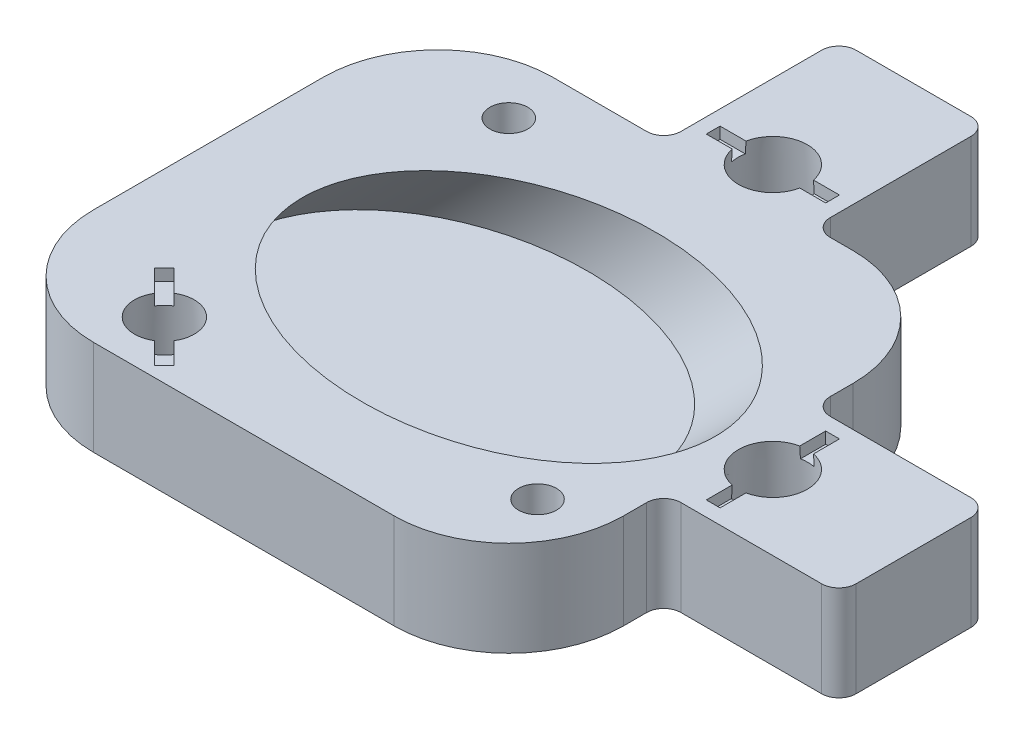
ISO-10303-21;
HEADER;
FILE_DESCRIPTION(('STEP AP214'),'2;1');
FILE_NAME('part.step','',(''),(''),'','','');
FILE_SCHEMA(('AUTOMOTIVE_DESIGN { 1 0 10303 214 1 1 1 1 }'));
ENDSEC;
DATA;
#1=APPLICATION_CONTEXT('core data for automotive mechanical design processes');
#2=APPLICATION_PROTOCOL_DEFINITION('international standard','automotive_design',2000,#1);
#3=PRODUCT_CONTEXT('',#1,'mechanical');
#4=PRODUCT('Part','Part','',(#3));
#5=PRODUCT_RELATED_PRODUCT_CATEGORY('part','',(#4));
#6=PRODUCT_DEFINITION_FORMATION('','',#4);
#7=PRODUCT_DEFINITION_CONTEXT('part definition',#1,'design');
#8=PRODUCT_DEFINITION('design','',#6,#7);
#9=PRODUCT_DEFINITION_SHAPE('','',#8);
#10=(LENGTH_UNIT() NAMED_UNIT(*) SI_UNIT(.MILLI.,.METRE.));
#11=(NAMED_UNIT(*) PLANE_ANGLE_UNIT() SI_UNIT($,.RADIAN.));
#12=(NAMED_UNIT(*) SI_UNIT($,.STERADIAN.) SOLID_ANGLE_UNIT());
#13=UNCERTAINTY_MEASURE_WITH_UNIT(LENGTH_MEASURE(1.E-05),#10,'distance_accuracy_value','');
#14=(GEOMETRIC_REPRESENTATION_CONTEXT(3) GLOBAL_UNCERTAINTY_ASSIGNED_CONTEXT((#13)) GLOBAL_UNIT_ASSIGNED_CONTEXT((#10,
#11,#12)) REPRESENTATION_CONTEXT('',''));
#15=CARTESIAN_POINT('',(0.,0.,0.));
#16=DIRECTION('',(0.,0.,1.));
#17=DIRECTION('',(1.,0.,0.));
#18=AXIS2_PLACEMENT_3D('',#15,#16,#17);
#19=CARTESIAN_POINT('',(-15.,8.3,-15.));
#20=DIRECTION('',(0.,-1.,0.));
#21=DIRECTION('',(0.,0.,-1.));
#22=AXIS2_PLACEMENT_3D('',#19,#20,#21);
#23=CYLINDRICAL_SURFACE('',#22,1.65);
#24=CARTESIAN_POINT('',(-15.,8.3,-15.));
#25=DIRECTION('',(0.,1.,0.));
#26=DIRECTION('',(0.,0.,1.));
#27=AXIS2_PLACEMENT_3D('',#24,#25,#26);
#28=CIRCLE('',#27,1.65);
#29=CARTESIAN_POINT('',(-15.,8.3,-16.65));
#30=VERTEX_POINT('',#29);
#31=EDGE_CURVE('E936',#30,#30,#28,.T.);
#32=CARTESIAN_POINT('',(-15.,3.9,-15.));
#33=DIRECTION('',(0.,-1.,0.));
#34=DIRECTION('',(0.,0.,-1.));
#35=AXIS2_PLACEMENT_3D('',#32,#33,#34);
#36=CIRCLE('',#35,1.65);
#37=CARTESIAN_POINT('',(-15.,3.9,-16.65));
#38=VERTEX_POINT('',#37);
#39=EDGE_CURVE('E694',#38,#38,#36,.T.);
#40=CARTESIAN_POINT('',(-15.,8.3,-16.65));
#41=CARTESIAN_POINT('',(-15.,8.25416666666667,-16.65));
#42=CARTESIAN_POINT('',(-15.,8.20833333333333,-16.65));
#43=CARTESIAN_POINT('',(-15.,8.11666666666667,-16.65));
#44=CARTESIAN_POINT('',(-15.,8.07083333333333,-16.65));
#45=CARTESIAN_POINT('',(-15.,7.97916666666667,-16.65));
#46=CARTESIAN_POINT('',(-15.,7.93333333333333,-16.65));
#47=CARTESIAN_POINT('',(-15.,7.84166666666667,-16.65));
#48=CARTESIAN_POINT('',(-15.,7.79583333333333,-16.65));
#49=CARTESIAN_POINT('',(-15.,7.70416666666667,-16.65));
#50=CARTESIAN_POINT('',(-15.,7.65833333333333,-16.65));
#51=CARTESIAN_POINT('',(-15.,7.56666666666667,-16.65));
#52=CARTESIAN_POINT('',(-15.,7.52083333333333,-16.65));
#53=CARTESIAN_POINT('',(-15.,7.42916666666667,-16.65));
#54=CARTESIAN_POINT('',(-15.,7.38333333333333,-16.65));
#55=CARTESIAN_POINT('',(-15.,7.29166666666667,-16.65));
#56=CARTESIAN_POINT('',(-15.,7.24583333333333,-16.65));
#57=CARTESIAN_POINT('',(-15.,7.15416666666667,-16.65));
#58=CARTESIAN_POINT('',(-15.,7.10833333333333,-16.65));
#59=CARTESIAN_POINT('',(-15.,7.01666666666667,-16.65));
#60=CARTESIAN_POINT('',(-15.,6.97083333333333,-16.65));
#61=CARTESIAN_POINT('',(-15.,6.87916666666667,-16.65));
#62=CARTESIAN_POINT('',(-15.,6.83333333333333,-16.65));
#63=CARTESIAN_POINT('',(-15.,6.74166666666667,-16.65));
#64=CARTESIAN_POINT('',(-15.,6.69583333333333,-16.65));
#65=CARTESIAN_POINT('',(-15.,6.60416666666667,-16.65));
#66=CARTESIAN_POINT('',(-15.,6.55833333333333,-16.65));
#67=CARTESIAN_POINT('',(-15.,6.46666666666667,-16.65));
#68=CARTESIAN_POINT('',(-15.,6.42083333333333,-16.65));
#69=CARTESIAN_POINT('',(-15.,6.32916666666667,-16.65));
#70=CARTESIAN_POINT('',(-15.,6.28333333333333,-16.65));
#71=CARTESIAN_POINT('',(-15.,6.19166666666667,-16.65));
#72=CARTESIAN_POINT('',(-15.,6.14583333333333,-16.65));
#73=CARTESIAN_POINT('',(-15.,6.05416666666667,-16.65));
#74=CARTESIAN_POINT('',(-15.,6.00833333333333,-16.65));
#75=CARTESIAN_POINT('',(-15.,5.91666666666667,-16.65));
#76=CARTESIAN_POINT('',(-15.,5.87083333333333,-16.65));
#77=CARTESIAN_POINT('',(-15.,5.77916666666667,-16.65));
#78=CARTESIAN_POINT('',(-15.,5.73333333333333,-16.65));
#79=CARTESIAN_POINT('',(-15.,5.64166666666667,-16.65));
#80=CARTESIAN_POINT('',(-15.,5.59583333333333,-16.65));
#81=CARTESIAN_POINT('',(-15.,5.50416666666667,-16.65));
#82=CARTESIAN_POINT('',(-15.,5.45833333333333,-16.65));
#83=CARTESIAN_POINT('',(-15.,5.36666666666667,-16.65));
#84=CARTESIAN_POINT('',(-15.,5.32083333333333,-16.65));
#85=CARTESIAN_POINT('',(-15.,5.22916666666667,-16.65));
#86=CARTESIAN_POINT('',(-15.,5.18333333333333,-16.65));
#87=CARTESIAN_POINT('',(-15.,5.09166666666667,-16.65));
#88=CARTESIAN_POINT('',(-15.,5.04583333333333,-16.65));
#89=CARTESIAN_POINT('',(-15.,4.95416666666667,-16.65));
#90=CARTESIAN_POINT('',(-15.,4.90833333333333,-16.65));
#91=CARTESIAN_POINT('',(-15.,4.81666666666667,-16.65));
#92=CARTESIAN_POINT('',(-15.,4.77083333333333,-16.65));
#93=CARTESIAN_POINT('',(-15.,4.67916666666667,-16.65));
#94=CARTESIAN_POINT('',(-15.,4.63333333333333,-16.65));
#95=CARTESIAN_POINT('',(-15.,4.54166666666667,-16.65));
#96=CARTESIAN_POINT('',(-15.,4.49583333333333,-16.65));
#97=CARTESIAN_POINT('',(-15.,4.40416666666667,-16.65));
#98=CARTESIAN_POINT('',(-15.,4.35833333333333,-16.65));
#99=CARTESIAN_POINT('',(-15.,4.26666666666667,-16.65));
#100=CARTESIAN_POINT('',(-15.,4.22083333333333,-16.65));
#101=CARTESIAN_POINT('',(-15.,4.12916666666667,-16.65));
#102=CARTESIAN_POINT('',(-15.,4.08333333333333,-16.65));
#103=CARTESIAN_POINT('',(-15.,3.99166666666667,-16.65));
#104=CARTESIAN_POINT('',(-15.,3.94583333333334,-16.65));
#105=CARTESIAN_POINT('',(-15.,3.9,-16.65));
#106=B_SPLINE_CURVE_WITH_KNOTS('',3,(#40,#41,#42,#43,#44,#45,#46,#47,#48,#49,#50,#51,#52,#53,
#54,#55,#56,#57,#58,#59,#60,#61,#62,#63,#64,#65,#66,#67,#68,#69,#70,#71,#72,#73,#74,#75,#76,#77,
#78,#79,#80,#81,#82,#83,#84,#85,#86,#87,#88,#89,#90,#91,#92,#93,#94,#95,#96,#97,#98,#99,#100,
#101,#102,#103,#104,#105),.UNSPECIFIED.,.F.,.F.,(4,2,2,2,2,2,2,2,2,2,2,2,2,2,2,2,2,2,2,2,2,2,2,
2,2,2,2,2,2,2,2,2,4),(0.,0.1375,0.275000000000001,0.412500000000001,0.55,0.687500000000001,
0.825,0.962500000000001,1.1,1.2375,1.375,1.5125,1.65,1.7875,1.925,2.0625,2.2,2.3375,2.475,
2.6125,2.75,2.8875,3.025,3.1625,3.3,3.4375,3.575,3.7125,3.85,3.9875,4.125,4.2625,4.4),.UNSPECIFIED.);
#107=EDGE_CURVE('BSEAM45',#30,#38,#106,.T.);
#108=ORIENTED_EDGE('',*,*,#31,.T.);
#109=ORIENTED_EDGE('',*,*,#39,.T.);
#110=ORIENTED_EDGE('',*,*,#107,.T.);
#111=ORIENTED_EDGE('',*,*,#107,.F.);
#112=EDGE_LOOP('',(#108,#110,#109,#111));
#113=FACE_BOUND('',#112,.T.);
#114=ADVANCED_FACE('F45',(#113),#23,.F.);
#115=CARTESIAN_POINT('',(15.,8.3,12.5));
#116=DIRECTION('',(0.,-1.,0.));
#117=DIRECTION('',(0.,0.,-1.));
#118=AXIS2_PLACEMENT_3D('',#115,#116,#117);
#119=CYLINDRICAL_SURFACE('',#118,1.65);
#120=CARTESIAN_POINT('',(15.,8.3,12.5));
#121=DIRECTION('',(0.,1.,0.));
#122=DIRECTION('',(0.,0.,1.));
#123=AXIS2_PLACEMENT_3D('',#120,#121,#122);
#124=CIRCLE('',#123,1.65);
#125=CARTESIAN_POINT('',(15.,8.3,10.85));
#126=VERTEX_POINT('',#125);
#127=EDGE_CURVE('E733',#126,#126,#124,.T.);
#128=CARTESIAN_POINT('',(15.,3.9,12.5));
#129=DIRECTION('',(0.,-1.,0.));
#130=DIRECTION('',(0.,0.,-1.));
#131=AXIS2_PLACEMENT_3D('',#128,#129,#130);
#132=CIRCLE('',#131,1.65);
#133=CARTESIAN_POINT('',(15.,3.9,10.85));
#134=VERTEX_POINT('',#133);
#135=EDGE_CURVE('E551',#134,#134,#132,.T.);
#136=CARTESIAN_POINT('',(15.,8.3,10.85));
#137=CARTESIAN_POINT('',(15.,8.25416666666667,10.85));
#138=CARTESIAN_POINT('',(15.,8.20833333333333,10.85));
#139=CARTESIAN_POINT('',(15.,8.11666666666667,10.85));
#140=CARTESIAN_POINT('',(15.,8.07083333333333,10.85));
#141=CARTESIAN_POINT('',(15.,7.97916666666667,10.85));
#142=CARTESIAN_POINT('',(15.,7.93333333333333,10.85));
#143=CARTESIAN_POINT('',(15.,7.84166666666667,10.85));
#144=CARTESIAN_POINT('',(15.,7.79583333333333,10.85));
#145=CARTESIAN_POINT('',(15.,7.70416666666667,10.85));
#146=CARTESIAN_POINT('',(15.,7.65833333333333,10.85));
#147=CARTESIAN_POINT('',(15.,7.56666666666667,10.85));
#148=CARTESIAN_POINT('',(15.,7.52083333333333,10.85));
#149=CARTESIAN_POINT('',(15.,7.42916666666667,10.85));
#150=CARTESIAN_POINT('',(15.,7.38333333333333,10.85));
#151=CARTESIAN_POINT('',(15.,7.29166666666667,10.85));
#152=CARTESIAN_POINT('',(15.,7.24583333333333,10.85));
#153=CARTESIAN_POINT('',(15.,7.15416666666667,10.85));
#154=CARTESIAN_POINT('',(15.,7.10833333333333,10.85));
#155=CARTESIAN_POINT('',(15.,7.01666666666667,10.85));
#156=CARTESIAN_POINT('',(15.,6.97083333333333,10.85));
#157=CARTESIAN_POINT('',(15.,6.87916666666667,10.85));
#158=CARTESIAN_POINT('',(15.,6.83333333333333,10.85));
#159=CARTESIAN_POINT('',(15.,6.74166666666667,10.85));
#160=CARTESIAN_POINT('',(15.,6.69583333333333,10.85));
#161=CARTESIAN_POINT('',(15.,6.60416666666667,10.85));
#162=CARTESIAN_POINT('',(15.,6.55833333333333,10.85));
#163=CARTESIAN_POINT('',(15.,6.46666666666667,10.85));
#164=CARTESIAN_POINT('',(15.,6.42083333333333,10.85));
#165=CARTESIAN_POINT('',(15.,6.32916666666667,10.85));
#166=CARTESIAN_POINT('',(15.,6.28333333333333,10.85));
#167=CARTESIAN_POINT('',(15.,6.19166666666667,10.85));
#168=CARTESIAN_POINT('',(15.,6.14583333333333,10.85));
#169=CARTESIAN_POINT('',(15.,6.05416666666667,10.85));
#170=CARTESIAN_POINT('',(15.,6.00833333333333,10.85));
#171=CARTESIAN_POINT('',(15.,5.91666666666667,10.85));
#172=CARTESIAN_POINT('',(15.,5.87083333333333,10.85));
#173=CARTESIAN_POINT('',(15.,5.77916666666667,10.85));
#174=CARTESIAN_POINT('',(15.,5.73333333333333,10.85));
#175=CARTESIAN_POINT('',(15.,5.64166666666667,10.85));
#176=CARTESIAN_POINT('',(15.,5.59583333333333,10.85));
#177=CARTESIAN_POINT('',(15.,5.50416666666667,10.85));
#178=CARTESIAN_POINT('',(15.,5.45833333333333,10.85));
#179=CARTESIAN_POINT('',(15.,5.36666666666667,10.85));
#180=CARTESIAN_POINT('',(15.,5.32083333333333,10.85));
#181=CARTESIAN_POINT('',(15.,5.22916666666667,10.85));
#182=CARTESIAN_POINT('',(15.,5.18333333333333,10.85));
#183=CARTESIAN_POINT('',(15.,5.09166666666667,10.85));
#184=CARTESIAN_POINT('',(15.,5.04583333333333,10.85));
#185=CARTESIAN_POINT('',(15.,4.95416666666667,10.85));
#186=CARTESIAN_POINT('',(15.,4.90833333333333,10.85));
#187=CARTESIAN_POINT('',(15.,4.81666666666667,10.85));
#188=CARTESIAN_POINT('',(15.,4.77083333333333,10.85));
#189=CARTESIAN_POINT('',(15.,4.67916666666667,10.85));
#190=CARTESIAN_POINT('',(15.,4.63333333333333,10.85));
#191=CARTESIAN_POINT('',(15.,4.54166666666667,10.85));
#192=CARTESIAN_POINT('',(15.,4.49583333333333,10.85));
#193=CARTESIAN_POINT('',(15.,4.40416666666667,10.85));
#194=CARTESIAN_POINT('',(15.,4.35833333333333,10.85));
#195=CARTESIAN_POINT('',(15.,4.26666666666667,10.85));
#196=CARTESIAN_POINT('',(15.,4.22083333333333,10.85));
#197=CARTESIAN_POINT('',(15.,4.12916666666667,10.85));
#198=CARTESIAN_POINT('',(15.,4.08333333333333,10.85));
#199=CARTESIAN_POINT('',(15.,3.99166666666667,10.85));
#200=CARTESIAN_POINT('',(15.,3.94583333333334,10.85));
#201=CARTESIAN_POINT('',(15.,3.9,10.85));
#202=B_SPLINE_CURVE_WITH_KNOTS('',3,(#136,#137,#138,#139,#140,#141,#142,#143,#144,#145,#146,
#147,#148,#149,#150,#151,#152,#153,#154,#155,#156,#157,#158,#159,#160,#161,#162,#163,#164,#165,
#166,#167,#168,#169,#170,#171,#172,#173,#174,#175,#176,#177,#178,#179,#180,#181,#182,#183,#184,
#185,#186,#187,#188,#189,#190,#191,#192,#193,#194,#195,#196,#197,#198,#199,#200,#201),
.UNSPECIFIED.,.F.,.F.,(4,2,2,2,2,2,2,2,2,2,2,2,2,2,2,2,2,2,2,2,2,2,2,2,2,2,2,2,2,2,2,2,4),(0.,
0.1375,0.275000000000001,0.412500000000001,0.55,0.687500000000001,0.825,0.962500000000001,1.1,
1.2375,1.375,1.5125,1.65,1.7875,1.925,2.0625,2.2,2.3375,2.475,2.6125,2.75,2.8875,3.025,3.1625,
3.3,3.4375,3.575,3.7125,3.85,3.9875,4.125,4.2625,4.4),.UNSPECIFIED.);
#203=EDGE_CURVE('BSEAM745',#126,#134,#202,.T.);
#204=ORIENTED_EDGE('',*,*,#127,.T.);
#205=ORIENTED_EDGE('',*,*,#135,.T.);
#206=ORIENTED_EDGE('',*,*,#203,.T.);
#207=ORIENTED_EDGE('',*,*,#203,.F.);
#208=EDGE_LOOP('',(#204,#206,#205,#207));
#209=FACE_BOUND('',#208,.T.);
#210=ADVANCED_FACE('F745',(#209),#119,.F.);
#211=CARTESIAN_POINT('',(0.,8.3,0.));
#212=DIRECTION('',(0.,1.,0.));
#213=DIRECTION('',(0.,0.,1.));
#214=AXIS2_PLACEMENT_3D('',#211,#212,#213);
#215=PLANE('',#214);
#216=DIRECTION('',(0.,0.,1.));
#217=VECTOR('',#216,1.);
#218=CARTESIAN_POINT('',(22.4,8.3,5.2));
#219=LINE('',#218,#217);
#220=CARTESIAN_POINT('',(22.4,8.3,-5.2));
#221=VERTEX_POINT('',#220);
#222=CARTESIAN_POINT('',(22.4,8.3,-2.93938769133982));
#223=VERTEX_POINT('',#222);
#224=EDGE_CURVE('E622',#221,#223,#219,.T.);
#225=ORIENTED_EDGE('',*,*,#224,.F.);
#226=DIRECTION('',(-1.,0.,0.));
#227=VECTOR('',#226,1.);
#228=CARTESIAN_POINT('',(22.4,8.3,-5.2));
#229=LINE('',#228,#227);
#230=CARTESIAN_POINT('',(23.6,8.3,-5.2));
#231=VERTEX_POINT('',#230);
#232=EDGE_CURVE('E632',#231,#221,#229,.T.);
#233=ORIENTED_EDGE('',*,*,#232,.F.);
#234=DIRECTION('',(0.,0.,-1.));
#235=VECTOR('',#234,1.);
#236=CARTESIAN_POINT('',(23.6,8.3,-5.2));
#237=LINE('',#236,#235);
#238=CARTESIAN_POINT('',(23.6,8.3,-2.93938769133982));
#239=VERTEX_POINT('',#238);
#240=EDGE_CURVE('E628',#239,#231,#237,.T.);
#241=ORIENTED_EDGE('',*,*,#240,.F.);
#242=CARTESIAN_POINT('',(23.,8.3,0.));
#243=DIRECTION('',(0.,1.,0.));
#244=DIRECTION('',(0.,0.,1.));
#245=AXIS2_PLACEMENT_3D('',#242,#243,#244);
#246=CIRCLE('',#245,3.);
#247=CARTESIAN_POINT('',(23.6,8.3,2.93938769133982));
#248=VERTEX_POINT('',#247);
#249=EDGE_CURVE('E1114',#248,#239,#246,.T.);
#250=ORIENTED_EDGE('',*,*,#249,.F.);
#251=CARTESIAN_POINT('',(23.6,8.3,5.2));
#252=VERTEX_POINT('',#251);
#253=EDGE_CURVE('E629',#252,#248,#237,.T.);
#254=ORIENTED_EDGE('',*,*,#253,.F.);
#255=DIRECTION('',(1.,0.,0.));
#256=VECTOR('',#255,1.);
#257=CARTESIAN_POINT('',(23.6,8.3,5.2));
#258=LINE('',#257,#256);
#259=CARTESIAN_POINT('',(22.4,8.3,5.2));
#260=VERTEX_POINT('',#259);
#261=EDGE_CURVE('E624',#260,#252,#258,.T.);
#262=ORIENTED_EDGE('',*,*,#261,.F.);
#263=CARTESIAN_POINT('',(22.4,8.3,2.93938769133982));
#264=VERTEX_POINT('',#263);
#265=EDGE_CURVE('E625',#264,#260,#219,.T.);
#266=ORIENTED_EDGE('',*,*,#265,.F.);
#267=EDGE_CURVE('E1117',#223,#264,#246,.T.);
#268=ORIENTED_EDGE('',*,*,#267,.F.);
#269=EDGE_LOOP('',(#225,#233,#241,#250,#254,#262,#266,#268));
#270=FACE_BOUND('',#269,.T.);
#271=DIRECTION('',(-1.,0.,0.));
#272=VECTOR('',#271,1.);
#273=CARTESIAN_POINT('',(-5.2,8.3,-23.6));
#274=LINE('',#273,#272);
#275=CARTESIAN_POINT('',(-2.93938769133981,8.3,-23.6));
#276=VERTEX_POINT('',#275);
#277=CARTESIAN_POINT('',(-5.2,8.3,-23.6));
#278=VERTEX_POINT('',#277);
#279=EDGE_CURVE('E660',#276,#278,#274,.T.);
#280=ORIENTED_EDGE('',*,*,#279,.F.);
#281=CARTESIAN_POINT('',(0.,8.3,-23.));
#282=DIRECTION('',(0.,1.,0.));
#283=DIRECTION('',(0.,0.,1.));
#284=AXIS2_PLACEMENT_3D('',#281,#282,#283);
#285=CIRCLE('',#284,3.);
#286=CARTESIAN_POINT('',(2.93938769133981,8.3,-23.6));
#287=VERTEX_POINT('',#286);
#288=EDGE_CURVE('E1110',#287,#276,#285,.T.);
#289=ORIENTED_EDGE('',*,*,#288,.F.);
#290=CARTESIAN_POINT('',(5.2,8.3,-23.6));
#291=VERTEX_POINT('',#290);
#292=EDGE_CURVE('E657',#291,#287,#274,.T.);
#293=ORIENTED_EDGE('',*,*,#292,.F.);
#294=DIRECTION('',(0.,0.,-1.));
#295=VECTOR('',#294,1.);
#296=CARTESIAN_POINT('',(5.2,8.3,-23.6));
#297=LINE('',#296,#295);
#298=CARTESIAN_POINT('',(5.2,8.3,-22.4));
#299=VERTEX_POINT('',#298);
#300=EDGE_CURVE('E659',#299,#291,#297,.T.);
#301=ORIENTED_EDGE('',*,*,#300,.F.);
#302=DIRECTION('',(1.,0.,0.));
#303=VECTOR('',#302,1.);
#304=CARTESIAN_POINT('',(5.2,8.3,-22.4));
#305=LINE('',#304,#303);
#306=CARTESIAN_POINT('',(2.93938769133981,8.3,-22.4));
#307=VERTEX_POINT('',#306);
#308=EDGE_CURVE('E663',#307,#299,#305,.T.);
#309=ORIENTED_EDGE('',*,*,#308,.F.);
#310=CARTESIAN_POINT('',(-2.93938769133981,8.3,-22.4));
#311=VERTEX_POINT('',#310);
#312=EDGE_CURVE('E1106',#311,#307,#285,.T.);
#313=ORIENTED_EDGE('',*,*,#312,.F.);
#314=CARTESIAN_POINT('',(-5.2,8.3,-22.4));
#315=VERTEX_POINT('',#314);
#316=EDGE_CURVE('E664',#315,#311,#305,.T.);
#317=ORIENTED_EDGE('',*,*,#316,.F.);
#318=DIRECTION('',(0.,0.,1.));
#319=VECTOR('',#318,1.);
#320=CARTESIAN_POINT('',(-5.2,8.3,-22.4));
#321=LINE('',#320,#319);
#322=EDGE_CURVE('E667',#278,#315,#321,.T.);
#323=ORIENTED_EDGE('',*,*,#322,.F.);
#324=EDGE_LOOP('',(#280,#289,#293,#301,#309,#313,#317,#323));
#325=FACE_BOUND('',#324,.T.);
#326=DIRECTION('',(-0.707106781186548,0.,-0.707106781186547));
#327=VECTOR('',#326,1.);
#328=CARTESIAN_POINT('',(-18.2526911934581,8.3,10.898780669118));
#329=LINE('',#328,#327);
#330=CARTESIAN_POINT('',(-16.3645903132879,8.3,12.7868815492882));
#331=VERTEX_POINT('',#330);
#332=CARTESIAN_POINT('',(-18.2526911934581,8.3,10.898780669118));
#333=VERTEX_POINT('',#332);
#334=EDGE_CURVE('E698',#331,#333,#329,.T.);
#335=ORIENTED_EDGE('',*,*,#334,.F.);
#336=CARTESIAN_POINT('',(-15.,8.3,15.));
#337=DIRECTION('',(0.,1.,0.));
#338=DIRECTION('',(0.,0.,1.));
#339=AXIS2_PLACEMENT_3D('',#336,#337,#338);
#340=CIRCLE('',#339,2.6);
#341=CARTESIAN_POINT('',(-12.7868815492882,8.3,16.3645903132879));
#342=VERTEX_POINT('',#341);
#343=EDGE_CURVE('E1101',#342,#331,#340,.T.);
#344=ORIENTED_EDGE('',*,*,#343,.F.);
#345=CARTESIAN_POINT('',(-10.898780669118,8.3,18.2526911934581));
#346=VERTEX_POINT('',#345);
#347=EDGE_CURVE('E695',#346,#342,#329,.T.);
#348=ORIENTED_EDGE('',*,*,#347,.F.);
#349=DIRECTION('',(0.707106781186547,0.,-0.707106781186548));
#350=VECTOR('',#349,1.);
#351=CARTESIAN_POINT('',(-10.898780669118,8.3,18.2526911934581));
#352=LINE('',#351,#350);
#353=CARTESIAN_POINT('',(-11.7473088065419,8.3,19.101219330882));
#354=VERTEX_POINT('',#353);
#355=EDGE_CURVE('E697',#354,#346,#352,.T.);
#356=ORIENTED_EDGE('',*,*,#355,.F.);
#357=DIRECTION('',(0.707106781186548,0.,0.707106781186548));
#358=VECTOR('',#357,1.);
#359=CARTESIAN_POINT('',(-11.7473088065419,8.3,19.101219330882));
#360=LINE('',#359,#358);
#361=CARTESIAN_POINT('',(-13.6354096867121,8.3,17.2131184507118));
#362=VERTEX_POINT('',#361);
#363=EDGE_CURVE('E701',#362,#354,#360,.T.);
#364=ORIENTED_EDGE('',*,*,#363,.F.);
#365=CARTESIAN_POINT('',(-17.2131184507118,8.3,13.6354096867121));
#366=VERTEX_POINT('',#365);
#367=EDGE_CURVE('E1107',#366,#362,#340,.T.);
#368=ORIENTED_EDGE('',*,*,#367,.F.);
#369=CARTESIAN_POINT('',(-19.101219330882,8.3,11.7473088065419));
#370=VERTEX_POINT('',#369);
#371=EDGE_CURVE('E702',#370,#366,#360,.T.);
#372=ORIENTED_EDGE('',*,*,#371,.F.);
#373=DIRECTION('',(-0.707106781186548,0.,0.707106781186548));
#374=VECTOR('',#373,1.);
#375=CARTESIAN_POINT('',(-19.101219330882,8.3,11.7473088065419));
#376=LINE('',#375,#374);
#377=EDGE_CURVE('E656',#333,#370,#376,.T.);
#378=ORIENTED_EDGE('',*,*,#377,.F.);
#379=EDGE_LOOP('',(#335,#344,#348,#356,#364,#368,#372,#378));
#380=FACE_BOUND('',#379,.T.);
#381=CARTESIAN_POINT('',(0.,8.3,0.));
#382=DIRECTION('',(0.,1.,0.));
#383=DIRECTION('',(-1.,0.,0.));
#384=AXIS2_PLACEMENT_3D('',#381,#382,#383);
#385=ELLIPSE('',#384,18.,12.8);
#386=CARTESIAN_POINT('',(-18.,8.3,0.));
#387=VERTEX_POINT('',#386);
#388=EDGE_CURVE('E722',#387,#387,#385,.T.);
#389=ORIENTED_EDGE('',*,*,#388,.F.);
#390=EDGE_LOOP('',(#389));
#391=FACE_BOUND('',#390,.T.);
#392=DIRECTION('',(1.,0.,0.));
#393=VECTOR('',#392,1.);
#394=CARTESIAN_POINT('',(-26.17,8.3,20.));
#395=LINE('',#394,#393);
#396=CARTESIAN_POINT('',(-16.17,8.3,20.));
#397=VERTEX_POINT('',#396);
#398=CARTESIAN_POINT('',(10.,8.3,20.));
#399=VERTEX_POINT('',#398);
#400=EDGE_CURVE('E965',#397,#399,#395,.T.);
#401=ORIENTED_EDGE('',*,*,#400,.T.);
#402=CARTESIAN_POINT('',(10.,8.3,10.));
#403=DIRECTION('',(0.,1.,0.));
#404=DIRECTION('',(0.,0.,1.));
#405=AXIS2_PLACEMENT_3D('',#402,#403,#404);
#406=CIRCLE('',#405,10.);
#407=CARTESIAN_POINT('',(20.,8.3,10.));
#408=VERTEX_POINT('',#407);
#409=EDGE_CURVE('E1060',#399,#408,#406,.T.);
#410=ORIENTED_EDGE('',*,*,#409,.T.);
#411=DIRECTION('',(0.,0.,-1.));
#412=VECTOR('',#411,1.);
#413=CARTESIAN_POINT('',(20.,8.3,20.));
#414=LINE('',#413,#412);
#415=CARTESIAN_POINT('',(20.,8.3,8.));
#416=VERTEX_POINT('',#415);
#417=EDGE_CURVE('E1122',#408,#416,#414,.T.);
#418=ORIENTED_EDGE('',*,*,#417,.T.);
#419=CARTESIAN_POINT('',(21.5,8.3,8.));
#420=DIRECTION('',(0.,1.,0.));
#421=DIRECTION('',(0.,0.,1.));
#422=AXIS2_PLACEMENT_3D('',#419,#420,#421);
#423=CIRCLE('',#422,1.5);
#424=CARTESIAN_POINT('',(21.5,8.3,6.5));
#425=VERTEX_POINT('',#424);
#426=EDGE_CURVE('E1038',#416,#425,#423,.F.);
#427=ORIENTED_EDGE('',*,*,#426,.T.);
#428=DIRECTION('',(1.,0.,0.));
#429=VECTOR('',#428,1.);
#430=CARTESIAN_POINT('',(20.,8.3,6.5));
#431=LINE('',#430,#429);
#432=CARTESIAN_POINT('',(33.75,8.3,6.5));
#433=VERTEX_POINT('',#432);
#434=EDGE_CURVE('E1124',#425,#433,#431,.T.);
#435=ORIENTED_EDGE('',*,*,#434,.T.);
#436=CARTESIAN_POINT('',(33.75,8.3,5.));
#437=DIRECTION('',(0.,1.,0.));
#438=DIRECTION('',(0.,0.,1.));
#439=AXIS2_PLACEMENT_3D('',#436,#437,#438);
#440=CIRCLE('',#439,1.5);
#441=CARTESIAN_POINT('',(35.25,8.3,5.));
#442=VERTEX_POINT('',#441);
#443=EDGE_CURVE('E988',#433,#442,#440,.T.);
#444=ORIENTED_EDGE('',*,*,#443,.T.);
#445=DIRECTION('',(0.,0.,-1.));
#446=VECTOR('',#445,1.);
#447=CARTESIAN_POINT('',(35.25,8.3,6.5));
#448=LINE('',#447,#446);
#449=CARTESIAN_POINT('',(35.25,8.3,-5.));
#450=VERTEX_POINT('',#449);
#451=EDGE_CURVE('E1127',#442,#450,#448,.T.);
#452=ORIENTED_EDGE('',*,*,#451,.T.);
#453=CARTESIAN_POINT('',(33.75,8.3,-5.));
#454=DIRECTION('',(0.,1.,0.));
#455=DIRECTION('',(0.,0.,1.));
#456=AXIS2_PLACEMENT_3D('',#453,#454,#455);
#457=CIRCLE('',#456,1.5);
#458=CARTESIAN_POINT('',(33.75,8.3,-6.5));
#459=VERTEX_POINT('',#458);
#460=EDGE_CURVE('E990',#450,#459,#457,.T.);
#461=ORIENTED_EDGE('',*,*,#460,.T.);
#462=DIRECTION('',(-1.,0.,0.));
#463=VECTOR('',#462,1.);
#464=CARTESIAN_POINT('',(35.25,8.3,-6.5));
#465=LINE('',#464,#463);
#466=CARTESIAN_POINT('',(21.5,8.3,-6.5));
#467=VERTEX_POINT('',#466);
#468=EDGE_CURVE('E1130',#459,#467,#465,.T.);
#469=ORIENTED_EDGE('',*,*,#468,.T.);
#470=CARTESIAN_POINT('',(21.5,8.3,-8.));
#471=DIRECTION('',(0.,1.,0.));
#472=DIRECTION('',(0.,0.,1.));
#473=AXIS2_PLACEMENT_3D('',#470,#471,#472);
#474=CIRCLE('',#473,1.5);
#475=CARTESIAN_POINT('',(20.,8.3,-8.));
#476=VERTEX_POINT('',#475);
#477=EDGE_CURVE('E1035',#467,#476,#474,.F.);
#478=ORIENTED_EDGE('',*,*,#477,.T.);
#479=DIRECTION('',(0.,0.,-1.));
#480=VECTOR('',#479,1.);
#481=CARTESIAN_POINT('',(20.,8.3,-6.5));
#482=LINE('',#481,#480);
#483=CARTESIAN_POINT('',(20.,8.3,-10.));
#484=VERTEX_POINT('',#483);
#485=EDGE_CURVE('E1133',#476,#484,#482,.T.);
#486=ORIENTED_EDGE('',*,*,#485,.T.);
#487=CARTESIAN_POINT('',(10.,8.3,-10.));
#488=DIRECTION('',(0.,1.,0.));
#489=DIRECTION('',(0.,0.,1.));
#490=AXIS2_PLACEMENT_3D('',#487,#488,#489);
#491=CIRCLE('',#490,10.);
#492=CARTESIAN_POINT('',(10.,8.3,-20.));
#493=VERTEX_POINT('',#492);
#494=EDGE_CURVE('E1056',#484,#493,#491,.T.);
#495=ORIENTED_EDGE('',*,*,#494,.T.);
#496=DIRECTION('',(-1.,0.,0.));
#497=VECTOR('',#496,1.);
#498=CARTESIAN_POINT('',(20.,8.3,-20.));
#499=LINE('',#498,#497);
#500=CARTESIAN_POINT('',(8.,8.3,-20.));
#501=VERTEX_POINT('',#500);
#502=EDGE_CURVE('E1136',#493,#501,#499,.T.);
#503=ORIENTED_EDGE('',*,*,#502,.T.);
#504=CARTESIAN_POINT('',(8.,8.3,-21.5));
#505=DIRECTION('',(0.,1.,0.));
#506=DIRECTION('',(0.,0.,1.));
#507=AXIS2_PLACEMENT_3D('',#504,#505,#506);
#508=CIRCLE('',#507,1.5);
#509=CARTESIAN_POINT('',(6.5,8.3,-21.5));
#510=VERTEX_POINT('',#509);
#511=EDGE_CURVE('E1031',#501,#510,#508,.F.);
#512=ORIENTED_EDGE('',*,*,#511,.T.);
#513=DIRECTION('',(0.,0.,-1.));
#514=VECTOR('',#513,1.);
#515=CARTESIAN_POINT('',(6.5,8.3,-20.));
#516=LINE('',#515,#514);
#517=CARTESIAN_POINT('',(6.5,8.3,-33.75));
#518=VERTEX_POINT('',#517);
#519=EDGE_CURVE('E1138',#510,#518,#516,.T.);
#520=ORIENTED_EDGE('',*,*,#519,.T.);
#521=CARTESIAN_POINT('',(5.,8.3,-33.75));
#522=DIRECTION('',(0.,1.,0.));
#523=DIRECTION('',(0.,0.,1.));
#524=AXIS2_PLACEMENT_3D('',#521,#522,#523);
#525=CIRCLE('',#524,1.5);
#526=CARTESIAN_POINT('',(5.,8.3,-35.25));
#527=VERTEX_POINT('',#526);
#528=EDGE_CURVE('E992',#518,#527,#525,.T.);
#529=ORIENTED_EDGE('',*,*,#528,.T.);
#530=DIRECTION('',(-1.,0.,0.));
#531=VECTOR('',#530,1.);
#532=CARTESIAN_POINT('',(6.5,8.3,-35.25));
#533=LINE('',#532,#531);
#534=CARTESIAN_POINT('',(-5.,8.3,-35.25));
#535=VERTEX_POINT('',#534);
#536=EDGE_CURVE('E1141',#527,#535,#533,.T.);
#537=ORIENTED_EDGE('',*,*,#536,.T.);
#538=CARTESIAN_POINT('',(-5.,8.3,-33.75));
#539=DIRECTION('',(0.,1.,0.));
#540=DIRECTION('',(0.,0.,1.));
#541=AXIS2_PLACEMENT_3D('',#538,#539,#540);
#542=CIRCLE('',#541,1.5);
#543=CARTESIAN_POINT('',(-6.5,8.3,-33.75));
#544=VERTEX_POINT('',#543);
#545=EDGE_CURVE('E994',#535,#544,#542,.T.);
#546=ORIENTED_EDGE('',*,*,#545,.T.);
#547=DIRECTION('',(0.,0.,1.));
#548=VECTOR('',#547,1.);
#549=CARTESIAN_POINT('',(-6.5,8.3,-35.25));
#550=LINE('',#549,#548);
#551=CARTESIAN_POINT('',(-6.5,8.3,-21.5));
#552=VERTEX_POINT('',#551);
#553=EDGE_CURVE('E1144',#544,#552,#550,.T.);
#554=ORIENTED_EDGE('',*,*,#553,.T.);
#555=CARTESIAN_POINT('',(-8.,8.3,-21.5));
#556=DIRECTION('',(0.,1.,0.));
#557=DIRECTION('',(0.,0.,1.));
#558=AXIS2_PLACEMENT_3D('',#555,#556,#557);
#559=CIRCLE('',#558,1.5);
#560=CARTESIAN_POINT('',(-8.,8.3,-20.));
#561=VERTEX_POINT('',#560);
#562=EDGE_CURVE('E1026',#552,#561,#559,.F.);
#563=ORIENTED_EDGE('',*,*,#562,.T.);
#564=DIRECTION('',(-1.,0.,0.));
#565=VECTOR('',#564,1.);
#566=CARTESIAN_POINT('',(-6.5,8.3,-20.));
#567=LINE('',#566,#565);
#568=CARTESIAN_POINT('',(-16.17,8.3,-20.));
#569=VERTEX_POINT('',#568);
#570=EDGE_CURVE('E1147',#561,#569,#567,.T.);
#571=ORIENTED_EDGE('',*,*,#570,.T.);
#572=CARTESIAN_POINT('',(-16.17,8.3,-10.));
#573=DIRECTION('',(0.,1.,0.));
#574=DIRECTION('',(0.,0.,1.));
#575=AXIS2_PLACEMENT_3D('',#572,#573,#574);
#576=CIRCLE('',#575,10.);
#577=CARTESIAN_POINT('',(-26.17,8.3,-10.));
#578=VERTEX_POINT('',#577);
#579=EDGE_CURVE('E1054',#569,#578,#576,.T.);
#580=ORIENTED_EDGE('',*,*,#579,.T.);
#581=DIRECTION('',(0.,0.,1.));
#582=VECTOR('',#581,1.);
#583=CARTESIAN_POINT('',(-26.17,8.3,-20.));
#584=LINE('',#583,#582);
#585=CARTESIAN_POINT('',(-26.17,8.3,10.));
#586=VERTEX_POINT('',#585);
#587=EDGE_CURVE('E970',#578,#586,#584,.T.);
#588=ORIENTED_EDGE('',*,*,#587,.T.);
#589=CARTESIAN_POINT('',(-16.17,8.3,10.));
#590=DIRECTION('',(0.,1.,0.));
#591=DIRECTION('',(0.,0.,1.));
#592=AXIS2_PLACEMENT_3D('',#589,#590,#591);
#593=CIRCLE('',#592,10.);
#594=EDGE_CURVE('E1058',#586,#397,#593,.T.);
#595=ORIENTED_EDGE('',*,*,#594,.T.);
#596=EDGE_LOOP('',(#401,#410,#418,#427,#435,#444,#452,#461,#469,#478,#486,#495,#503,#512,#520,
#529,#537,#546,#554,#563,#571,#580,#588,#595));
#597=FACE_BOUND('',#596,.T.);
#598=ORIENTED_EDGE('',*,*,#31,.F.);
#599=EDGE_LOOP('',(#598));
#600=FACE_BOUND('',#599,.T.);
#601=ORIENTED_EDGE('',*,*,#127,.F.);
#602=EDGE_LOOP('',(#601));
#603=FACE_BOUND('',#602,.T.);
#604=ADVANCED_FACE('F748',(#270,#325,#380,#391,#597,#600,#603),#215,.T.);
#605=CARTESIAN_POINT('',(0.,0.,0.));
#606=DIRECTION('',(0.,1.,0.));
#607=DIRECTION('',(0.,0.,1.));
#608=AXIS2_PLACEMENT_3D('',#605,#606,#607);
#609=PLANE('',#608);
#610=DIRECTION('',(0.,0.,1.));
#611=VECTOR('',#610,1.);
#612=CARTESIAN_POINT('',(34.25,0.,0.6));
#613=LINE('',#612,#611);
#614=CARTESIAN_POINT('',(34.25,0.,-0.8));
#615=VERTEX_POINT('',#614);
#616=CARTESIAN_POINT('',(34.25,0.,0.8));
#617=VERTEX_POINT('',#616);
#618=EDGE_CURVE('E1409',#615,#617,#613,.T.);
#619=ORIENTED_EDGE('',*,*,#618,.F.);
#620=DIRECTION('',(1.,0.,0.));
#621=VECTOR('',#620,1.);
#622=CARTESIAN_POINT('',(0.,0.,-0.800000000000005));
#623=LINE('',#622,#621);
#624=CARTESIAN_POINT('',(27.25,0.,-0.800000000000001));
#625=VERTEX_POINT('',#624);
#626=EDGE_CURVE('E1327',#615,#625,#623,.F.);
#627=ORIENTED_EDGE('',*,*,#626,.T.);
#628=DIRECTION('',(0.,0.,-1.));
#629=VECTOR('',#628,1.);
#630=CARTESIAN_POINT('',(27.25,0.,-0.600000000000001));
#631=LINE('',#630,#629);
#632=CARTESIAN_POINT('',(27.25,0.,0.800000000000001));
#633=VERTEX_POINT('',#632);
#634=EDGE_CURVE('E1412',#633,#625,#631,.T.);
#635=ORIENTED_EDGE('',*,*,#634,.F.);
#636=DIRECTION('',(-1.,0.,0.));
#637=VECTOR('',#636,1.);
#638=CARTESIAN_POINT('',(0.,0.,0.800000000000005));
#639=LINE('',#638,#637);
#640=EDGE_CURVE('E1322',#633,#617,#639,.F.);
#641=ORIENTED_EDGE('',*,*,#640,.T.);
#642=EDGE_LOOP('',(#619,#627,#635,#641));
#643=FACE_BOUND('',#642,.T.);
#644=DIRECTION('',(1.,0.,0.));
#645=VECTOR('',#644,1.);
#646=CARTESIAN_POINT('',(0.600000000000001,0.,-34.25));
#647=LINE('',#646,#645);
#648=CARTESIAN_POINT('',(-0.800000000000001,0.,-34.25));
#649=VERTEX_POINT('',#648);
#650=CARTESIAN_POINT('',(0.800000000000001,0.,-34.25));
#651=VERTEX_POINT('',#650);
#652=EDGE_CURVE('E1414',#649,#651,#647,.T.);
#653=ORIENTED_EDGE('',*,*,#652,.F.);
#654=DIRECTION('',(0.,0.,-1.));
#655=VECTOR('',#654,1.);
#656=CARTESIAN_POINT('',(-0.800000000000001,0.,0.));
#657=LINE('',#656,#655);
#658=CARTESIAN_POINT('',(-0.800000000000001,0.,-27.25));
#659=VERTEX_POINT('',#658);
#660=EDGE_CURVE('E1333',#649,#659,#657,.F.);
#661=ORIENTED_EDGE('',*,*,#660,.T.);
#662=DIRECTION('',(-1.,0.,0.));
#663=VECTOR('',#662,1.);
#664=CARTESIAN_POINT('',(-0.600000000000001,0.,-27.25));
#665=LINE('',#664,#663);
#666=CARTESIAN_POINT('',(0.800000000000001,0.,-27.25));
#667=VERTEX_POINT('',#666);
#668=EDGE_CURVE('E1416',#667,#659,#665,.T.);
#669=ORIENTED_EDGE('',*,*,#668,.F.);
#670=DIRECTION('',(0.,0.,1.));
#671=VECTOR('',#670,1.);
#672=CARTESIAN_POINT('',(0.800000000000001,0.,0.));
#673=LINE('',#672,#671);
#674=EDGE_CURVE('E1330',#667,#651,#673,.F.);
#675=ORIENTED_EDGE('',*,*,#674,.T.);
#676=EDGE_LOOP('',(#653,#661,#669,#675));
#677=FACE_BOUND('',#676,.T.);
#678=CARTESIAN_POINT('',(-15.,0.,15.));
#679=DIRECTION('',(0.,1.,0.));
#680=DIRECTION('',(0.,0.,1.));
#681=AXIS2_PLACEMENT_3D('',#678,#679,#680);
#682=CIRCLE('',#681,3.09999999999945);
#683=CARTESIAN_POINT('',(-15.,0.,18.0999999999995));
#684=VERTEX_POINT('',#683);
#685=EDGE_CURVE('E1083',#684,#684,#682,.T.);
#686=ORIENTED_EDGE('',*,*,#685,.T.);
#687=EDGE_LOOP('',(#686));
#688=FACE_BOUND('',#687,.T.);
#689=CARTESIAN_POINT('',(23.,0.,0.));
#690=DIRECTION('',(0.,1.,0.));
#691=DIRECTION('',(0.,0.,1.));
#692=AXIS2_PLACEMENT_3D('',#689,#690,#691);
#693=CIRCLE('',#692,3.50000000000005);
#694=CARTESIAN_POINT('',(23.,0.,3.50000000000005));
#695=VERTEX_POINT('',#694);
#696=EDGE_CURVE('E1081',#695,#695,#693,.T.);
#697=ORIENTED_EDGE('',*,*,#696,.T.);
#698=EDGE_LOOP('',(#697));
#699=FACE_BOUND('',#698,.T.);
#700=CARTESIAN_POINT('',(0.,0.,-23.));
#701=DIRECTION('',(0.,1.,0.));
#702=DIRECTION('',(0.,0.,1.));
#703=AXIS2_PLACEMENT_3D('',#700,#701,#702);
#704=CIRCLE('',#703,3.49999999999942);
#705=CARTESIAN_POINT('',(0.,0.,-19.5000000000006));
#706=VERTEX_POINT('',#705);
#707=EDGE_CURVE('E1074',#706,#706,#704,.T.);
#708=ORIENTED_EDGE('',*,*,#707,.T.);
#709=EDGE_LOOP('',(#708));
#710=FACE_BOUND('',#709,.T.);
#711=DIRECTION('',(-1.,0.,0.));
#712=VECTOR('',#711,1.);
#713=CARTESIAN_POINT('',(-13.2390816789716,0.,-11.95));
#714=LINE('',#713,#712);
#715=CARTESIAN_POINT('',(-13.2390816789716,0.,-11.95));
#716=VERTEX_POINT('',#715);
#717=CARTESIAN_POINT('',(-16.7609183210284,0.,-11.95));
#718=VERTEX_POINT('',#717);
#719=EDGE_CURVE('E538',#716,#718,#714,.T.);
#720=ORIENTED_EDGE('',*,*,#719,.F.);
#721=DIRECTION('',(-0.5,0.,0.866025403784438));
#722=VECTOR('',#721,1.);
#723=CARTESIAN_POINT('',(-11.4781633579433,0.,-15.));
#724=LINE('',#723,#722);
#725=CARTESIAN_POINT('',(-11.4781633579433,0.,-15.));
#726=VERTEX_POINT('',#725);
#727=EDGE_CURVE('E503',#726,#716,#724,.T.);
#728=ORIENTED_EDGE('',*,*,#727,.F.);
#729=DIRECTION('',(0.5,0.,0.866025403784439));
#730=VECTOR('',#729,1.);
#731=CARTESIAN_POINT('',(-13.2390816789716,0.,-18.05));
#732=LINE('',#731,#730);
#733=CARTESIAN_POINT('',(-13.2390816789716,0.,-18.05));
#734=VERTEX_POINT('',#733);
#735=EDGE_CURVE('E521',#734,#726,#732,.T.);
#736=ORIENTED_EDGE('',*,*,#735,.F.);
#737=DIRECTION('',(1.,0.,0.));
#738=VECTOR('',#737,1.);
#739=CARTESIAN_POINT('',(-16.7609183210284,0.,-18.05));
#740=LINE('',#739,#738);
#741=CARTESIAN_POINT('',(-16.7609183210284,0.,-18.05));
#742=VERTEX_POINT('',#741);
#743=EDGE_CURVE('E524',#742,#734,#740,.T.);
#744=ORIENTED_EDGE('',*,*,#743,.F.);
#745=DIRECTION('',(0.499999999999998,0.,-0.86602540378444));
#746=VECTOR('',#745,1.);
#747=CARTESIAN_POINT('',(-18.5218366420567,0.,-15.));
#748=LINE('',#747,#746);
#749=CARTESIAN_POINT('',(-18.5218366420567,0.,-15.));
#750=VERTEX_POINT('',#749);
#751=EDGE_CURVE('E544',#750,#742,#748,.T.);
#752=ORIENTED_EDGE('',*,*,#751,.F.);
#753=DIRECTION('',(-0.499999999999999,0.,-0.866025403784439));
#754=VECTOR('',#753,1.);
#755=CARTESIAN_POINT('',(-16.7609183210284,0.,-11.95));
#756=LINE('',#755,#754);
#757=EDGE_CURVE('E541',#718,#750,#756,.T.);
#758=ORIENTED_EDGE('',*,*,#757,.F.);
#759=EDGE_LOOP('',(#720,#728,#736,#744,#752,#758));
#760=FACE_BOUND('',#759,.T.);
#761=DIRECTION('',(-0.866025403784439,0.,0.5));
#762=VECTOR('',#761,1.);
#763=CARTESIAN_POINT('',(18.05,0.,14.2609183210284));
#764=LINE('',#763,#762);
#765=CARTESIAN_POINT('',(18.05,0.,14.2609183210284));
#766=VERTEX_POINT('',#765);
#767=CARTESIAN_POINT('',(15.,0.,16.0218366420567));
#768=VERTEX_POINT('',#767);
#769=EDGE_CURVE('E587',#766,#768,#764,.T.);
#770=ORIENTED_EDGE('',*,*,#769,.F.);
#771=DIRECTION('',(0.,0.,1.));
#772=VECTOR('',#771,1.);
#773=CARTESIAN_POINT('',(18.05,0.,10.7390816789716));
#774=LINE('',#773,#772);
#775=CARTESIAN_POINT('',(18.05,0.,10.7390816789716));
#776=VERTEX_POINT('',#775);
#777=EDGE_CURVE('E539',#776,#766,#774,.T.);
#778=ORIENTED_EDGE('',*,*,#777,.F.);
#779=DIRECTION('',(0.866025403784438,0.,0.5));
#780=VECTOR('',#779,1.);
#781=CARTESIAN_POINT('',(15.,0.,8.97816335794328));
#782=LINE('',#781,#780);
#783=CARTESIAN_POINT('',(15.,0.,8.97816335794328));
#784=VERTEX_POINT('',#783);
#785=EDGE_CURVE('E574',#784,#776,#782,.T.);
#786=ORIENTED_EDGE('',*,*,#785,.F.);
#787=DIRECTION('',(0.866025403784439,0.,-0.5));
#788=VECTOR('',#787,1.);
#789=CARTESIAN_POINT('',(11.95,0.,10.7390816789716));
#790=LINE('',#789,#788);
#791=CARTESIAN_POINT('',(11.95,0.,10.7390816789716));
#792=VERTEX_POINT('',#791);
#793=EDGE_CURVE('E577',#792,#784,#790,.T.);
#794=ORIENTED_EDGE('',*,*,#793,.F.);
#795=DIRECTION('',(0.,0.,-1.));
#796=VECTOR('',#795,1.);
#797=CARTESIAN_POINT('',(11.95,0.,14.2609183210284));
#798=LINE('',#797,#796);
#799=CARTESIAN_POINT('',(11.95,0.,14.2609183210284));
#800=VERTEX_POINT('',#799);
#801=EDGE_CURVE('E581',#800,#792,#798,.T.);
#802=ORIENTED_EDGE('',*,*,#801,.F.);
#803=DIRECTION('',(-0.866025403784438,0.,-0.500000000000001));
#804=VECTOR('',#803,1.);
#805=CARTESIAN_POINT('',(15.,0.,16.0218366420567));
#806=LINE('',#805,#804);
#807=EDGE_CURVE('E584',#768,#800,#806,.T.);
#808=ORIENTED_EDGE('',*,*,#807,.F.);
#809=EDGE_LOOP('',(#770,#778,#786,#794,#802,#808));
#810=FACE_BOUND('',#809,.T.);
#811=CARTESIAN_POINT('',(0.,0.,0.));
#812=DIRECTION('',(0.,-1.,0.));
#813=DIRECTION('',(0.,0.,-1.));
#814=AXIS2_PLACEMENT_3D('',#811,#812,#813);
#815=CIRCLE('',#814,2.24499443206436);
#816=CARTESIAN_POINT('',(0.,0.,-2.24499443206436));
#817=VERTEX_POINT('',#816);
#818=EDGE_CURVE('E637',#817,#817,#815,.T.);
#819=ORIENTED_EDGE('',*,*,#818,.F.);
#820=EDGE_LOOP('',(#819));
#821=FACE_BOUND('',#820,.T.);
#822=DIRECTION('',(0.,0.,-1.));
#823=VECTOR('',#822,1.);
#824=CARTESIAN_POINT('',(20.,0.,20.));
#825=LINE('',#824,#823);
#826=CARTESIAN_POINT('',(20.,0.,10.));
#827=VERTEX_POINT('',#826);
#828=CARTESIAN_POINT('',(20.,0.,8.));
#829=VERTEX_POINT('',#828);
#830=EDGE_CURVE('E921',#827,#829,#825,.T.);
#831=ORIENTED_EDGE('',*,*,#830,.F.);
#832=CARTESIAN_POINT('',(10.,0.,10.));
#833=DIRECTION('',(0.,1.,0.));
#834=DIRECTION('',(0.,0.,1.));
#835=AXIS2_PLACEMENT_3D('',#832,#833,#834);
#836=CIRCLE('',#835,10.);
#837=CARTESIAN_POINT('',(10.,0.,20.));
#838=VERTEX_POINT('',#837);
#839=EDGE_CURVE('E923',#827,#838,#836,.F.);
#840=ORIENTED_EDGE('',*,*,#839,.T.);
#841=DIRECTION('',(1.,0.,0.));
#842=VECTOR('',#841,1.);
#843=CARTESIAN_POINT('',(-26.17,0.,20.));
#844=LINE('',#843,#842);
#845=CARTESIAN_POINT('',(-16.17,0.,20.));
#846=VERTEX_POINT('',#845);
#847=EDGE_CURVE('E931',#846,#838,#844,.T.);
#848=ORIENTED_EDGE('',*,*,#847,.F.);
#849=CARTESIAN_POINT('',(-16.17,0.,10.));
#850=DIRECTION('',(0.,1.,0.));
#851=DIRECTION('',(0.,0.,1.));
#852=AXIS2_PLACEMENT_3D('',#849,#850,#851);
#853=CIRCLE('',#852,10.);
#854=CARTESIAN_POINT('',(-26.17,0.,10.));
#855=VERTEX_POINT('',#854);
#856=EDGE_CURVE('E1046',#846,#855,#853,.F.);
#857=ORIENTED_EDGE('',*,*,#856,.T.);
#858=DIRECTION('',(0.,0.,1.));
#859=VECTOR('',#858,1.);
#860=CARTESIAN_POINT('',(-26.17,0.,-20.));
#861=LINE('',#860,#859);
#862=CARTESIAN_POINT('',(-26.17,0.,-10.));
#863=VERTEX_POINT('',#862);
#864=EDGE_CURVE('E962',#863,#855,#861,.T.);
#865=ORIENTED_EDGE('',*,*,#864,.F.);
#866=CARTESIAN_POINT('',(-16.17,0.,-10.));
#867=DIRECTION('',(0.,1.,0.));
#868=DIRECTION('',(0.,0.,1.));
#869=AXIS2_PLACEMENT_3D('',#866,#867,#868);
#870=CIRCLE('',#869,10.);
#871=CARTESIAN_POINT('',(-16.17,0.,-20.));
#872=VERTEX_POINT('',#871);
#873=EDGE_CURVE('E1042',#863,#872,#870,.F.);
#874=ORIENTED_EDGE('',*,*,#873,.T.);
#875=DIRECTION('',(-1.,0.,0.));
#876=VECTOR('',#875,1.);
#877=CARTESIAN_POINT('',(-6.5,0.,-20.));
#878=LINE('',#877,#876);
#879=CARTESIAN_POINT('',(-8.,0.,-20.));
#880=VERTEX_POINT('',#879);
#881=EDGE_CURVE('E959',#880,#872,#878,.T.);
#882=ORIENTED_EDGE('',*,*,#881,.F.);
#883=CARTESIAN_POINT('',(-8.,0.,-21.5));
#884=DIRECTION('',(0.,1.,0.));
#885=DIRECTION('',(0.,0.,1.));
#886=AXIS2_PLACEMENT_3D('',#883,#884,#885);
#887=CIRCLE('',#886,1.5);
#888=CARTESIAN_POINT('',(-6.5,0.,-21.5));
#889=VERTEX_POINT('',#888);
#890=EDGE_CURVE('E1024',#880,#889,#887,.T.);
#891=ORIENTED_EDGE('',*,*,#890,.T.);
#892=DIRECTION('',(0.,0.,1.));
#893=VECTOR('',#892,1.);
#894=CARTESIAN_POINT('',(-6.5,0.,-35.25));
#895=LINE('',#894,#893);
#896=CARTESIAN_POINT('',(-6.5,0.,-33.75));
#897=VERTEX_POINT('',#896);
#898=EDGE_CURVE('E956',#897,#889,#895,.T.);
#899=ORIENTED_EDGE('',*,*,#898,.F.);
#900=CARTESIAN_POINT('',(-5.,0.,-33.75));
#901=DIRECTION('',(0.,1.,0.));
#902=DIRECTION('',(0.,0.,1.));
#903=AXIS2_PLACEMENT_3D('',#900,#901,#902);
#904=CIRCLE('',#903,1.5);
#905=CARTESIAN_POINT('',(-5.,0.,-35.25));
#906=VERTEX_POINT('',#905);
#907=EDGE_CURVE('E981',#897,#906,#904,.F.);
#908=ORIENTED_EDGE('',*,*,#907,.T.);
#909=DIRECTION('',(-1.,0.,0.));
#910=VECTOR('',#909,1.);
#911=CARTESIAN_POINT('',(6.5,0.,-35.25));
#912=LINE('',#911,#910);
#913=CARTESIAN_POINT('',(5.,0.,-35.25));
#914=VERTEX_POINT('',#913);
#915=EDGE_CURVE('E953',#914,#906,#912,.T.);
#916=ORIENTED_EDGE('',*,*,#915,.F.);
#917=CARTESIAN_POINT('',(5.,0.,-33.75));
#918=DIRECTION('',(0.,1.,0.));
#919=DIRECTION('',(0.,0.,1.));
#920=AXIS2_PLACEMENT_3D('',#917,#918,#919);
#921=CIRCLE('',#920,1.5);
#922=CARTESIAN_POINT('',(6.5,0.,-33.75));
#923=VERTEX_POINT('',#922);
#924=EDGE_CURVE('E979',#914,#923,#921,.F.);
#925=ORIENTED_EDGE('',*,*,#924,.T.);
#926=DIRECTION('',(0.,0.,-1.));
#927=VECTOR('',#926,1.);
#928=CARTESIAN_POINT('',(6.5,0.,-20.));
#929=LINE('',#928,#927);
#930=CARTESIAN_POINT('',(6.5,0.,-21.5));
#931=VERTEX_POINT('',#930);
#932=EDGE_CURVE('E950',#931,#923,#929,.T.);
#933=ORIENTED_EDGE('',*,*,#932,.F.);
#934=CARTESIAN_POINT('',(8.,0.,-21.5));
#935=DIRECTION('',(0.,1.,0.));
#936=DIRECTION('',(0.,0.,1.));
#937=AXIS2_PLACEMENT_3D('',#934,#935,#936);
#938=CIRCLE('',#937,1.5);
#939=CARTESIAN_POINT('',(8.,0.,-20.));
#940=VERTEX_POINT('',#939);
#941=EDGE_CURVE('E1028',#931,#940,#938,.T.);
#942=ORIENTED_EDGE('',*,*,#941,.T.);
#943=DIRECTION('',(-1.,0.,0.));
#944=VECTOR('',#943,1.);
#945=CARTESIAN_POINT('',(20.,0.,-20.));
#946=LINE('',#945,#944);
#947=CARTESIAN_POINT('',(10.,0.,-20.));
#948=VERTEX_POINT('',#947);
#949=EDGE_CURVE('E948',#948,#940,#946,.T.);
#950=ORIENTED_EDGE('',*,*,#949,.F.);
#951=CARTESIAN_POINT('',(10.,0.,-10.));
#952=DIRECTION('',(0.,1.,0.));
#953=DIRECTION('',(0.,0.,1.));
#954=AXIS2_PLACEMENT_3D('',#951,#952,#953);
#955=CIRCLE('',#954,10.);
#956=CARTESIAN_POINT('',(20.,0.,-10.));
#957=VERTEX_POINT('',#956);
#958=EDGE_CURVE('E1044',#948,#957,#955,.F.);
#959=ORIENTED_EDGE('',*,*,#958,.T.);
#960=DIRECTION('',(0.,0.,-1.));
#961=VECTOR('',#960,1.);
#962=CARTESIAN_POINT('',(20.,0.,-6.5));
#963=LINE('',#962,#961);
#964=CARTESIAN_POINT('',(20.,0.,-8.));
#965=VERTEX_POINT('',#964);
#966=EDGE_CURVE('E945',#965,#957,#963,.T.);
#967=ORIENTED_EDGE('',*,*,#966,.F.);
#968=CARTESIAN_POINT('',(21.5,0.,-8.));
#969=DIRECTION('',(0.,1.,0.));
#970=DIRECTION('',(0.,0.,1.));
#971=AXIS2_PLACEMENT_3D('',#968,#969,#970);
#972=CIRCLE('',#971,1.5);
#973=CARTESIAN_POINT('',(21.5,0.,-6.5));
#974=VERTEX_POINT('',#973);
#975=EDGE_CURVE('E1033',#965,#974,#972,.T.);
#976=ORIENTED_EDGE('',*,*,#975,.T.);
#977=DIRECTION('',(-1.,0.,0.));
#978=VECTOR('',#977,1.);
#979=CARTESIAN_POINT('',(35.25,0.,-6.5));
#980=LINE('',#979,#978);
#981=CARTESIAN_POINT('',(33.75,0.,-6.5));
#982=VERTEX_POINT('',#981);
#983=EDGE_CURVE('E942',#982,#974,#980,.T.);
#984=ORIENTED_EDGE('',*,*,#983,.F.);
#985=CARTESIAN_POINT('',(33.75,0.,-5.));
#986=DIRECTION('',(0.,1.,0.));
#987=DIRECTION('',(0.,0.,1.));
#988=AXIS2_PLACEMENT_3D('',#985,#986,#987);
#989=CIRCLE('',#988,1.5);
#990=CARTESIAN_POINT('',(35.25,0.,-5.));
#991=VERTEX_POINT('',#990);
#992=EDGE_CURVE('E977',#982,#991,#989,.F.);
#993=ORIENTED_EDGE('',*,*,#992,.T.);
#994=DIRECTION('',(0.,0.,-1.));
#995=VECTOR('',#994,1.);
#996=CARTESIAN_POINT('',(35.25,0.,6.5));
#997=LINE('',#996,#995);
#998=CARTESIAN_POINT('',(35.25,0.,5.));
#999=VERTEX_POINT('',#998);
#1000=EDGE_CURVE('E934',#999,#991,#997,.T.);
#1001=ORIENTED_EDGE('',*,*,#1000,.F.);
#1002=CARTESIAN_POINT('',(33.75,0.,5.));
#1003=DIRECTION('',(0.,1.,0.));
#1004=DIRECTION('',(0.,0.,1.));
#1005=AXIS2_PLACEMENT_3D('',#1002,#1003,#1004);
#1006=CIRCLE('',#1005,1.5);
#1007=CARTESIAN_POINT('',(33.75,0.,6.5));
#1008=VERTEX_POINT('',#1007);
#1009=EDGE_CURVE('E975',#999,#1008,#1006,.F.);
#1010=ORIENTED_EDGE('',*,*,#1009,.T.);
#1011=DIRECTION('',(1.,0.,0.));
#1012=VECTOR('',#1011,1.);
#1013=CARTESIAN_POINT('',(20.,0.,6.5));
#1014=LINE('',#1013,#1012);
#1015=CARTESIAN_POINT('',(21.5,0.,6.5));
#1016=VERTEX_POINT('',#1015);
#1017=EDGE_CURVE('E930',#1016,#1008,#1014,.T.);
#1018=ORIENTED_EDGE('',*,*,#1017,.F.);
#1019=CARTESIAN_POINT('',(21.5,0.,8.));
#1020=DIRECTION('',(0.,1.,0.));
#1021=DIRECTION('',(0.,0.,1.));
#1022=AXIS2_PLACEMENT_3D('',#1019,#1020,#1021);
#1023=CIRCLE('',#1022,1.5);
#1024=EDGE_CURVE('E926',#1016,#829,#1023,.T.);
#1025=ORIENTED_EDGE('',*,*,#1024,.T.);
#1026=EDGE_LOOP('',(#831,#840,#848,#857,#865,#874,#882,#891,#899,#908,#916,#925,#933,#942,#950,
#959,#967,#976,#984,#993,#1001,#1010,#1018,#1025));
#1027=FACE_BOUND('',#1026,.T.);
#1028=ADVANCED_FACE('F755',(#643,#677,#688,#699,#710,#760,#810,#821,#1027),#609,.F.);
#1029=CARTESIAN_POINT('',(-26.17,8.3,20.));
#1030=DIRECTION('',(0.,0.,-1.));
#1031=DIRECTION('',(-1.,0.,0.));
#1032=AXIS2_PLACEMENT_3D('',#1029,#1030,#1031);
#1033=PLANE('',#1032);
#1034=ORIENTED_EDGE('',*,*,#847,.T.);
#1035=DIRECTION('',(0.,-1.,0.));
#1036=VECTOR('',#1035,1.);
#1037=CARTESIAN_POINT('',(10.,8.3,20.));
#1038=LINE('',#1037,#1036);
#1039=EDGE_CURVE('E1052',#838,#399,#1038,.F.);
#1040=ORIENTED_EDGE('',*,*,#1039,.T.);
#1041=ORIENTED_EDGE('',*,*,#400,.F.);
#1042=DIRECTION('',(0.,-1.,0.));
#1043=VECTOR('',#1042,1.);
#1044=CARTESIAN_POINT('',(-16.17,8.3,20.));
#1045=LINE('',#1044,#1043);
#1046=EDGE_CURVE('E1049',#397,#846,#1045,.T.);
#1047=ORIENTED_EDGE('',*,*,#1046,.T.);
#1048=EDGE_LOOP('',(#1034,#1040,#1041,#1047));
#1049=FACE_BOUND('',#1048,.T.);
#1050=ADVANCED_FACE('F759',(#1049),#1033,.F.);
#1051=CARTESIAN_POINT('',(20.,8.3,20.));
#1052=DIRECTION('',(-1.,0.,0.));
#1053=DIRECTION('',(0.,0.,1.));
#1054=AXIS2_PLACEMENT_3D('',#1051,#1052,#1053);
#1055=PLANE('',#1054);
#1056=ORIENTED_EDGE('',*,*,#417,.F.);
#1057=DIRECTION('',(0.,-1.,0.));
#1058=VECTOR('',#1057,1.);
#1059=CARTESIAN_POINT('',(20.,8.3,10.));
#1060=LINE('',#1059,#1058);
#1061=EDGE_CURVE('E1040',#408,#827,#1060,.T.);
#1062=ORIENTED_EDGE('',*,*,#1061,.T.);
#1063=ORIENTED_EDGE('',*,*,#830,.T.);
#1064=DIRECTION('',(0.,-1.,0.));
#1065=VECTOR('',#1064,1.);
#1066=CARTESIAN_POINT('',(20.,8.3,8.));
#1067=LINE('',#1066,#1065);
#1068=EDGE_CURVE('E1022',#829,#416,#1067,.F.);
#1069=ORIENTED_EDGE('',*,*,#1068,.T.);
#1070=EDGE_LOOP('',(#1056,#1062,#1063,#1069));
#1071=FACE_BOUND('',#1070,.T.);
#1072=ADVANCED_FACE('F799',(#1071),#1055,.F.);
#1073=CARTESIAN_POINT('',(20.,8.3,6.5));
#1074=DIRECTION('',(0.,0.,-1.));
#1075=DIRECTION('',(-1.,0.,0.));
#1076=AXIS2_PLACEMENT_3D('',#1073,#1074,#1075);
#1077=PLANE('',#1076);
#1078=ORIENTED_EDGE('',*,*,#1017,.T.);
#1079=DIRECTION('',(0.,-1.,0.));
#1080=VECTOR('',#1079,1.);
#1081=CARTESIAN_POINT('',(33.75,8.3,6.5));
#1082=LINE('',#1081,#1080);
#1083=EDGE_CURVE('E1020',#1008,#433,#1082,.F.);
#1084=ORIENTED_EDGE('',*,*,#1083,.T.);
#1085=ORIENTED_EDGE('',*,*,#434,.F.);
#1086=DIRECTION('',(0.,-1.,0.));
#1087=VECTOR('',#1086,1.);
#1088=CARTESIAN_POINT('',(21.5,0.,6.5));
#1089=LINE('',#1088,#1087);
#1090=EDGE_CURVE('E1017',#425,#1016,#1089,.T.);
#1091=ORIENTED_EDGE('',*,*,#1090,.T.);
#1092=EDGE_LOOP('',(#1078,#1084,#1085,#1091));
#1093=FACE_BOUND('',#1092,.T.);
#1094=ADVANCED_FACE('F795',(#1093),#1077,.F.);
#1095=CARTESIAN_POINT('',(35.25,8.3,6.5));
#1096=DIRECTION('',(-1.,0.,0.));
#1097=DIRECTION('',(0.,0.,1.));
#1098=AXIS2_PLACEMENT_3D('',#1095,#1096,#1097);
#1099=PLANE('',#1098);
#1100=ORIENTED_EDGE('',*,*,#1000,.T.);
#1101=DIRECTION('',(0.,-1.,0.));
#1102=VECTOR('',#1101,1.);
#1103=CARTESIAN_POINT('',(35.25,8.3,-5.));
#1104=LINE('',#1103,#1102);
#1105=EDGE_CURVE('E1015',#991,#450,#1104,.F.);
#1106=ORIENTED_EDGE('',*,*,#1105,.T.);
#1107=ORIENTED_EDGE('',*,*,#451,.F.);
#1108=DIRECTION('',(0.,-1.,0.));
#1109=VECTOR('',#1108,1.);
#1110=CARTESIAN_POINT('',(35.25,8.3,5.));
#1111=LINE('',#1110,#1109);
#1112=EDGE_CURVE('E1012',#442,#999,#1111,.T.);
#1113=ORIENTED_EDGE('',*,*,#1112,.T.);
#1114=EDGE_LOOP('',(#1100,#1106,#1107,#1113));
#1115=FACE_BOUND('',#1114,.T.);
#1116=ADVANCED_FACE('F791',(#1115),#1099,.F.);
#1117=CARTESIAN_POINT('',(35.25,8.3,-6.5));
#1118=DIRECTION('',(0.,0.,1.));
#1119=DIRECTION('',(1.,0.,0.));
#1120=AXIS2_PLACEMENT_3D('',#1117,#1118,#1119);
#1121=PLANE('',#1120);
#1122=ORIENTED_EDGE('',*,*,#983,.T.);
#1123=DIRECTION('',(0.,-1.,0.));
#1124=VECTOR('',#1123,1.);
#1125=CARTESIAN_POINT('',(21.5,8.3,-6.5));
#1126=LINE('',#1125,#1124);
#1127=EDGE_CURVE('E1010',#974,#467,#1126,.F.);
#1128=ORIENTED_EDGE('',*,*,#1127,.T.);
#1129=ORIENTED_EDGE('',*,*,#468,.F.);
#1130=DIRECTION('',(0.,-1.,0.));
#1131=VECTOR('',#1130,1.);
#1132=CARTESIAN_POINT('',(33.75,8.3,-6.5));
#1133=LINE('',#1132,#1131);
#1134=EDGE_CURVE('E1007',#459,#982,#1133,.T.);
#1135=ORIENTED_EDGE('',*,*,#1134,.T.);
#1136=EDGE_LOOP('',(#1122,#1128,#1129,#1135));
#1137=FACE_BOUND('',#1136,.T.);
#1138=ADVANCED_FACE('F787',(#1137),#1121,.F.);
#1139=CARTESIAN_POINT('',(20.,8.3,-6.5));
#1140=DIRECTION('',(-1.,0.,0.));
#1141=DIRECTION('',(0.,0.,1.));
#1142=AXIS2_PLACEMENT_3D('',#1139,#1140,#1141);
#1143=PLANE('',#1142);
#1144=ORIENTED_EDGE('',*,*,#966,.T.);
#1145=DIRECTION('',(0.,-1.,0.));
#1146=VECTOR('',#1145,1.);
#1147=CARTESIAN_POINT('',(20.,8.3,-10.));
#1148=LINE('',#1147,#1146);
#1149=EDGE_CURVE('E1070',#957,#484,#1148,.F.);
#1150=ORIENTED_EDGE('',*,*,#1149,.T.);
#1151=ORIENTED_EDGE('',*,*,#485,.F.);
#1152=DIRECTION('',(0.,-1.,0.));
#1153=VECTOR('',#1152,1.);
#1154=CARTESIAN_POINT('',(20.,0.,-8.));
#1155=LINE('',#1154,#1153);
#1156=EDGE_CURVE('E1004',#476,#965,#1155,.T.);
#1157=ORIENTED_EDGE('',*,*,#1156,.T.);
#1158=EDGE_LOOP('',(#1144,#1150,#1151,#1157));
#1159=FACE_BOUND('',#1158,.T.);
#1160=ADVANCED_FACE('F783',(#1159),#1143,.F.);
#1161=CARTESIAN_POINT('',(20.,8.3,-20.));
#1162=DIRECTION('',(0.,0.,1.));
#1163=DIRECTION('',(1.,0.,0.));
#1164=AXIS2_PLACEMENT_3D('',#1161,#1162,#1163);
#1165=PLANE('',#1164);
#1166=ORIENTED_EDGE('',*,*,#502,.F.);
#1167=DIRECTION('',(0.,-1.,0.));
#1168=VECTOR('',#1167,1.);
#1169=CARTESIAN_POINT('',(10.,8.3,-20.));
#1170=LINE('',#1169,#1168);
#1171=EDGE_CURVE('E1067',#493,#948,#1170,.T.);
#1172=ORIENTED_EDGE('',*,*,#1171,.T.);
#1173=ORIENTED_EDGE('',*,*,#949,.T.);
#1174=DIRECTION('',(0.,-1.,0.));
#1175=VECTOR('',#1174,1.);
#1176=CARTESIAN_POINT('',(8.,8.3,-20.));
#1177=LINE('',#1176,#1175);
#1178=EDGE_CURVE('E1001',#940,#501,#1177,.F.);
#1179=ORIENTED_EDGE('',*,*,#1178,.T.);
#1180=EDGE_LOOP('',(#1166,#1172,#1173,#1179));
#1181=FACE_BOUND('',#1180,.T.);
#1182=ADVANCED_FACE('F779',(#1181),#1165,.F.);
#1183=CARTESIAN_POINT('',(6.5,8.3,-20.));
#1184=DIRECTION('',(-1.,0.,0.));
#1185=DIRECTION('',(0.,0.,1.));
#1186=AXIS2_PLACEMENT_3D('',#1183,#1184,#1185);
#1187=PLANE('',#1186);
#1188=ORIENTED_EDGE('',*,*,#932,.T.);
#1189=DIRECTION('',(0.,-1.,0.));
#1190=VECTOR('',#1189,1.);
#1191=CARTESIAN_POINT('',(6.5,8.3,-33.75));
#1192=LINE('',#1191,#1190);
#1193=EDGE_CURVE('E999',#923,#518,#1192,.F.);
#1194=ORIENTED_EDGE('',*,*,#1193,.T.);
#1195=ORIENTED_EDGE('',*,*,#519,.F.);
#1196=DIRECTION('',(0.,-1.,0.));
#1197=VECTOR('',#1196,1.);
#1198=CARTESIAN_POINT('',(6.5,0.,-21.5));
#1199=LINE('',#1198,#1197);
#1200=EDGE_CURVE('E996',#510,#931,#1199,.T.);
#1201=ORIENTED_EDGE('',*,*,#1200,.T.);
#1202=EDGE_LOOP('',(#1188,#1194,#1195,#1201));
#1203=FACE_BOUND('',#1202,.T.);
#1204=ADVANCED_FACE('F775',(#1203),#1187,.F.);
#1205=CARTESIAN_POINT('',(6.5,8.3,-35.25));
#1206=DIRECTION('',(0.,0.,1.));
#1207=DIRECTION('',(1.,0.,0.));
#1208=AXIS2_PLACEMENT_3D('',#1205,#1206,#1207);
#1209=PLANE('',#1208);
#1210=ORIENTED_EDGE('',*,*,#915,.T.);
#1211=DIRECTION('',(0.,-1.,0.));
#1212=VECTOR('',#1211,1.);
#1213=CARTESIAN_POINT('',(-5.,8.3,-35.25));
#1214=LINE('',#1213,#1212);
#1215=EDGE_CURVE('E986',#906,#535,#1214,.F.);
#1216=ORIENTED_EDGE('',*,*,#1215,.T.);
#1217=ORIENTED_EDGE('',*,*,#536,.F.);
#1218=DIRECTION('',(0.,-1.,0.));
#1219=VECTOR('',#1218,1.);
#1220=CARTESIAN_POINT('',(5.,8.3,-35.25));
#1221=LINE('',#1220,#1219);
#1222=EDGE_CURVE('E983',#527,#914,#1221,.T.);
#1223=ORIENTED_EDGE('',*,*,#1222,.T.);
#1224=EDGE_LOOP('',(#1210,#1216,#1217,#1223));
#1225=FACE_BOUND('',#1224,.T.);
#1226=ADVANCED_FACE('F771',(#1225),#1209,.F.);
#1227=CARTESIAN_POINT('',(-6.5,8.3,-35.25));
#1228=DIRECTION('',(1.,0.,0.));
#1229=DIRECTION('',(0.,0.,-1.));
#1230=AXIS2_PLACEMENT_3D('',#1227,#1228,#1229);
#1231=PLANE('',#1230);
#1232=ORIENTED_EDGE('',*,*,#898,.T.);
#1233=DIRECTION('',(0.,-1.,0.));
#1234=VECTOR('',#1233,1.);
#1235=CARTESIAN_POINT('',(-6.5,8.3,-21.5));
#1236=LINE('',#1235,#1234);
#1237=EDGE_CURVE('E973',#889,#552,#1236,.F.);
#1238=ORIENTED_EDGE('',*,*,#1237,.T.);
#1239=ORIENTED_EDGE('',*,*,#553,.F.);
#1240=DIRECTION('',(0.,-1.,0.));
#1241=VECTOR('',#1240,1.);
#1242=CARTESIAN_POINT('',(-6.5,8.3,-33.75));
#1243=LINE('',#1242,#1241);
#1244=EDGE_CURVE('E969',#544,#897,#1243,.T.);
#1245=ORIENTED_EDGE('',*,*,#1244,.T.);
#1246=EDGE_LOOP('',(#1232,#1238,#1239,#1245));
#1247=FACE_BOUND('',#1246,.T.);
#1248=ADVANCED_FACE('F767',(#1247),#1231,.F.);
#1249=CARTESIAN_POINT('',(-6.5,8.3,-20.));
#1250=DIRECTION('',(0.,0.,1.));
#1251=DIRECTION('',(1.,0.,0.));
#1252=AXIS2_PLACEMENT_3D('',#1249,#1250,#1251);
#1253=PLANE('',#1252);
#1254=ORIENTED_EDGE('',*,*,#881,.T.);
#1255=DIRECTION('',(0.,-1.,0.));
#1256=VECTOR('',#1255,1.);
#1257=CARTESIAN_POINT('',(-16.17,8.3,-20.));
#1258=LINE('',#1257,#1256);
#1259=EDGE_CURVE('E1072',#872,#569,#1258,.F.);
#1260=ORIENTED_EDGE('',*,*,#1259,.T.);
#1261=ORIENTED_EDGE('',*,*,#570,.F.);
#1262=DIRECTION('',(0.,-1.,0.));
#1263=VECTOR('',#1262,1.);
#1264=CARTESIAN_POINT('',(-8.,0.,-20.));
#1265=LINE('',#1264,#1263);
#1266=EDGE_CURVE('E966',#561,#880,#1265,.T.);
#1267=ORIENTED_EDGE('',*,*,#1266,.T.);
#1268=EDGE_LOOP('',(#1254,#1260,#1261,#1267));
#1269=FACE_BOUND('',#1268,.T.);
#1270=ADVANCED_FACE('F763',(#1269),#1253,.F.);
#1271=CARTESIAN_POINT('',(-26.17,8.3,-20.));
#1272=DIRECTION('',(1.,0.,0.));
#1273=DIRECTION('',(0.,0.,-1.));
#1274=AXIS2_PLACEMENT_3D('',#1271,#1272,#1273);
#1275=PLANE('',#1274);
#1276=ORIENTED_EDGE('',*,*,#864,.T.);
#1277=DIRECTION('',(0.,-1.,0.));
#1278=VECTOR('',#1277,1.);
#1279=CARTESIAN_POINT('',(-26.17,8.3,10.));
#1280=LINE('',#1279,#1278);
#1281=EDGE_CURVE('E1065',#855,#586,#1280,.F.);
#1282=ORIENTED_EDGE('',*,*,#1281,.T.);
#1283=ORIENTED_EDGE('',*,*,#587,.F.);
#1284=DIRECTION('',(0.,-1.,0.));
#1285=VECTOR('',#1284,1.);
#1286=CARTESIAN_POINT('',(-26.17,8.3,-10.));
#1287=LINE('',#1286,#1285);
#1288=EDGE_CURVE('E1062',#578,#863,#1287,.T.);
#1289=ORIENTED_EDGE('',*,*,#1288,.T.);
#1290=EDGE_LOOP('',(#1276,#1282,#1283,#1289));
#1291=FACE_BOUND('',#1290,.T.);
#1292=ADVANCED_FACE('F743',(#1291),#1275,.F.);
#1293=CARTESIAN_POINT('',(0.,2.4,0.));
#1294=DIRECTION('',(0.,-1.,0.));
#1295=DIRECTION('',(0.,0.,-1.));
#1296=AXIS2_PLACEMENT_3D('',#1293,#1294,#1295);
#1297=PLANE('',#1296);
#1298=CARTESIAN_POINT('',(-23.9,2.4,0.));
#1299=CARTESIAN_POINT('',(-23.8999956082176,2.4,0.285374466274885));
#1300=CARTESIAN_POINT('',(-23.8865481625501,2.4,0.570844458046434));
#1301=CARTESIAN_POINT('',(-23.8330250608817,2.4,1.13941245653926));
#1302=CARTESIAN_POINT('',(-23.7929311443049,2.4,1.42250870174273));
#1303=CARTESIAN_POINT('',(-23.6868212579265,2.4,1.98454251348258));
#1304=CARTESIAN_POINT('',(-23.6207393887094,2.4,2.26346762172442));
#1305=CARTESIAN_POINT('',(-23.4639998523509,2.4,2.81424299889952));
#1306=CARTESIAN_POINT('',(-23.3733462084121,2.4,3.08609441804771));
#1307=CARTESIAN_POINT('',(-23.1698525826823,2.4,3.61912700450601));
#1308=CARTESIAN_POINT('',(-23.0571739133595,2.4,3.88036999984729));
#1309=CARTESIAN_POINT('',(-22.8110557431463,2.4,4.39287306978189));
#1310=CARTESIAN_POINT('',(-22.6776146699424,2.4,4.6441323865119));
#1311=CARTESIAN_POINT('',(-22.3920234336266,2.4,5.13542121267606));
#1312=CARTESIAN_POINT('',(-22.2398917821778,2.4,5.37546151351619));
#1313=CARTESIAN_POINT('',(-21.9186798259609,2.4,5.84394389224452));
#1314=CARTESIAN_POINT('',(-21.7495954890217,2.4,6.07238319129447));
#1315=CARTESIAN_POINT('',(-21.3276673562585,2.4,6.60360310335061));
#1316=CARTESIAN_POINT('',(-21.0677865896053,2.4,6.90082265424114));
#1317=CARTESIAN_POINT('',(-20.5234698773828,2.4,7.47138273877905));
#1318=CARTESIAN_POINT('',(-20.2390407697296,2.4,7.74472987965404));
#1319=CARTESIAN_POINT('',(-19.3496273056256,2.4,8.53363962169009));
#1320=CARTESIAN_POINT('',(-18.712326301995,2.4,9.01341634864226));
#1321=CARTESIAN_POINT('',(-17.7123045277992,2.4,9.66364055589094));
#1322=CARTESIAN_POINT('',(-17.3712264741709,2.4,9.86899266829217));
#1323=CARTESIAN_POINT('',(-16.6765430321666,2.4,10.2572954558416));
#1324=CARTESIAN_POINT('',(-16.3229406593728,2.4,10.4402514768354));
#1325=CARTESIAN_POINT('',(-15.5366400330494,2.4,10.8173341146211));
#1326=CARTESIAN_POINT('',(-15.1017587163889,2.4,11.00689425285));
#1327=CARTESIAN_POINT('',(-14.2206873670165,2.4,11.3559830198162));
#1328=CARTESIAN_POINT('',(-13.7745097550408,2.4,11.5155431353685));
#1329=CARTESIAN_POINT('',(-12.8729678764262,2.4,11.8057835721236));
#1330=CARTESIAN_POINT('',(-12.417605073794,2.4,11.9364684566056));
#1331=CARTESIAN_POINT('',(-11.4996652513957,2.4,12.1697971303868));
#1332=CARTESIAN_POINT('',(-11.0370865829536,2.4,12.2724344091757));
#1333=CARTESIAN_POINT('',(-10.1069050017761,2.4,12.4502085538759));
#1334=CARTESIAN_POINT('',(-9.63930449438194,2.4,12.525358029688));
#1335=CARTESIAN_POINT('',(-8.70055849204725,2.4,12.6486802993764));
#1336=CARTESIAN_POINT('',(-8.22941271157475,2.4,12.6968508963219));
#1337=CARTESIAN_POINT('',(-7.06381927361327,2.4,12.7828354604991));
#1338=CARTESIAN_POINT('',(-6.36818009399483,2.4,12.8052210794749));
#1339=CARTESIAN_POINT('',(-4.97727913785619,2.4,12.7927382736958));
#1340=CARTESIAN_POINT('',(-4.28201751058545,2.4,12.7578546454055));
#1341=CARTESIAN_POINT('',(-2.92377053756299,2.4,12.6328349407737));
#1342=CARTESIAN_POINT('',(-2.26058282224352,2.4,12.5449038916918));
#1343=CARTESIAN_POINT('',(-0.943735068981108,2.4,12.314652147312));
#1344=CARTESIAN_POINT('',(-0.290073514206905,2.4,12.1723402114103));
#1345=CARTESIAN_POINT('',(0.931055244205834,2.4,11.8504600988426));
#1346=CARTESIAN_POINT('',(1.50006599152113,2.4,11.6767458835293));
#1347=CARTESIAN_POINT('',(2.62199011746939,2.4,11.2833143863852));
#1348=CARTESIAN_POINT('',(3.17490635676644,2.4,11.0636053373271));
#1349=CARTESIAN_POINT('',(4.18007085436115,2.4,10.6118220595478));
#1350=CARTESIAN_POINT('',(4.63523397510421,2.4,10.3862323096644));
#1351=CARTESIAN_POINT('',(5.52576473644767,2.4,9.8986971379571));
#1352=CARTESIAN_POINT('',(5.96113415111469,2.4,9.63675498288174));
#1353=CARTESIAN_POINT('',(6.74106417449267,2.4,9.11893219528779));
#1354=CARTESIAN_POINT('',(7.08921141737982,2.4,8.8684543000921));
#1355=CARTESIAN_POINT('',(7.76383344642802,2.4,8.34007020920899));
#1356=CARTESIAN_POINT('',(8.09032169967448,2.4,8.06218132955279));
#1357=CARTESIAN_POINT('',(8.67059796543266,2.4,7.52202260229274));
#1358=CARTESIAN_POINT('',(8.92796758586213,2.4,7.26360137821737));
#1359=CARTESIAN_POINT('',(9.42116963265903,2.4,6.72613443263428));
#1360=CARTESIAN_POINT('',(9.65696939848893,2.4,6.447058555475));
#1361=CARTESIAN_POINT('',(10.07701400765,2.4,5.90276943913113));
#1362=CARTESIAN_POINT('',(10.2640649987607,2.4,5.63972383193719));
#1363=CARTESIAN_POINT('',(10.6154892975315,2.4,5.09891880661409));
#1364=CARTESIAN_POINT('',(10.7798681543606,2.4,4.82116301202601));
#1365=CARTESIAN_POINT('',(11.0829938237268,2.4,4.25245102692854));
#1366=CARTESIAN_POINT('',(11.2217765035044,2.4,3.96151403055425));
#1367=CARTESIAN_POINT('',(11.4711817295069,2.4,3.36796281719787));
#1368=CARTESIAN_POINT('',(11.5818222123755,2.4,3.06535618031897));
#1369=CARTESIAN_POINT('',(11.7665235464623,2.4,2.47011156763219));
#1370=CARTESIAN_POINT('',(11.8424566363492,2.4,2.17805517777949));
#1371=CARTESIAN_POINT('',(11.9658758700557,2.4,1.58792482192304));
#1372=CARTESIAN_POINT('',(12.0133604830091,2.4,1.28985053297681));
#1373=CARTESIAN_POINT('',(12.0738719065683,2.4,0.735320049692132));
#1374=CARTESIAN_POINT('',(12.0909884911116,2.4,0.479303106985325));
#1375=CARTESIAN_POINT('',(12.1035480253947,2.4,-0.0333162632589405));
#1376=CARTESIAN_POINT('',(12.0989875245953,2.4,-0.289918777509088));
#1377=CARTESIAN_POINT('',(12.0682508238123,2.4,-0.801993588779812));
#1378=CARTESIAN_POINT('',(12.042059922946,2.4,-1.05746499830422));
#1379=CARTESIAN_POINT('',(11.9684870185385,2.4,-1.56543898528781));
#1380=CARTESIAN_POINT('',(11.9210959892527,2.4,-1.81794025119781));
#1381=CARTESIAN_POINT('',(11.8057619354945,2.4,-2.31889122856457));
#1382=CARTESIAN_POINT('',(11.737764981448,2.4,-2.56732848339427));
#1383=CARTESIAN_POINT('',(11.5823055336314,2.4,-3.05812436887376));
#1384=CARTESIAN_POINT('',(11.4948352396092,2.4,-3.30048052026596));
#1385=CARTESIAN_POINT('',(11.3016318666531,2.4,-3.77800334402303));
#1386=CARTESIAN_POINT('',(11.1958845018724,2.4,-4.01316422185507));
#1387=CARTESIAN_POINT('',(10.9675440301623,2.4,-4.47517709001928));
#1388=CARTESIAN_POINT('',(10.8449475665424,2.4,-4.70202741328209));
#1389=CARTESIAN_POINT('',(10.5366417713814,2.4,-5.22803358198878));
#1390=CARTESIAN_POINT('',(10.3442489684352,2.4,-5.52328886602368));
#1391=CARTESIAN_POINT('',(9.93447248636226,2.4,-6.09539691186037));
#1392=CARTESIAN_POINT('',(9.71711060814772,2.4,-6.37226539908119));
#1393=CARTESIAN_POINT('',(9.26028440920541,2.4,-6.90766475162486));
#1394=CARTESIAN_POINT('',(9.02079213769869,2.4,-7.16617167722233));
#1395=CARTESIAN_POINT('',(8.52293066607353,2.4,-7.66430469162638));
#1396=CARTESIAN_POINT('',(8.26456011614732,2.4,-7.90392942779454));
#1397=CARTESIAN_POINT('',(7.8184776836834,2.4,-8.28935022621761));
#1398=CARTESIAN_POINT('',(7.63516545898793,2.4,-8.44028351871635));
#1399=CARTESIAN_POINT('',(7.26194444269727,2.4,-8.7336655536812));
#1400=CARTESIAN_POINT('',(7.07203697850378,2.4,-8.87611598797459));
#1401=CARTESIAN_POINT('',(6.49380184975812,2.4,-9.29063526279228));
#1402=CARTESIAN_POINT('',(6.09648763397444,2.4,-9.55027782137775));
#1403=CARTESIAN_POINT('',(5.28310088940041,2.4,-10.0370150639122));
#1404=CARTESIAN_POINT('',(4.86704699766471,2.4,-10.2641411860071));
#1405=CARTESIAN_POINT('',(4.01935481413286,2.4,-10.6873787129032));
#1406=CARTESIAN_POINT('',(3.58771228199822,2.4,-10.8834815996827));
#1407=CARTESIAN_POINT('',(2.71246053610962,2.4,-11.24548889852));
#1408=CARTESIAN_POINT('',(2.26886259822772,2.4,-11.4114206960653));
#1409=CARTESIAN_POINT('',(1.37193310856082,2.4,-11.7142562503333));
#1410=CARTESIAN_POINT('',(0.918602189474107,2.4,-11.8511618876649));
#1411=CARTESIAN_POINT('',(0.00463689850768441,2.4,-12.096703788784));
#1412=CARTESIAN_POINT('',(-0.455993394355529,2.4,-12.2053552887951));
#1413=CARTESIAN_POINT('',(-1.38298189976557,2.4,-12.395163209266));
#1414=CARTESIAN_POINT('',(-1.84934148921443,2.4,-12.4763128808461));
#1415=CARTESIAN_POINT('',(-2.78583252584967,2.4,-12.6115547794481));
#1416=CARTESIAN_POINT('',(-3.25596291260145,2.4,-12.6656543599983));
#1417=CARTESIAN_POINT('',(-4.19842846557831,2.4,-12.7471494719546));
#1418=CARTESIAN_POINT('',(-4.67076329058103,2.4,-12.774549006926));
#1419=CARTESIAN_POINT('',(-5.83305650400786,2.4,-12.8093178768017));
#1420=CARTESIAN_POINT('',(-6.52351471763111,2.4,-12.8017464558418));
#1421=CARTESIAN_POINT('',(-7.90162459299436,2.4,-12.7301000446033));
#1422=CARTESIAN_POINT('',(-8.58927558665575,2.4,-12.6660123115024));
#1423=CARTESIAN_POINT('',(-9.91962571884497,2.4,-12.4855371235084));
#1424=CARTESIAN_POINT('',(-10.5627355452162,2.4,-12.3721838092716));
#1425=CARTESIAN_POINT('',(-11.8374067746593,2.4,-12.0929011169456));
#1426=CARTESIAN_POINT('',(-12.4689705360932,2.4,-11.9269826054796));
#1427=CARTESIAN_POINT('',(-13.6385229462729,2.4,-11.5644804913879));
#1428=CARTESIAN_POINT('',(-14.1784611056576,2.4,-11.3741850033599));
#1429=CARTESIAN_POINT('',(-15.2410896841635,2.4,-10.9500769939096));
#1430=CARTESIAN_POINT('',(-15.7637810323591,2.4,-10.7162668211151));
#1431=CARTESIAN_POINT('',(-16.7095294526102,2.4,-10.2418931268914));
#1432=CARTESIAN_POINT('',(-17.1357485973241,2.4,-10.0076335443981));
#1433=CARTESIAN_POINT('',(-17.9675603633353,2.4,-9.50528374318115));
#1434=CARTESIAN_POINT('',(-18.3731656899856,2.4,-9.23721472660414));
#1435=CARTESIAN_POINT('',(-19.0977673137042,2.4,-8.71057122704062));
#1436=CARTESIAN_POINT('',(-19.4204140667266,2.4,-8.45702024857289));
#1437=CARTESIAN_POINT('',(-20.0445022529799,2.4,-7.92405981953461));
#1438=CARTESIAN_POINT('',(-20.3459143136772,2.4,-7.64461574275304));
#1439=CARTESIAN_POINT('',(-20.8847334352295,2.4,-7.09857762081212));
#1440=CARTESIAN_POINT('',(-21.1253404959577,2.4,-6.8351440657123));
#1441=CARTESIAN_POINT('',(-21.5839043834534,2.4,-6.2890194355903));
#1442=CARTESIAN_POINT('',(-21.801854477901,2.4,-6.0063226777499));
#1443=CARTESIAN_POINT('',(-22.2114406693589,2.4,-5.42253191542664));
#1444=CARTESIAN_POINT('',(-22.4030850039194,2.4,-5.12144371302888));
#1445=CARTESIAN_POINT('',(-22.7563471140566,2.4,-4.50218584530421));
#1446=CARTESIAN_POINT('',(-22.917978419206,2.4,-4.18402396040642));
#1447=CARTESIAN_POINT('',(-23.1715030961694,2.4,-3.61377745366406));
#1448=CARTESIAN_POINT('',(-23.2707427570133,2.4,-3.36494142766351));
#1449=CARTESIAN_POINT('',(-23.4487228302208,2.4,-2.86006054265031));
#1450=CARTESIAN_POINT('',(-23.5274678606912,2.4,-2.60401732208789));
#1451=CARTESIAN_POINT('',(-23.663001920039,2.4,-2.08687224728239));
#1452=CARTESIAN_POINT('',(-23.7198460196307,2.4,-1.82578483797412));
#1453=CARTESIAN_POINT('',(-23.8108286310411,2.4,-1.29978019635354));
#1454=CARTESIAN_POINT('',(-23.8449799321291,2.4,-1.03486520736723));
#1455=CARTESIAN_POINT('',(-23.8783078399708,2.4,-0.641164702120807));
#1456=CARTESIAN_POINT('',(-23.8864372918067,2.4,-0.513083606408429));
#1457=CARTESIAN_POINT('',(-23.8972847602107,2.4,-0.256674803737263));
#1458=CARTESIAN_POINT('',(-23.9000019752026,2.4,-0.128347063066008));
#1459=CARTESIAN_POINT('',(-23.9,2.4,0.));
#1460=B_SPLINE_CURVE_WITH_KNOTS('',3,(#1298,#1299,#1300,#1301,#1302,#1303,#1304,#1305,#1306,
#1307,#1308,#1309,#1310,#1311,#1312,#1313,#1314,#1315,#1316,#1317,#1318,#1319,#1320,#1321,#1322,
#1323,#1324,#1325,#1326,#1327,#1328,#1329,#1330,#1331,#1332,#1333,#1334,#1335,#1336,#1337,#1338,
#1339,#1340,#1341,#1342,#1343,#1344,#1345,#1346,#1347,#1348,#1349,#1350,#1351,#1352,#1353,#1354,
#1355,#1356,#1357,#1358,#1359,#1360,#1361,#1362,#1363,#1364,#1365,#1366,#1367,#1368,#1369,#1370,
#1371,#1372,#1373,#1374,#1375,#1376,#1377,#1378,#1379,#1380,#1381,#1382,#1383,#1384,#1385,#1386,
#1387,#1388,#1389,#1390,#1391,#1392,#1393,#1394,#1395,#1396,#1397,#1398,#1399,#1400,#1401,#1402,
#1403,#1404,#1405,#1406,#1407,#1408,#1409,#1410,#1411,#1412,#1413,#1414,#1415,#1416,#1417,#1418,
#1419,#1420,#1421,#1422,#1423,#1424,#1425,#1426,#1427,#1428,#1429,#1430,#1431,#1432,#1433,#1434,
#1435,#1436,#1437,#1438,#1439,#1440,#1441,#1442,#1443,#1444,#1445,#1446,#1447,#1448,#1449,#1450,
#1451,#1452,#1453,#1454,#1455,#1456,#1457,#1458,#1459),.UNSPECIFIED.,.T.,.F.,(4,2,2,2,2,2,2,2,2,
2,2,2,2,2,2,2,2,2,2,2,2,2,2,2,2,2,2,2,2,2,2,2,2,2,2,2,2,2,2,2,2,2,2,2,2,2,2,2,2,2,2,2,2,2,2,2,2,
2,2,2,2,2,2,2,2,2,2,2,2,2,2,2,2,2,2,2,2,2,2,2,4),(0.,0.855975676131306,1.71253855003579,
2.57128762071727,3.42989617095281,4.28243714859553,5.13504271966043,5.98681055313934,
6.83878146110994,8.02144389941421,9.203777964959,11.5862775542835,12.7801098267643,
13.9736565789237,15.3956913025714,16.8162250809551,18.2365342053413,19.6571727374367,
21.0771587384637,22.4972603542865,24.5827613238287,26.6688160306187,28.6736181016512,
30.6780973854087,32.4610968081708,34.2437773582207,35.7662833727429,37.2886526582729,
38.5740619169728,39.8586642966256,40.9517376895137,42.0464396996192,43.0137172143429,
43.9807575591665,44.9464323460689,45.9114901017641,46.8154566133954,47.7194717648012,
48.488353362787,49.2573573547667,50.026884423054,50.7967394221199,51.5686269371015,
52.340824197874,53.1136277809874,53.8865855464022,54.9422513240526,55.9970022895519,
57.0531041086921,58.1092815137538,58.8214066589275,59.5333892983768,60.9554897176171,
62.3762057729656,63.7973112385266,65.2171202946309,66.6368373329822,68.0557871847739,
69.4750849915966,70.8939967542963,72.3126957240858,74.3817713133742,76.451313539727,
78.4082944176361,80.3648709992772,82.0806209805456,83.7962783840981,85.2539140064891,
86.7106400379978,87.9404919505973,89.1720129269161,90.2412227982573,91.3107494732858,
92.3799404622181,93.4486482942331,94.2515318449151,95.0542343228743,95.8549049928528,
96.6551240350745,97.0400417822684,97.4250165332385),.UNSPECIFIED.);
#1461=CARTESIAN_POINT('',(-23.9,2.4,0.));
#1462=VERTEX_POINT('',#1461);
#1463=EDGE_CURVE('E725',#1462,#1462,#1460,.T.);
#1464=ORIENTED_EDGE('',*,*,#1463,.T.);
#1465=EDGE_LOOP('',(#1464));
#1466=FACE_BOUND('',#1465,.T.);
#1467=ADVANCED_FACE('F739',(#1466),#1297,.F.);
#1468=CARTESIAN_POINT('',(-43.6050387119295,-35.3050387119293,0.));
#1469=DIRECTION('',(0.,1.,0.));
#1470=DIRECTION('',(-1.,0.,0.));
#1471=AXIS2_PLACEMENT_3D('',#1468,#1469,#1470);
#1472=ELLIPSE('',#1471,18.,12.8);
#1473=DIRECTION('',(0.707106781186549,0.707106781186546,0.));
#1474=VECTOR('',#1473,1.);
#1475=SURFACE_OF_LINEAR_EXTRUSION('',#1472,#1474);
#1476=ORIENTED_EDGE('',*,*,#388,.T.);
#1477=EDGE_LOOP('',(#1476));
#1478=FACE_BOUND('',#1477,.T.);
#1479=ORIENTED_EDGE('',*,*,#1463,.F.);
#1480=EDGE_LOOP('',(#1479));
#1481=FACE_BOUND('',#1480,.T.);
#1482=ADVANCED_FACE('F736',(#1478,#1481),#1475,.F.);
#1483=CARTESIAN_POINT('',(-8.,8.3,-21.5));
#1484=DIRECTION('',(0.,1.,0.));
#1485=DIRECTION('',(0.,0.,1.));
#1486=AXIS2_PLACEMENT_3D('',#1483,#1484,#1485);
#1487=CYLINDRICAL_SURFACE('',#1486,1.5);
#1488=ORIENTED_EDGE('',*,*,#562,.F.);
#1489=ORIENTED_EDGE('',*,*,#1237,.F.);
#1490=ORIENTED_EDGE('',*,*,#890,.F.);
#1491=ORIENTED_EDGE('',*,*,#1266,.F.);
#1492=EDGE_LOOP('',(#1488,#1489,#1490,#1491));
#1493=FACE_BOUND('',#1492,.T.);
#1494=ADVANCED_FACE('F807',(#1493),#1487,.F.);
#1495=CARTESIAN_POINT('',(-5.,8.3,-33.75));
#1496=DIRECTION('',(0.,-1.,0.));
#1497=DIRECTION('',(0.,0.,-1.));
#1498=AXIS2_PLACEMENT_3D('',#1495,#1496,#1497);
#1499=CYLINDRICAL_SURFACE('',#1498,1.5);
#1500=ORIENTED_EDGE('',*,*,#545,.F.);
#1501=ORIENTED_EDGE('',*,*,#1215,.F.);
#1502=ORIENTED_EDGE('',*,*,#907,.F.);
#1503=ORIENTED_EDGE('',*,*,#1244,.F.);
#1504=EDGE_LOOP('',(#1500,#1501,#1502,#1503));
#1505=FACE_BOUND('',#1504,.T.);
#1506=ADVANCED_FACE('F810',(#1505),#1499,.T.);
#1507=CARTESIAN_POINT('',(5.,8.3,-33.75));
#1508=DIRECTION('',(0.,-1.,0.));
#1509=DIRECTION('',(0.,0.,-1.));
#1510=AXIS2_PLACEMENT_3D('',#1507,#1508,#1509);
#1511=CYLINDRICAL_SURFACE('',#1510,1.5);
#1512=ORIENTED_EDGE('',*,*,#528,.F.);
#1513=ORIENTED_EDGE('',*,*,#1193,.F.);
#1514=ORIENTED_EDGE('',*,*,#924,.F.);
#1515=ORIENTED_EDGE('',*,*,#1222,.F.);
#1516=EDGE_LOOP('',(#1512,#1513,#1514,#1515));
#1517=FACE_BOUND('',#1516,.T.);
#1518=ADVANCED_FACE('F814',(#1517),#1511,.T.);
#1519=CARTESIAN_POINT('',(8.,8.3,-21.5));
#1520=DIRECTION('',(0.,1.,0.));
#1521=DIRECTION('',(0.,0.,1.));
#1522=AXIS2_PLACEMENT_3D('',#1519,#1520,#1521);
#1523=CYLINDRICAL_SURFACE('',#1522,1.5);
#1524=ORIENTED_EDGE('',*,*,#511,.F.);
#1525=ORIENTED_EDGE('',*,*,#1178,.F.);
#1526=ORIENTED_EDGE('',*,*,#941,.F.);
#1527=ORIENTED_EDGE('',*,*,#1200,.F.);
#1528=EDGE_LOOP('',(#1524,#1525,#1526,#1527));
#1529=FACE_BOUND('',#1528,.T.);
#1530=ADVANCED_FACE('F818',(#1529),#1523,.F.);
#1531=CARTESIAN_POINT('',(21.5,8.3,-8.));
#1532=DIRECTION('',(0.,1.,0.));
#1533=DIRECTION('',(0.,0.,1.));
#1534=AXIS2_PLACEMENT_3D('',#1531,#1532,#1533);
#1535=CYLINDRICAL_SURFACE('',#1534,1.5);
#1536=ORIENTED_EDGE('',*,*,#477,.F.);
#1537=ORIENTED_EDGE('',*,*,#1127,.F.);
#1538=ORIENTED_EDGE('',*,*,#975,.F.);
#1539=ORIENTED_EDGE('',*,*,#1156,.F.);
#1540=EDGE_LOOP('',(#1536,#1537,#1538,#1539));
#1541=FACE_BOUND('',#1540,.T.);
#1542=ADVANCED_FACE('F822',(#1541),#1535,.F.);
#1543=CARTESIAN_POINT('',(33.75,8.3,-5.));
#1544=DIRECTION('',(0.,-1.,0.));
#1545=DIRECTION('',(0.,0.,-1.));
#1546=AXIS2_PLACEMENT_3D('',#1543,#1544,#1545);
#1547=CYLINDRICAL_SURFACE('',#1546,1.5);
#1548=ORIENTED_EDGE('',*,*,#460,.F.);
#1549=ORIENTED_EDGE('',*,*,#1105,.F.);
#1550=ORIENTED_EDGE('',*,*,#992,.F.);
#1551=ORIENTED_EDGE('',*,*,#1134,.F.);
#1552=EDGE_LOOP('',(#1548,#1549,#1550,#1551));
#1553=FACE_BOUND('',#1552,.T.);
#1554=ADVANCED_FACE('F826',(#1553),#1547,.T.);
#1555=CARTESIAN_POINT('',(33.75,8.3,5.));
#1556=DIRECTION('',(0.,-1.,0.));
#1557=DIRECTION('',(0.,0.,-1.));
#1558=AXIS2_PLACEMENT_3D('',#1555,#1556,#1557);
#1559=CYLINDRICAL_SURFACE('',#1558,1.5);
#1560=ORIENTED_EDGE('',*,*,#443,.F.);
#1561=ORIENTED_EDGE('',*,*,#1083,.F.);
#1562=ORIENTED_EDGE('',*,*,#1009,.F.);
#1563=ORIENTED_EDGE('',*,*,#1112,.F.);
#1564=EDGE_LOOP('',(#1560,#1561,#1562,#1563));
#1565=FACE_BOUND('',#1564,.T.);
#1566=ADVANCED_FACE('F830',(#1565),#1559,.T.);
#1567=CARTESIAN_POINT('',(21.5,8.3,8.));
#1568=DIRECTION('',(0.,1.,0.));
#1569=DIRECTION('',(0.,0.,1.));
#1570=AXIS2_PLACEMENT_3D('',#1567,#1568,#1569);
#1571=CYLINDRICAL_SURFACE('',#1570,1.5);
#1572=ORIENTED_EDGE('',*,*,#426,.F.);
#1573=ORIENTED_EDGE('',*,*,#1068,.F.);
#1574=ORIENTED_EDGE('',*,*,#1024,.F.);
#1575=ORIENTED_EDGE('',*,*,#1090,.F.);
#1576=EDGE_LOOP('',(#1572,#1573,#1574,#1575));
#1577=FACE_BOUND('',#1576,.T.);
#1578=ADVANCED_FACE('F834',(#1577),#1571,.F.);
#1579=CARTESIAN_POINT('',(10.,8.3,10.));
#1580=DIRECTION('',(0.,-1.,0.));
#1581=DIRECTION('',(0.,0.,-1.));
#1582=AXIS2_PLACEMENT_3D('',#1579,#1580,#1581);
#1583=CYLINDRICAL_SURFACE('',#1582,10.);
#1584=ORIENTED_EDGE('',*,*,#409,.F.);
#1585=ORIENTED_EDGE('',*,*,#1039,.F.);
#1586=ORIENTED_EDGE('',*,*,#839,.F.);
#1587=ORIENTED_EDGE('',*,*,#1061,.F.);
#1588=EDGE_LOOP('',(#1584,#1585,#1586,#1587));
#1589=FACE_BOUND('',#1588,.T.);
#1590=ADVANCED_FACE('F838',(#1589),#1583,.T.);
#1591=CARTESIAN_POINT('',(-16.17,8.3,10.));
#1592=DIRECTION('',(0.,-1.,0.));
#1593=DIRECTION('',(0.,0.,-1.));
#1594=AXIS2_PLACEMENT_3D('',#1591,#1592,#1593);
#1595=CYLINDRICAL_SURFACE('',#1594,10.);
#1596=ORIENTED_EDGE('',*,*,#594,.F.);
#1597=ORIENTED_EDGE('',*,*,#1281,.F.);
#1598=ORIENTED_EDGE('',*,*,#856,.F.);
#1599=ORIENTED_EDGE('',*,*,#1046,.F.);
#1600=EDGE_LOOP('',(#1596,#1597,#1598,#1599));
#1601=FACE_BOUND('',#1600,.T.);
#1602=ADVANCED_FACE('F842',(#1601),#1595,.T.);
#1603=CARTESIAN_POINT('',(10.,8.3,-10.));
#1604=DIRECTION('',(0.,-1.,0.));
#1605=DIRECTION('',(0.,0.,-1.));
#1606=AXIS2_PLACEMENT_3D('',#1603,#1604,#1605);
#1607=CYLINDRICAL_SURFACE('',#1606,10.);
#1608=ORIENTED_EDGE('',*,*,#494,.F.);
#1609=ORIENTED_EDGE('',*,*,#1149,.F.);
#1610=ORIENTED_EDGE('',*,*,#958,.F.);
#1611=ORIENTED_EDGE('',*,*,#1171,.F.);
#1612=EDGE_LOOP('',(#1608,#1609,#1610,#1611));
#1613=FACE_BOUND('',#1612,.T.);
#1614=ADVANCED_FACE('F846',(#1613),#1607,.T.);
#1615=CARTESIAN_POINT('',(-16.17,8.3,-10.));
#1616=DIRECTION('',(0.,-1.,0.));
#1617=DIRECTION('',(0.,0.,-1.));
#1618=AXIS2_PLACEMENT_3D('',#1615,#1616,#1617);
#1619=CYLINDRICAL_SURFACE('',#1618,10.);
#1620=ORIENTED_EDGE('',*,*,#579,.F.);
#1621=ORIENTED_EDGE('',*,*,#1259,.F.);
#1622=ORIENTED_EDGE('',*,*,#873,.F.);
#1623=ORIENTED_EDGE('',*,*,#1288,.F.);
#1624=EDGE_LOOP('',(#1620,#1621,#1622,#1623));
#1625=FACE_BOUND('',#1624,.T.);
#1626=ADVANCED_FACE('F850',(#1625),#1619,.T.);
#1627=CARTESIAN_POINT('',(0.,-1.5,0.));
#1628=DIRECTION('',(0.,-1.,0.));
#1629=DIRECTION('',(1.,0.,0.));
#1630=AXIS2_PLACEMENT_3D('',#1627,#1628,#1629);
#1631=SPHERICAL_SURFACE('',#1630,2.7);
#1632=ORIENTED_EDGE('',*,*,#818,.T.);
#1633=EDGE_LOOP('',(#1632));
#1634=FACE_BOUND('',#1633,.T.);
#1635=ADVANCED_FACE('F854',(#1634),#1631,.F.);
#1636=CARTESIAN_POINT('',(0.,7.3,0.));
#1637=DIRECTION('',(0.,-1.,0.));
#1638=DIRECTION('',(0.,0.,-1.));
#1639=AXIS2_PLACEMENT_3D('',#1636,#1637,#1638);
#1640=PLANE('',#1639);
#1641=DIRECTION('',(0.707106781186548,0.,0.707106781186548));
#1642=VECTOR('',#1641,1.);
#1643=CARTESIAN_POINT('',(-11.7473088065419,7.3,19.101219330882));
#1644=LINE('',#1643,#1642);
#1645=CARTESIAN_POINT('',(-19.101219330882,7.3,11.7473088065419));
#1646=VERTEX_POINT('',#1645);
#1647=CARTESIAN_POINT('',(-17.2568690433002,7.3,13.5916590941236));
#1648=VERTEX_POINT('',#1647);
#1649=EDGE_CURVE('E714',#1646,#1648,#1644,.T.);
#1650=ORIENTED_EDGE('',*,*,#1649,.T.);
#1651=CARTESIAN_POINT('',(-15.,7.3,15.));
#1652=DIRECTION('',(0.,-1.,0.));
#1653=DIRECTION('',(0.,0.,-1.));
#1654=AXIS2_PLACEMENT_3D('',#1651,#1652,#1653);
#1655=CIRCLE('',#1654,2.66024096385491);
#1656=CARTESIAN_POINT('',(-16.4083409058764,7.3,12.7431309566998));
#1657=VERTEX_POINT('',#1656);
#1658=EDGE_CURVE('E1087',#1648,#1657,#1655,.T.);
#1659=ORIENTED_EDGE('',*,*,#1658,.T.);
#1660=DIRECTION('',(-0.707106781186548,0.,-0.707106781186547));
#1661=VECTOR('',#1660,1.);
#1662=CARTESIAN_POINT('',(-18.2526911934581,7.3,10.898780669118));
#1663=LINE('',#1662,#1661);
#1664=CARTESIAN_POINT('',(-18.2526911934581,7.3,10.898780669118));
#1665=VERTEX_POINT('',#1664);
#1666=EDGE_CURVE('E685',#1657,#1665,#1663,.T.);
#1667=ORIENTED_EDGE('',*,*,#1666,.T.);
#1668=DIRECTION('',(-0.707106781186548,0.,0.707106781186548));
#1669=VECTOR('',#1668,1.);
#1670=CARTESIAN_POINT('',(-19.101219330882,7.3,11.7473088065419));
#1671=LINE('',#1670,#1669);
#1672=EDGE_CURVE('E717',#1665,#1646,#1671,.T.);
#1673=ORIENTED_EDGE('',*,*,#1672,.T.);
#1674=EDGE_LOOP('',(#1650,#1659,#1667,#1673));
#1675=FACE_BOUND('',#1674,.T.);
#1676=ADVANCED_FACE('F906',(#1675),#1640,.F.);
#1677=CARTESIAN_POINT('',(-11.7473088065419,7.3,19.101219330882));
#1678=DIRECTION('',(-0.707106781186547,0.,0.707106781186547));
#1679=DIRECTION('',(0.707106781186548,0.,0.707106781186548));
#1680=AXIS2_PLACEMENT_3D('',#1677,#1678,#1679);
#1681=PLANE('',#1680);
#1682=ORIENTED_EDGE('',*,*,#371,.T.);
#1683=CARTESIAN_POINT('',(-17.2131184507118,8.29999999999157,13.6354096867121));
#1684=CARTESIAN_POINT('',(-17.2204147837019,8.13333373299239,13.628113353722));
#1685=CARTESIAN_POINT('',(-17.2277088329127,7.96666726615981,13.6208193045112));
#1686=CARTESIAN_POINT('',(-17.2422923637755,7.63333393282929,13.6062357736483));
#1687=CARTESIAN_POINT('',(-17.2495818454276,7.46666706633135,13.5989462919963));
#1688=CARTESIAN_POINT('',(-17.2568690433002,7.3,13.5916590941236));
#1689=B_SPLINE_CURVE_WITH_KNOTS('',3,(#1683,#1684,#1685,#1686,#1687,#1688),.UNSPECIFIED.,.F.,
.F.,(4,2,4),(0.,0.500956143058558,1.00191228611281),.UNSPECIFIED.);
#1690=EDGE_CURVE('E871',#366,#1648,#1689,.T.);
#1691=ORIENTED_EDGE('',*,*,#1690,.T.);
#1692=ORIENTED_EDGE('',*,*,#1649,.F.);
#1693=DIRECTION('',(0.,1.,0.));
#1694=VECTOR('',#1693,1.);
#1695=CARTESIAN_POINT('',(-19.101219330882,7.3,11.7473088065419));
#1696=LINE('',#1695,#1694);
#1697=EDGE_CURVE('E683',#1646,#370,#1696,.T.);
#1698=ORIENTED_EDGE('',*,*,#1697,.T.);
#1699=EDGE_LOOP('',(#1682,#1691,#1692,#1698));
#1700=FACE_BOUND('',#1699,.T.);
#1701=ADVANCED_FACE('F902',(#1700),#1681,.F.);
#1702=CARTESIAN_POINT('',(-18.2526911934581,7.3,10.898780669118));
#1703=DIRECTION('',(0.707106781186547,0.,-0.707106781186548));
#1704=DIRECTION('',(-0.707106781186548,0.,-0.707106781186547));
#1705=AXIS2_PLACEMENT_3D('',#1702,#1703,#1704);
#1706=PLANE('',#1705);
#1707=ORIENTED_EDGE('',*,*,#1666,.F.);
#1708=CARTESIAN_POINT('',(-16.4083409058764,7.3,12.7431309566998));
#1709=CARTESIAN_POINT('',(-16.4010537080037,7.46666706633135,12.7504181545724));
#1710=CARTESIAN_POINT('',(-16.3937642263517,7.63333393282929,12.7577076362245));
#1711=CARTESIAN_POINT('',(-16.3791806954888,7.96666726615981,12.7722911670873));
#1712=CARTESIAN_POINT('',(-16.371886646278,8.13333373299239,12.7795852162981));
#1713=CARTESIAN_POINT('',(-16.3645903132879,8.29999999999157,12.7868815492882));
#1714=B_SPLINE_CURVE_WITH_KNOTS('',3,(#1708,#1709,#1710,#1711,#1712,#1713),.UNSPECIFIED.,.F.,
.F.,(4,2,4),(0.,0.50095614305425,1.00191228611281),.UNSPECIFIED.);
#1715=EDGE_CURVE('E882',#1657,#331,#1714,.T.);
#1716=ORIENTED_EDGE('',*,*,#1715,.T.);
#1717=ORIENTED_EDGE('',*,*,#334,.T.);
#1718=DIRECTION('',(0.,1.,0.));
#1719=VECTOR('',#1718,1.);
#1720=CARTESIAN_POINT('',(-18.2526911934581,7.3,10.898780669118));
#1721=LINE('',#1720,#1719);
#1722=EDGE_CURVE('E691',#1665,#333,#1721,.T.);
#1723=ORIENTED_EDGE('',*,*,#1722,.F.);
#1724=EDGE_LOOP('',(#1707,#1716,#1717,#1723));
#1725=FACE_BOUND('',#1724,.T.);
#1726=ADVANCED_FACE('F896',(#1725),#1706,.F.);
#1727=CARTESIAN_POINT('',(-19.101219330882,7.3,11.7473088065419));
#1728=DIRECTION('',(-0.707106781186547,0.,-0.707106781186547));
#1729=DIRECTION('',(-0.707106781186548,0.,0.707106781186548));
#1730=AXIS2_PLACEMENT_3D('',#1727,#1728,#1729);
#1731=PLANE('',#1730);
#1732=ORIENTED_EDGE('',*,*,#377,.T.);
#1733=ORIENTED_EDGE('',*,*,#1697,.F.);
#1734=ORIENTED_EDGE('',*,*,#1672,.F.);
#1735=ORIENTED_EDGE('',*,*,#1722,.T.);
#1736=EDGE_LOOP('',(#1732,#1733,#1734,#1735));
#1737=FACE_BOUND('',#1736,.T.);
#1738=ADVANCED_FACE('F901',(#1737),#1731,.F.);
#1739=ORIENTED_EDGE('',*,*,#347,.T.);
#1740=CARTESIAN_POINT('',(-12.7868815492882,8.29999999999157,16.3645903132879));
#1741=CARTESIAN_POINT('',(-12.7795852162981,8.13333373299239,16.371886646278));
#1742=CARTESIAN_POINT('',(-12.7722911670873,7.96666726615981,16.3791806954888));
#1743=CARTESIAN_POINT('',(-12.7577076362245,7.63333393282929,16.3937642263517));
#1744=CARTESIAN_POINT('',(-12.7504181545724,7.46666706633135,16.4010537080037));
#1745=CARTESIAN_POINT('',(-12.7431309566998,7.3,16.4083409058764));
#1746=B_SPLINE_CURVE_WITH_KNOTS('',3,(#1740,#1741,#1742,#1743,#1744,#1745),.UNSPECIFIED.,.F.,
.F.,(4,2,4),(0.,0.500956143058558,1.00191228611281),.UNSPECIFIED.);
#1747=CARTESIAN_POINT('',(-12.7431309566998,7.3,16.4083409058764));
#1748=VERTEX_POINT('',#1747);
#1749=EDGE_CURVE('E889',#342,#1748,#1746,.T.);
#1750=ORIENTED_EDGE('',*,*,#1749,.T.);
#1751=CARTESIAN_POINT('',(-10.898780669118,7.3,18.2526911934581));
#1752=VERTEX_POINT('',#1751);
#1753=EDGE_CURVE('E707',#1752,#1748,#1663,.T.);
#1754=ORIENTED_EDGE('',*,*,#1753,.F.);
#1755=DIRECTION('',(0.,1.,0.));
#1756=VECTOR('',#1755,1.);
#1757=CARTESIAN_POINT('',(-10.898780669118,7.3,18.2526911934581));
#1758=LINE('',#1757,#1756);
#1759=EDGE_CURVE('E689',#1752,#346,#1758,.T.);
#1760=ORIENTED_EDGE('',*,*,#1759,.T.);
#1761=EDGE_LOOP('',(#1739,#1750,#1754,#1760));
#1762=FACE_BOUND('',#1761,.T.);
#1763=ADVANCED_FACE('F904',(#1762),#1706,.F.);
#1764=ORIENTED_EDGE('',*,*,#1753,.T.);
#1765=CARTESIAN_POINT('',(-15.,7.3,15.));
#1766=DIRECTION('',(0.,-1.,0.));
#1767=DIRECTION('',(0.,0.,-1.));
#1768=AXIS2_PLACEMENT_3D('',#1765,#1766,#1767);
#1769=CIRCLE('',#1768,2.66024096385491);
#1770=CARTESIAN_POINT('',(-13.5916590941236,7.3,17.2568690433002));
#1771=VERTEX_POINT('',#1770);
#1772=EDGE_CURVE('E895',#1748,#1771,#1769,.T.);
#1773=ORIENTED_EDGE('',*,*,#1772,.T.);
#1774=CARTESIAN_POINT('',(-11.7473088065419,7.3,19.101219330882));
#1775=VERTEX_POINT('',#1774);
#1776=EDGE_CURVE('E713',#1771,#1775,#1644,.T.);
#1777=ORIENTED_EDGE('',*,*,#1776,.T.);
#1778=DIRECTION('',(0.707106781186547,0.,-0.707106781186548));
#1779=VECTOR('',#1778,1.);
#1780=CARTESIAN_POINT('',(-10.898780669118,7.3,18.2526911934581));
#1781=LINE('',#1780,#1779);
#1782=EDGE_CURVE('E710',#1775,#1752,#1781,.T.);
#1783=ORIENTED_EDGE('',*,*,#1782,.T.);
#1784=EDGE_LOOP('',(#1764,#1773,#1777,#1783));
#1785=FACE_BOUND('',#1784,.T.);
#1786=ADVANCED_FACE('F910',(#1785),#1640,.F.);
#1787=CARTESIAN_POINT('',(-10.898780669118,7.3,18.2526911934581));
#1788=DIRECTION('',(0.707106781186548,0.,0.707106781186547));
#1789=DIRECTION('',(0.707106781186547,0.,-0.707106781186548));
#1790=AXIS2_PLACEMENT_3D('',#1787,#1788,#1789);
#1791=PLANE('',#1790);
#1792=ORIENTED_EDGE('',*,*,#355,.T.);
#1793=ORIENTED_EDGE('',*,*,#1759,.F.);
#1794=ORIENTED_EDGE('',*,*,#1782,.F.);
#1795=DIRECTION('',(0.,1.,0.));
#1796=VECTOR('',#1795,1.);
#1797=CARTESIAN_POINT('',(-11.7473088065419,7.3,19.101219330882));
#1798=LINE('',#1797,#1796);
#1799=EDGE_CURVE('E686',#1775,#354,#1798,.T.);
#1800=ORIENTED_EDGE('',*,*,#1799,.T.);
#1801=EDGE_LOOP('',(#1792,#1793,#1794,#1800));
#1802=FACE_BOUND('',#1801,.T.);
#1803=ADVANCED_FACE('F905',(#1802),#1791,.F.);
#1804=ORIENTED_EDGE('',*,*,#1776,.F.);
#1805=CARTESIAN_POINT('',(-13.5916590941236,7.3,17.2568690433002));
#1806=CARTESIAN_POINT('',(-13.5989462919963,7.46666706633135,17.2495818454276));
#1807=CARTESIAN_POINT('',(-13.6062357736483,7.63333393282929,17.2422923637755));
#1808=CARTESIAN_POINT('',(-13.6208193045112,7.96666726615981,17.2277088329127));
#1809=CARTESIAN_POINT('',(-13.628113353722,8.13333373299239,17.2204147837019));
#1810=CARTESIAN_POINT('',(-13.6354096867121,8.29999999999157,17.2131184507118));
#1811=B_SPLINE_CURVE_WITH_KNOTS('',3,(#1805,#1806,#1807,#1808,#1809,#1810),.UNSPECIFIED.,.F.,
.F.,(4,2,4),(0.,0.50095614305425,1.00191228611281),.UNSPECIFIED.);
#1812=EDGE_CURVE('E2057',#1771,#362,#1811,.T.);
#1813=ORIENTED_EDGE('',*,*,#1812,.T.);
#1814=ORIENTED_EDGE('',*,*,#363,.T.);
#1815=ORIENTED_EDGE('',*,*,#1799,.F.);
#1816=EDGE_LOOP('',(#1804,#1813,#1814,#1815));
#1817=FACE_BOUND('',#1816,.T.);
#1818=ADVANCED_FACE('F1817',(#1817),#1681,.F.);
#1819=CARTESIAN_POINT('',(0.,7.3,0.));
#1820=DIRECTION('',(0.,-1.,0.));
#1821=DIRECTION('',(0.,0.,-1.));
#1822=AXIS2_PLACEMENT_3D('',#1819,#1820,#1821);
#1823=PLANE('',#1822);
#1824=DIRECTION('',(1.,0.,0.));
#1825=VECTOR('',#1824,1.);
#1826=CARTESIAN_POINT('',(5.2,7.3,-22.4));
#1827=LINE('',#1826,#1825);
#1828=CARTESIAN_POINT('',(-5.2,7.3,-22.4));
#1829=VERTEX_POINT('',#1828);
#1830=CARTESIAN_POINT('',(-3.00084567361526,7.3,-22.4));
#1831=VERTEX_POINT('',#1830);
#1832=EDGE_CURVE('E677',#1829,#1831,#1827,.T.);
#1833=ORIENTED_EDGE('',*,*,#1832,.T.);
#1834=CARTESIAN_POINT('',(0.,7.3,-23.));
#1835=DIRECTION('',(0.,-1.,0.));
#1836=DIRECTION('',(0.,0.,-1.));
#1837=AXIS2_PLACEMENT_3D('',#1834,#1835,#1836);
#1838=CIRCLE('',#1837,3.06024096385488);
#1839=CARTESIAN_POINT('',(-3.00084567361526,7.3,-23.6));
#1840=VERTEX_POINT('',#1839);
#1841=EDGE_CURVE('E1298',#1831,#1840,#1838,.T.);
#1842=ORIENTED_EDGE('',*,*,#1841,.T.);
#1843=DIRECTION('',(-1.,0.,0.));
#1844=VECTOR('',#1843,1.);
#1845=CARTESIAN_POINT('',(-5.2,7.3,-23.6));
#1846=LINE('',#1845,#1844);
#1847=CARTESIAN_POINT('',(-5.2,7.3,-23.6));
#1848=VERTEX_POINT('',#1847);
#1849=EDGE_CURVE('E647',#1840,#1848,#1846,.T.);
#1850=ORIENTED_EDGE('',*,*,#1849,.T.);
#1851=DIRECTION('',(0.,0.,1.));
#1852=VECTOR('',#1851,1.);
#1853=CARTESIAN_POINT('',(-5.2,7.3,-22.4));
#1854=LINE('',#1853,#1852);
#1855=EDGE_CURVE('E680',#1848,#1829,#1854,.T.);
#1856=ORIENTED_EDGE('',*,*,#1855,.T.);
#1857=EDGE_LOOP('',(#1833,#1842,#1850,#1856));
#1858=FACE_BOUND('',#1857,.T.);
#1859=ADVANCED_FACE('F1776',(#1858),#1823,.F.);
#1860=CARTESIAN_POINT('',(5.2,7.3,-22.4));
#1861=DIRECTION('',(0.,0.,1.));
#1862=DIRECTION('',(1.,0.,0.));
#1863=AXIS2_PLACEMENT_3D('',#1860,#1861,#1862);
#1864=PLANE('',#1863);
#1865=ORIENTED_EDGE('',*,*,#316,.T.);
#1866=CARTESIAN_POINT('',(-2.93938769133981,8.29999999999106,-22.4));
#1867=CARTESIAN_POINT('',(-2.94963482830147,8.13333358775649,-22.4));
#1868=CARTESIAN_POINT('',(-2.95987989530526,7.9666670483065,-22.4));
#1869=CARTESIAN_POINT('',(-2.98036588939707,7.63333371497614,-22.4));
#1870=CARTESIAN_POINT('',(-2.9906068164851,7.46666692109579,-22.4));
#1871=CARTESIAN_POINT('',(-3.00084567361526,7.3,-22.4));
#1872=B_SPLINE_CURVE_WITH_KNOTS('',3,(#1866,#1867,#1868,#1869,#1870,#1871),.UNSPECIFIED.,.F.,
.F.,(4,2,4),(0.,0.500943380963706,1.00188676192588),.UNSPECIFIED.);
#1873=EDGE_CURVE('E1289',#311,#1831,#1872,.T.);
#1874=ORIENTED_EDGE('',*,*,#1873,.T.);
#1875=ORIENTED_EDGE('',*,*,#1832,.F.);
#1876=DIRECTION('',(0.,1.,0.));
#1877=VECTOR('',#1876,1.);
#1878=CARTESIAN_POINT('',(-5.2,7.3,-22.4));
#1879=LINE('',#1878,#1877);
#1880=EDGE_CURVE('E645',#1829,#315,#1879,.T.);
#1881=ORIENTED_EDGE('',*,*,#1880,.T.);
#1882=EDGE_LOOP('',(#1865,#1874,#1875,#1881));
#1883=FACE_BOUND('',#1882,.T.);
#1884=ADVANCED_FACE('F1310',(#1883),#1864,.F.);
#1885=CARTESIAN_POINT('',(-5.2,7.3,-23.6));
#1886=DIRECTION('',(0.,0.,-1.));
#1887=DIRECTION('',(-1.,0.,0.));
#1888=AXIS2_PLACEMENT_3D('',#1885,#1886,#1887);
#1889=PLANE('',#1888);
#1890=ORIENTED_EDGE('',*,*,#1849,.F.);
#1891=CARTESIAN_POINT('',(-3.00084567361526,7.3,-23.6));
#1892=CARTESIAN_POINT('',(-2.9906068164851,7.46666692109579,-23.6));
#1893=CARTESIAN_POINT('',(-2.98036588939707,7.63333371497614,-23.6));
#1894=CARTESIAN_POINT('',(-2.95987989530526,7.9666670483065,-23.6));
#1895=CARTESIAN_POINT('',(-2.94963482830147,8.13333358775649,-23.6));
#1896=CARTESIAN_POINT('',(-2.93938769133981,8.29999999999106,-23.6));
#1897=B_SPLINE_CURVE_WITH_KNOTS('',3,(#1891,#1892,#1893,#1894,#1895,#1896),.UNSPECIFIED.,.F.,
.F.,(4,2,4),(0.,0.500943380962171,1.00188676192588),.UNSPECIFIED.);
#1898=EDGE_CURVE('E2113',#1840,#276,#1897,.T.);
#1899=ORIENTED_EDGE('',*,*,#1898,.T.);
#1900=ORIENTED_EDGE('',*,*,#279,.T.);
#1901=DIRECTION('',(0.,1.,0.));
#1902=VECTOR('',#1901,1.);
#1903=CARTESIAN_POINT('',(-5.2,7.3,-23.6));
#1904=LINE('',#1903,#1902);
#1905=EDGE_CURVE('E653',#1848,#278,#1904,.T.);
#1906=ORIENTED_EDGE('',*,*,#1905,.F.);
#1907=EDGE_LOOP('',(#1890,#1899,#1900,#1906));
#1908=FACE_BOUND('',#1907,.T.);
#1909=ADVANCED_FACE('F1785',(#1908),#1889,.F.);
#1910=CARTESIAN_POINT('',(-5.2,7.3,-22.4));
#1911=DIRECTION('',(-1.,0.,0.));
#1912=DIRECTION('',(0.,0.,1.));
#1913=AXIS2_PLACEMENT_3D('',#1910,#1911,#1912);
#1914=PLANE('',#1913);
#1915=ORIENTED_EDGE('',*,*,#322,.T.);
#1916=ORIENTED_EDGE('',*,*,#1880,.F.);
#1917=ORIENTED_EDGE('',*,*,#1855,.F.);
#1918=ORIENTED_EDGE('',*,*,#1905,.T.);
#1919=EDGE_LOOP('',(#1915,#1916,#1917,#1918));
#1920=FACE_BOUND('',#1919,.T.);
#1921=ADVANCED_FACE('F1311',(#1920),#1914,.F.);
#1922=ORIENTED_EDGE('',*,*,#292,.T.);
#1923=CARTESIAN_POINT('',(2.93938769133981,8.29999999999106,-23.6));
#1924=CARTESIAN_POINT('',(2.94963482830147,8.13333358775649,-23.6));
#1925=CARTESIAN_POINT('',(2.95987989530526,7.9666670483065,-23.6));
#1926=CARTESIAN_POINT('',(2.98036588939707,7.63333371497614,-23.6));
#1927=CARTESIAN_POINT('',(2.9906068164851,7.46666692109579,-23.6));
#1928=CARTESIAN_POINT('',(3.00084567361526,7.3,-23.6));
#1929=B_SPLINE_CURVE_WITH_KNOTS('',3,(#1923,#1924,#1925,#1926,#1927,#1928),.UNSPECIFIED.,.F.,
.F.,(4,2,4),(0.,0.500943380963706,1.00188676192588),.UNSPECIFIED.);
#1930=CARTESIAN_POINT('',(3.00084567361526,7.3,-23.6));
#1931=VERTEX_POINT('',#1930);
#1932=EDGE_CURVE('E2115',#287,#1931,#1929,.T.);
#1933=ORIENTED_EDGE('',*,*,#1932,.T.);
#1934=CARTESIAN_POINT('',(5.2,7.3,-23.6));
#1935=VERTEX_POINT('',#1934);
#1936=EDGE_CURVE('E670',#1935,#1931,#1846,.T.);
#1937=ORIENTED_EDGE('',*,*,#1936,.F.);
#1938=DIRECTION('',(0.,1.,0.));
#1939=VECTOR('',#1938,1.);
#1940=CARTESIAN_POINT('',(5.2,7.3,-23.6));
#1941=LINE('',#1940,#1939);
#1942=EDGE_CURVE('E651',#1935,#291,#1941,.T.);
#1943=ORIENTED_EDGE('',*,*,#1942,.T.);
#1944=EDGE_LOOP('',(#1922,#1933,#1937,#1943));
#1945=FACE_BOUND('',#1944,.T.);
#1946=ADVANCED_FACE('F1773',(#1945),#1889,.F.);
#1947=ORIENTED_EDGE('',*,*,#1936,.T.);
#1948=CARTESIAN_POINT('',(0.,7.3,-23.));
#1949=DIRECTION('',(0.,-1.,0.));
#1950=DIRECTION('',(0.,0.,-1.));
#1951=AXIS2_PLACEMENT_3D('',#1948,#1949,#1950);
#1952=CIRCLE('',#1951,3.06024096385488);
#1953=CARTESIAN_POINT('',(3.00084567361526,7.3,-22.4));
#1954=VERTEX_POINT('',#1953);
#1955=EDGE_CURVE('E1323',#1931,#1954,#1952,.T.);
#1956=ORIENTED_EDGE('',*,*,#1955,.T.);
#1957=CARTESIAN_POINT('',(5.2,7.3,-22.4));
#1958=VERTEX_POINT('',#1957);
#1959=EDGE_CURVE('E676',#1954,#1958,#1827,.T.);
#1960=ORIENTED_EDGE('',*,*,#1959,.T.);
#1961=DIRECTION('',(0.,0.,-1.));
#1962=VECTOR('',#1961,1.);
#1963=CARTESIAN_POINT('',(5.2,7.3,-23.6));
#1964=LINE('',#1963,#1962);
#1965=EDGE_CURVE('E673',#1958,#1935,#1964,.T.);
#1966=ORIENTED_EDGE('',*,*,#1965,.T.);
#1967=EDGE_LOOP('',(#1947,#1956,#1960,#1966));
#1968=FACE_BOUND('',#1967,.T.);
#1969=ADVANCED_FACE('F1764',(#1968),#1823,.F.);
#1970=CARTESIAN_POINT('',(5.2,7.3,-23.6));
#1971=DIRECTION('',(1.,0.,0.));
#1972=DIRECTION('',(0.,0.,-1.));
#1973=AXIS2_PLACEMENT_3D('',#1970,#1971,#1972);
#1974=PLANE('',#1973);
#1975=ORIENTED_EDGE('',*,*,#300,.T.);
#1976=ORIENTED_EDGE('',*,*,#1942,.F.);
#1977=ORIENTED_EDGE('',*,*,#1965,.F.);
#1978=DIRECTION('',(0.,1.,0.));
#1979=VECTOR('',#1978,1.);
#1980=CARTESIAN_POINT('',(5.2,7.3,-22.4));
#1981=LINE('',#1980,#1979);
#1982=EDGE_CURVE('E648',#1958,#299,#1981,.T.);
#1983=ORIENTED_EDGE('',*,*,#1982,.T.);
#1984=EDGE_LOOP('',(#1975,#1976,#1977,#1983));
#1985=FACE_BOUND('',#1984,.T.);
#1986=ADVANCED_FACE('F1308',(#1985),#1974,.F.);
#1987=ORIENTED_EDGE('',*,*,#1959,.F.);
#1988=CARTESIAN_POINT('',(3.00084567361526,7.3,-22.4));
#1989=CARTESIAN_POINT('',(2.9906068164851,7.46666692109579,-22.4));
#1990=CARTESIAN_POINT('',(2.98036588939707,7.63333371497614,-22.4));
#1991=CARTESIAN_POINT('',(2.95987989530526,7.9666670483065,-22.4));
#1992=CARTESIAN_POINT('',(2.94963482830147,8.13333358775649,-22.4));
#1993=CARTESIAN_POINT('',(2.93938769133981,8.29999999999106,-22.4));
#1994=B_SPLINE_CURVE_WITH_KNOTS('',3,(#1988,#1989,#1990,#1991,#1992,#1993),.UNSPECIFIED.,.F.,
.F.,(4,2,4),(0.,0.50094338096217,1.00188676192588),.UNSPECIFIED.);
#1995=EDGE_CURVE('E1315',#1954,#307,#1994,.T.);
#1996=ORIENTED_EDGE('',*,*,#1995,.T.);
#1997=ORIENTED_EDGE('',*,*,#308,.T.);
#1998=ORIENTED_EDGE('',*,*,#1982,.F.);
#1999=EDGE_LOOP('',(#1987,#1996,#1997,#1998));
#2000=FACE_BOUND('',#1999,.T.);
#2001=ADVANCED_FACE('F1259',(#2000),#1864,.F.);
#2002=CARTESIAN_POINT('',(0.,7.3,0.));
#2003=DIRECTION('',(0.,-1.,0.));
#2004=DIRECTION('',(0.,0.,-1.));
#2005=AXIS2_PLACEMENT_3D('',#2002,#2003,#2004);
#2006=PLANE('',#2005);
#2007=DIRECTION('',(0.,0.,1.));
#2008=VECTOR('',#2007,1.);
#2009=CARTESIAN_POINT('',(22.4,7.3,5.2));
#2010=LINE('',#2009,#2008);
#2011=CARTESIAN_POINT('',(22.4,7.3,-5.2));
#2012=VERTEX_POINT('',#2011);
#2013=CARTESIAN_POINT('',(22.4,7.3,-3.00084567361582));
#2014=VERTEX_POINT('',#2013);
#2015=EDGE_CURVE('E607',#2012,#2014,#2010,.T.);
#2016=ORIENTED_EDGE('',*,*,#2015,.T.);
#2017=CARTESIAN_POINT('',(23.,7.3,0.));
#2018=DIRECTION('',(0.,-1.,0.));
#2019=DIRECTION('',(0.,0.,-1.));
#2020=AXIS2_PLACEMENT_3D('',#2017,#2018,#2019);
#2021=CIRCLE('',#2020,3.06024096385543);
#2022=CARTESIAN_POINT('',(23.6,7.3,-3.00084567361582));
#2023=VERTEX_POINT('',#2022);
#2024=EDGE_CURVE('E1290',#2014,#2023,#2021,.T.);
#2025=ORIENTED_EDGE('',*,*,#2024,.T.);
#2026=DIRECTION('',(0.,0.,-1.));
#2027=VECTOR('',#2026,1.);
#2028=CARTESIAN_POINT('',(23.6,7.3,-5.2));
#2029=LINE('',#2028,#2027);
#2030=CARTESIAN_POINT('',(23.6,7.3,-5.2));
#2031=VERTEX_POINT('',#2030);
#2032=EDGE_CURVE('E614',#2023,#2031,#2029,.T.);
#2033=ORIENTED_EDGE('',*,*,#2032,.T.);
#2034=DIRECTION('',(-1.,0.,0.));
#2035=VECTOR('',#2034,1.);
#2036=CARTESIAN_POINT('',(22.4,7.3,-5.2));
#2037=LINE('',#2036,#2035);
#2038=EDGE_CURVE('E618',#2031,#2012,#2037,.T.);
#2039=ORIENTED_EDGE('',*,*,#2038,.T.);
#2040=EDGE_LOOP('',(#2016,#2025,#2033,#2039));
#2041=FACE_BOUND('',#2040,.T.);
#2042=ADVANCED_FACE('F1255',(#2041),#2006,.F.);
#2043=CARTESIAN_POINT('',(23.6,7.3,-5.2));
#2044=DIRECTION('',(1.,0.,0.));
#2045=DIRECTION('',(0.,0.,-1.));
#2046=AXIS2_PLACEMENT_3D('',#2043,#2044,#2045);
#2047=PLANE('',#2046);
#2048=ORIENTED_EDGE('',*,*,#2032,.F.);
#2049=CARTESIAN_POINT('',(23.6,7.3,-3.00084567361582));
#2050=CARTESIAN_POINT('',(23.6,7.46666692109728,-2.99060681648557));
#2051=CARTESIAN_POINT('',(23.6,7.63333371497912,-2.98036588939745));
#2052=CARTESIAN_POINT('',(23.6,7.96666704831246,-2.95987989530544));
#2053=CARTESIAN_POINT('',(23.6,8.13333358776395,-2.94963482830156));
#2054=CARTESIAN_POINT('',(23.6,8.3,-2.93938769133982));
#2055=B_SPLINE_CURVE_WITH_KNOTS('',3,(#2049,#2050,#2051,#2052,#2053,#2054),.UNSPECIFIED.,.F.,
.F.,(4,2,4),(0.,0.500943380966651,1.00188676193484),.UNSPECIFIED.);
#2056=EDGE_CURVE('E1282',#2023,#239,#2055,.T.);
#2057=ORIENTED_EDGE('',*,*,#2056,.T.);
#2058=ORIENTED_EDGE('',*,*,#240,.T.);
#2059=DIRECTION('',(0.,1.,0.));
#2060=VECTOR('',#2059,1.);
#2061=CARTESIAN_POINT('',(23.6,7.3,-5.2));
#2062=LINE('',#2061,#2060);
#2063=EDGE_CURVE('E638',#2031,#231,#2062,.T.);
#2064=ORIENTED_EDGE('',*,*,#2063,.F.);
#2065=EDGE_LOOP('',(#2048,#2057,#2058,#2064));
#2066=FACE_BOUND('',#2065,.T.);
#2067=ADVANCED_FACE('F1258',(#2066),#2047,.F.);
#2068=CARTESIAN_POINT('',(22.4,7.3,5.2));
#2069=DIRECTION('',(-1.,0.,0.));
#2070=DIRECTION('',(0.,0.,1.));
#2071=AXIS2_PLACEMENT_3D('',#2068,#2069,#2070);
#2072=PLANE('',#2071);
#2073=ORIENTED_EDGE('',*,*,#224,.T.);
#2074=CARTESIAN_POINT('',(22.4,8.3,-2.93938769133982));
#2075=CARTESIAN_POINT('',(22.4,8.13333358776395,-2.94963482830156));
#2076=CARTESIAN_POINT('',(22.4,7.96666704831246,-2.95987989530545));
#2077=CARTESIAN_POINT('',(22.4,7.63333371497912,-2.98036588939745));
#2078=CARTESIAN_POINT('',(22.4,7.46666692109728,-2.99060681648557));
#2079=CARTESIAN_POINT('',(22.4,7.3,-3.00084567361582));
#2080=B_SPLINE_CURVE_WITH_KNOTS('',3,(#2074,#2075,#2076,#2077,#2078,#2079),.UNSPECIFIED.,.F.,
.F.,(4,2,4),(0.,0.500943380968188,1.00188676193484),.UNSPECIFIED.);
#2081=EDGE_CURVE('E2076',#223,#2014,#2080,.T.);
#2082=ORIENTED_EDGE('',*,*,#2081,.T.);
#2083=ORIENTED_EDGE('',*,*,#2015,.F.);
#2084=DIRECTION('',(0.,1.,0.));
#2085=VECTOR('',#2084,1.);
#2086=CARTESIAN_POINT('',(22.4,7.3,-5.2));
#2087=LINE('',#2086,#2085);
#2088=EDGE_CURVE('E635',#2012,#221,#2087,.T.);
#2089=ORIENTED_EDGE('',*,*,#2088,.T.);
#2090=EDGE_LOOP('',(#2073,#2082,#2083,#2089));
#2091=FACE_BOUND('',#2090,.T.);
#2092=ADVANCED_FACE('F1266',(#2091),#2072,.F.);
#2093=CARTESIAN_POINT('',(22.4,7.3,-5.2));
#2094=DIRECTION('',(0.,0.,-1.));
#2095=DIRECTION('',(-1.,0.,0.));
#2096=AXIS2_PLACEMENT_3D('',#2093,#2094,#2095);
#2097=PLANE('',#2096);
#2098=ORIENTED_EDGE('',*,*,#232,.T.);
#2099=ORIENTED_EDGE('',*,*,#2088,.F.);
#2100=ORIENTED_EDGE('',*,*,#2038,.F.);
#2101=ORIENTED_EDGE('',*,*,#2063,.T.);
#2102=EDGE_LOOP('',(#2098,#2099,#2100,#2101));
#2103=FACE_BOUND('',#2102,.T.);
#2104=ADVANCED_FACE('F1262',(#2103),#2097,.F.);
#2105=ORIENTED_EDGE('',*,*,#253,.T.);
#2106=CARTESIAN_POINT('',(23.6,8.3,2.93938769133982));
#2107=CARTESIAN_POINT('',(23.6,8.13333358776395,2.94963482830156));
#2108=CARTESIAN_POINT('',(23.6,7.96666704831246,2.95987989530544));
#2109=CARTESIAN_POINT('',(23.6,7.63333371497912,2.98036588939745));
#2110=CARTESIAN_POINT('',(23.6,7.46666692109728,2.99060681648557));
#2111=CARTESIAN_POINT('',(23.6,7.3,3.00084567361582));
#2112=B_SPLINE_CURVE_WITH_KNOTS('',3,(#2106,#2107,#2108,#2109,#2110,#2111),.UNSPECIFIED.,.F.,
.F.,(4,2,4),(0.,0.500943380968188,1.00188676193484),.UNSPECIFIED.);
#2113=CARTESIAN_POINT('',(23.6,7.3,3.00084567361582));
#2114=VERTEX_POINT('',#2113);
#2115=EDGE_CURVE('E1275',#248,#2114,#2112,.T.);
#2116=ORIENTED_EDGE('',*,*,#2115,.T.);
#2117=CARTESIAN_POINT('',(23.6,7.3,5.2));
#2118=VERTEX_POINT('',#2117);
#2119=EDGE_CURVE('E615',#2118,#2114,#2029,.T.);
#2120=ORIENTED_EDGE('',*,*,#2119,.F.);
#2121=DIRECTION('',(0.,1.,0.));
#2122=VECTOR('',#2121,1.);
#2123=CARTESIAN_POINT('',(23.6,7.3,5.2));
#2124=LINE('',#2123,#2122);
#2125=EDGE_CURVE('E641',#2118,#252,#2124,.T.);
#2126=ORIENTED_EDGE('',*,*,#2125,.T.);
#2127=EDGE_LOOP('',(#2105,#2116,#2120,#2126));
#2128=FACE_BOUND('',#2127,.T.);
#2129=ADVANCED_FACE('F1265',(#2128),#2047,.F.);
#2130=ORIENTED_EDGE('',*,*,#2119,.T.);
#2131=CARTESIAN_POINT('',(23.,7.3,0.));
#2132=DIRECTION('',(0.,-1.,0.));
#2133=DIRECTION('',(0.,0.,-1.));
#2134=AXIS2_PLACEMENT_3D('',#2131,#2132,#2133);
#2135=CIRCLE('',#2134,3.06024096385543);
#2136=CARTESIAN_POINT('',(22.4,7.3,3.00084567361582));
#2137=VERTEX_POINT('',#2136);
#2138=EDGE_CURVE('E2065',#2114,#2137,#2135,.T.);
#2139=ORIENTED_EDGE('',*,*,#2138,.T.);
#2140=CARTESIAN_POINT('',(22.4,7.3,5.2));
#2141=VERTEX_POINT('',#2140);
#2142=EDGE_CURVE('E611',#2137,#2141,#2010,.T.);
#2143=ORIENTED_EDGE('',*,*,#2142,.T.);
#2144=DIRECTION('',(1.,0.,0.));
#2145=VECTOR('',#2144,1.);
#2146=CARTESIAN_POINT('',(23.6,7.3,5.2));
#2147=LINE('',#2146,#2145);
#2148=EDGE_CURVE('E610',#2141,#2118,#2147,.T.);
#2149=ORIENTED_EDGE('',*,*,#2148,.T.);
#2150=EDGE_LOOP('',(#2130,#2139,#2143,#2149));
#2151=FACE_BOUND('',#2150,.T.);
#2152=ADVANCED_FACE('F1261',(#2151),#2006,.F.);
#2153=ORIENTED_EDGE('',*,*,#2142,.F.);
#2154=CARTESIAN_POINT('',(22.4,7.3,3.00084567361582));
#2155=CARTESIAN_POINT('',(22.4,7.46666692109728,2.99060681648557));
#2156=CARTESIAN_POINT('',(22.4,7.63333371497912,2.98036588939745));
#2157=CARTESIAN_POINT('',(22.4,7.96666704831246,2.95987989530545));
#2158=CARTESIAN_POINT('',(22.4,8.13333358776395,2.94963482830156));
#2159=CARTESIAN_POINT('',(22.4,8.3,2.93938769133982));
#2160=B_SPLINE_CURVE_WITH_KNOTS('',3,(#2154,#2155,#2156,#2157,#2158,#2159),.UNSPECIFIED.,.F.,
.F.,(4,2,4),(0.,0.500943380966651,1.00188676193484),.UNSPECIFIED.);
#2161=EDGE_CURVE('E2073',#2137,#264,#2160,.T.);
#2162=ORIENTED_EDGE('',*,*,#2161,.T.);
#2163=ORIENTED_EDGE('',*,*,#265,.T.);
#2164=DIRECTION('',(0.,1.,0.));
#2165=VECTOR('',#2164,1.);
#2166=CARTESIAN_POINT('',(22.4,7.3,5.2));
#2167=LINE('',#2166,#2165);
#2168=EDGE_CURVE('E621',#2141,#260,#2167,.T.);
#2169=ORIENTED_EDGE('',*,*,#2168,.F.);
#2170=EDGE_LOOP('',(#2153,#2162,#2163,#2169));
#2171=FACE_BOUND('',#2170,.T.);
#2172=ADVANCED_FACE('F1699',(#2171),#2072,.F.);
#2173=CARTESIAN_POINT('',(23.6,7.3,5.2));
#2174=DIRECTION('',(0.,0.,1.));
#2175=DIRECTION('',(1.,0.,0.));
#2176=AXIS2_PLACEMENT_3D('',#2173,#2174,#2175);
#2177=PLANE('',#2176);
#2178=ORIENTED_EDGE('',*,*,#261,.T.);
#2179=ORIENTED_EDGE('',*,*,#2125,.F.);
#2180=ORIENTED_EDGE('',*,*,#2148,.F.);
#2181=ORIENTED_EDGE('',*,*,#2168,.T.);
#2182=EDGE_LOOP('',(#2178,#2179,#2180,#2181));
#2183=FACE_BOUND('',#2182,.T.);
#2184=ADVANCED_FACE('F1251',(#2183),#2177,.F.);
#2185=CARTESIAN_POINT('',(18.05,3.9,10.7390816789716));
#2186=DIRECTION('',(1.,0.,0.));
#2187=DIRECTION('',(0.,0.,-1.));
#2188=AXIS2_PLACEMENT_3D('',#2185,#2186,#2187);
#2189=PLANE('',#2188);
#2190=ORIENTED_EDGE('',*,*,#777,.T.);
#2191=DIRECTION('',(0.,-1.,0.));
#2192=VECTOR('',#2191,1.);
#2193=CARTESIAN_POINT('',(18.05,3.9,14.2609183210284));
#2194=LINE('',#2193,#2192);
#2195=CARTESIAN_POINT('',(18.05,3.9,14.2609183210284));
#2196=VERTEX_POINT('',#2195);
#2197=EDGE_CURVE('E559',#2196,#766,#2194,.T.);
#2198=ORIENTED_EDGE('',*,*,#2197,.F.);
#2199=DIRECTION('',(0.,0.,1.));
#2200=VECTOR('',#2199,1.);
#2201=CARTESIAN_POINT('',(18.05,3.9,10.7390816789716));
#2202=LINE('',#2201,#2200);
#2203=CARTESIAN_POINT('',(18.05,3.9,10.7390816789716));
#2204=VERTEX_POINT('',#2203);
#2205=EDGE_CURVE('E578',#2204,#2196,#2202,.T.);
#2206=ORIENTED_EDGE('',*,*,#2205,.F.);
#2207=DIRECTION('',(0.,-1.,0.));
#2208=VECTOR('',#2207,1.);
#2209=CARTESIAN_POINT('',(18.05,3.9,10.7390816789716));
#2210=LINE('',#2209,#2208);
#2211=EDGE_CURVE('E571',#2204,#776,#2210,.T.);
#2212=ORIENTED_EDGE('',*,*,#2211,.T.);
#2213=EDGE_LOOP('',(#2190,#2198,#2206,#2212));
#2214=FACE_BOUND('',#2213,.T.);
#2215=ADVANCED_FACE('F1224',(#2214),#2189,.F.);
#2216=CARTESIAN_POINT('',(15.,3.9,8.97816335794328));
#2217=DIRECTION('',(0.5,0.,-0.866025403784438));
#2218=DIRECTION('',(-0.866025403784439,0.,-0.5));
#2219=AXIS2_PLACEMENT_3D('',#2216,#2217,#2218);
#2220=PLANE('',#2219);
#2221=ORIENTED_EDGE('',*,*,#785,.T.);
#2222=ORIENTED_EDGE('',*,*,#2211,.F.);
#2223=DIRECTION('',(0.866025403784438,0.,0.5));
#2224=VECTOR('',#2223,1.);
#2225=CARTESIAN_POINT('',(15.,3.9,8.97816335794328));
#2226=LINE('',#2225,#2224);
#2227=CARTESIAN_POINT('',(15.,3.9,8.97816335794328));
#2228=VERTEX_POINT('',#2227);
#2229=EDGE_CURVE('E562',#2228,#2204,#2226,.T.);
#2230=ORIENTED_EDGE('',*,*,#2229,.F.);
#2231=DIRECTION('',(0.,-1.,0.));
#2232=VECTOR('',#2231,1.);
#2233=CARTESIAN_POINT('',(15.,3.9,8.97816335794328));
#2234=LINE('',#2233,#2232);
#2235=EDGE_CURVE('E569',#2228,#784,#2234,.T.);
#2236=ORIENTED_EDGE('',*,*,#2235,.T.);
#2237=EDGE_LOOP('',(#2221,#2222,#2230,#2236));
#2238=FACE_BOUND('',#2237,.T.);
#2239=ADVANCED_FACE('F1242',(#2238),#2220,.F.);
#2240=CARTESIAN_POINT('',(11.95,3.9,10.7390816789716));
#2241=DIRECTION('',(-0.5,0.,-0.866025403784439));
#2242=DIRECTION('',(-0.866025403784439,0.,0.5));
#2243=AXIS2_PLACEMENT_3D('',#2240,#2241,#2242);
#2244=PLANE('',#2243);
#2245=ORIENTED_EDGE('',*,*,#793,.T.);
#2246=ORIENTED_EDGE('',*,*,#2235,.F.);
#2247=DIRECTION('',(0.866025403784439,0.,-0.5));
#2248=VECTOR('',#2247,1.);
#2249=CARTESIAN_POINT('',(11.95,3.9,10.7390816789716));
#2250=LINE('',#2249,#2248);
#2251=CARTESIAN_POINT('',(11.95,3.9,10.7390816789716));
#2252=VERTEX_POINT('',#2251);
#2253=EDGE_CURVE('E593',#2252,#2228,#2250,.T.);
#2254=ORIENTED_EDGE('',*,*,#2253,.F.);
#2255=DIRECTION('',(0.,-1.,0.));
#2256=VECTOR('',#2255,1.);
#2257=CARTESIAN_POINT('',(11.95,3.9,10.7390816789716));
#2258=LINE('',#2257,#2256);
#2259=EDGE_CURVE('E567',#2252,#792,#2258,.T.);
#2260=ORIENTED_EDGE('',*,*,#2259,.T.);
#2261=EDGE_LOOP('',(#2245,#2246,#2254,#2260));
#2262=FACE_BOUND('',#2261,.T.);
#2263=ADVANCED_FACE('F1239',(#2262),#2244,.F.);
#2264=CARTESIAN_POINT('',(11.95,3.9,14.2609183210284));
#2265=DIRECTION('',(-1.,0.,0.));
#2266=DIRECTION('',(0.,0.,1.));
#2267=AXIS2_PLACEMENT_3D('',#2264,#2265,#2266);
#2268=PLANE('',#2267);
#2269=ORIENTED_EDGE('',*,*,#801,.T.);
#2270=ORIENTED_EDGE('',*,*,#2259,.F.);
#2271=DIRECTION('',(0.,0.,-1.));
#2272=VECTOR('',#2271,1.);
#2273=CARTESIAN_POINT('',(11.95,3.9,14.2609183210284));
#2274=LINE('',#2273,#2272);
#2275=CARTESIAN_POINT('',(11.95,3.9,14.2609183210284));
#2276=VERTEX_POINT('',#2275);
#2277=EDGE_CURVE('E596',#2276,#2252,#2274,.T.);
#2278=ORIENTED_EDGE('',*,*,#2277,.F.);
#2279=DIRECTION('',(0.,-1.,0.));
#2280=VECTOR('',#2279,1.);
#2281=CARTESIAN_POINT('',(11.95,3.9,14.2609183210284));
#2282=LINE('',#2281,#2280);
#2283=EDGE_CURVE('E565',#2276,#800,#2282,.T.);
#2284=ORIENTED_EDGE('',*,*,#2283,.T.);
#2285=EDGE_LOOP('',(#2269,#2270,#2278,#2284));
#2286=FACE_BOUND('',#2285,.T.);
#2287=ADVANCED_FACE('F1235',(#2286),#2268,.F.);
#2288=CARTESIAN_POINT('',(15.,3.9,16.0218366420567));
#2289=DIRECTION('',(-0.500000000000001,0.,0.866025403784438));
#2290=DIRECTION('',(0.866025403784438,0.,0.500000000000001));
#2291=AXIS2_PLACEMENT_3D('',#2288,#2289,#2290);
#2292=PLANE('',#2291);
#2293=ORIENTED_EDGE('',*,*,#807,.T.);
#2294=ORIENTED_EDGE('',*,*,#2283,.F.);
#2295=DIRECTION('',(-0.866025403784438,0.,-0.500000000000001));
#2296=VECTOR('',#2295,1.);
#2297=CARTESIAN_POINT('',(15.,3.9,16.0218366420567));
#2298=LINE('',#2297,#2296);
#2299=CARTESIAN_POINT('',(15.,3.9,16.0218366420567));
#2300=VERTEX_POINT('',#2299);
#2301=EDGE_CURVE('E599',#2300,#2276,#2298,.T.);
#2302=ORIENTED_EDGE('',*,*,#2301,.F.);
#2303=DIRECTION('',(0.,-1.,0.));
#2304=VECTOR('',#2303,1.);
#2305=CARTESIAN_POINT('',(15.,3.9,16.0218366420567));
#2306=LINE('',#2305,#2304);
#2307=EDGE_CURVE('E563',#2300,#768,#2306,.T.);
#2308=ORIENTED_EDGE('',*,*,#2307,.T.);
#2309=EDGE_LOOP('',(#2293,#2294,#2302,#2308));
#2310=FACE_BOUND('',#2309,.T.);
#2311=ADVANCED_FACE('F1231',(#2310),#2292,.F.);
#2312=CARTESIAN_POINT('',(18.05,3.9,14.2609183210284));
#2313=DIRECTION('',(0.5,0.,0.866025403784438));
#2314=DIRECTION('',(0.866025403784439,0.,-0.5));
#2315=AXIS2_PLACEMENT_3D('',#2312,#2313,#2314);
#2316=PLANE('',#2315);
#2317=ORIENTED_EDGE('',*,*,#769,.T.);
#2318=ORIENTED_EDGE('',*,*,#2307,.F.);
#2319=DIRECTION('',(-0.866025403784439,0.,0.5));
#2320=VECTOR('',#2319,1.);
#2321=CARTESIAN_POINT('',(18.05,3.9,14.2609183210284));
#2322=LINE('',#2321,#2320);
#2323=EDGE_CURVE('E602',#2196,#2300,#2322,.T.);
#2324=ORIENTED_EDGE('',*,*,#2323,.F.);
#2325=ORIENTED_EDGE('',*,*,#2197,.T.);
#2326=EDGE_LOOP('',(#2317,#2318,#2324,#2325));
#2327=FACE_BOUND('',#2326,.T.);
#2328=ADVANCED_FACE('F1218',(#2327),#2316,.F.);
#2329=CARTESIAN_POINT('',(0.,3.9,0.));
#2330=DIRECTION('',(0.,-1.,0.));
#2331=DIRECTION('',(0.,0.,-1.));
#2332=AXIS2_PLACEMENT_3D('',#2329,#2330,#2331);
#2333=PLANE('',#2332);
#2334=ORIENTED_EDGE('',*,*,#135,.F.);
#2335=EDGE_LOOP('',(#2334));
#2336=FACE_BOUND('',#2335,.T.);
#2337=ORIENTED_EDGE('',*,*,#2205,.T.);
#2338=ORIENTED_EDGE('',*,*,#2323,.T.);
#2339=ORIENTED_EDGE('',*,*,#2301,.T.);
#2340=ORIENTED_EDGE('',*,*,#2277,.T.);
#2341=ORIENTED_EDGE('',*,*,#2253,.T.);
#2342=ORIENTED_EDGE('',*,*,#2229,.T.);
#2343=EDGE_LOOP('',(#2337,#2338,#2339,#2340,#2341,#2342));
#2344=FACE_BOUND('',#2343,.T.);
#2345=ADVANCED_FACE('F1215',(#2336,#2344),#2333,.T.);
#2346=CARTESIAN_POINT('',(-11.4781633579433,3.9,-15.));
#2347=DIRECTION('',(0.866025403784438,0.,0.5));
#2348=DIRECTION('',(0.5,0.,-0.866025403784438));
#2349=AXIS2_PLACEMENT_3D('',#2346,#2347,#2348);
#2350=PLANE('',#2349);
#2351=ORIENTED_EDGE('',*,*,#727,.T.);
#2352=DIRECTION('',(0.,-1.,0.));
#2353=VECTOR('',#2352,1.);
#2354=CARTESIAN_POINT('',(-13.2390816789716,3.9,-11.95));
#2355=LINE('',#2354,#2353);
#2356=CARTESIAN_POINT('',(-13.2390816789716,3.9,-11.95));
#2357=VERTEX_POINT('',#2356);
#2358=EDGE_CURVE('E496',#2357,#716,#2355,.T.);
#2359=ORIENTED_EDGE('',*,*,#2358,.F.);
#2360=DIRECTION('',(-0.5,0.,0.866025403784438));
#2361=VECTOR('',#2360,1.);
#2362=CARTESIAN_POINT('',(-11.4781633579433,3.9,-15.));
#2363=LINE('',#2362,#2361);
#2364=CARTESIAN_POINT('',(-11.4781633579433,3.9,-15.));
#2365=VERTEX_POINT('',#2364);
#2366=EDGE_CURVE('E500',#2365,#2357,#2363,.T.);
#2367=ORIENTED_EDGE('',*,*,#2366,.F.);
#2368=DIRECTION('',(0.,-1.,0.));
#2369=VECTOR('',#2368,1.);
#2370=CARTESIAN_POINT('',(-11.4781633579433,3.9,-15.));
#2371=LINE('',#2370,#2369);
#2372=EDGE_CURVE('E549',#2365,#726,#2371,.T.);
#2373=ORIENTED_EDGE('',*,*,#2372,.T.);
#2374=EDGE_LOOP('',(#2351,#2359,#2367,#2373));
#2375=FACE_BOUND('',#2374,.T.);
#2376=ADVANCED_FACE('F498',(#2375),#2350,.F.);
#2377=CARTESIAN_POINT('',(-13.2390816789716,3.9,-18.05));
#2378=DIRECTION('',(0.866025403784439,0.,-0.5));
#2379=DIRECTION('',(-0.5,0.,-0.866025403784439));
#2380=AXIS2_PLACEMENT_3D('',#2377,#2378,#2379);
#2381=PLANE('',#2380);
#2382=ORIENTED_EDGE('',*,*,#735,.T.);
#2383=ORIENTED_EDGE('',*,*,#2372,.F.);
#2384=DIRECTION('',(0.5,0.,0.866025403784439));
#2385=VECTOR('',#2384,1.);
#2386=CARTESIAN_POINT('',(-13.2390816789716,3.9,-18.05));
#2387=LINE('',#2386,#2385);
#2388=CARTESIAN_POINT('',(-13.2390816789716,3.9,-18.05));
#2389=VERTEX_POINT('',#2388);
#2390=EDGE_CURVE('E508',#2389,#2365,#2387,.T.);
#2391=ORIENTED_EDGE('',*,*,#2390,.F.);
#2392=DIRECTION('',(0.,-1.,0.));
#2393=VECTOR('',#2392,1.);
#2394=CARTESIAN_POINT('',(-13.2390816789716,3.9,-18.05));
#2395=LINE('',#2394,#2393);
#2396=EDGE_CURVE('E552',#2389,#734,#2395,.T.);
#2397=ORIENTED_EDGE('',*,*,#2396,.T.);
#2398=EDGE_LOOP('',(#2382,#2383,#2391,#2397));
#2399=FACE_BOUND('',#2398,.T.);
#2400=ADVANCED_FACE('F1617',(#2399),#2381,.F.);
#2401=CARTESIAN_POINT('',(-16.7609183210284,3.9,-18.05));
#2402=DIRECTION('',(0.,0.,-1.));
#2403=DIRECTION('',(-1.,0.,0.));
#2404=AXIS2_PLACEMENT_3D('',#2401,#2402,#2403);
#2405=PLANE('',#2404);
#2406=ORIENTED_EDGE('',*,*,#743,.T.);
#2407=ORIENTED_EDGE('',*,*,#2396,.F.);
#2408=DIRECTION('',(1.,0.,0.));
#2409=VECTOR('',#2408,1.);
#2410=CARTESIAN_POINT('',(-16.7609183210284,3.9,-18.05));
#2411=LINE('',#2410,#2409);
#2412=CARTESIAN_POINT('',(-16.7609183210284,3.9,-18.05));
#2413=VERTEX_POINT('',#2412);
#2414=EDGE_CURVE('E534',#2413,#2389,#2411,.T.);
#2415=ORIENTED_EDGE('',*,*,#2414,.F.);
#2416=DIRECTION('',(0.,-1.,0.));
#2417=VECTOR('',#2416,1.);
#2418=CARTESIAN_POINT('',(-16.7609183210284,3.9,-18.05));
#2419=LINE('',#2418,#2417);
#2420=EDGE_CURVE('E554',#2413,#742,#2419,.T.);
#2421=ORIENTED_EDGE('',*,*,#2420,.T.);
#2422=EDGE_LOOP('',(#2406,#2407,#2415,#2421));
#2423=FACE_BOUND('',#2422,.T.);
#2424=ADVANCED_FACE('F1607',(#2423),#2405,.F.);
#2425=CARTESIAN_POINT('',(-18.5218366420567,3.9,-15.));
#2426=DIRECTION('',(-0.86602540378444,0.,-0.499999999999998));
#2427=DIRECTION('',(-0.499999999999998,0.,0.86602540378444));
#2428=AXIS2_PLACEMENT_3D('',#2425,#2426,#2427);
#2429=PLANE('',#2428);
#2430=ORIENTED_EDGE('',*,*,#751,.T.);
#2431=ORIENTED_EDGE('',*,*,#2420,.F.);
#2432=DIRECTION('',(0.499999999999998,0.,-0.86602540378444));
#2433=VECTOR('',#2432,1.);
#2434=CARTESIAN_POINT('',(-18.5218366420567,3.9,-15.));
#2435=LINE('',#2434,#2433);
#2436=CARTESIAN_POINT('',(-18.5218366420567,3.9,-15.));
#2437=VERTEX_POINT('',#2436);
#2438=EDGE_CURVE('E531',#2437,#2413,#2435,.T.);
#2439=ORIENTED_EDGE('',*,*,#2438,.F.);
#2440=DIRECTION('',(0.,-1.,0.));
#2441=VECTOR('',#2440,1.);
#2442=CARTESIAN_POINT('',(-18.5218366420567,3.9,-15.));
#2443=LINE('',#2442,#2441);
#2444=EDGE_CURVE('E556',#2437,#750,#2443,.T.);
#2445=ORIENTED_EDGE('',*,*,#2444,.T.);
#2446=EDGE_LOOP('',(#2430,#2431,#2439,#2445));
#2447=FACE_BOUND('',#2446,.T.);
#2448=ADVANCED_FACE('F1597',(#2447),#2429,.F.);
#2449=CARTESIAN_POINT('',(-16.7609183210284,3.9,-11.95));
#2450=DIRECTION('',(-0.866025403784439,0.,0.499999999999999));
#2451=DIRECTION('',(0.499999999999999,0.,0.866025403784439));
#2452=AXIS2_PLACEMENT_3D('',#2449,#2450,#2451);
#2453=PLANE('',#2452);
#2454=ORIENTED_EDGE('',*,*,#757,.T.);
#2455=ORIENTED_EDGE('',*,*,#2444,.F.);
#2456=DIRECTION('',(-0.499999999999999,0.,-0.866025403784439));
#2457=VECTOR('',#2456,1.);
#2458=CARTESIAN_POINT('',(-16.7609183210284,3.9,-11.95));
#2459=LINE('',#2458,#2457);
#2460=CARTESIAN_POINT('',(-16.7609183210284,3.9,-11.95));
#2461=VERTEX_POINT('',#2460);
#2462=EDGE_CURVE('E516',#2461,#2437,#2459,.T.);
#2463=ORIENTED_EDGE('',*,*,#2462,.F.);
#2464=DIRECTION('',(0.,-1.,0.));
#2465=VECTOR('',#2464,1.);
#2466=CARTESIAN_POINT('',(-16.7609183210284,3.9,-11.95));
#2467=LINE('',#2466,#2465);
#2468=EDGE_CURVE('E507',#2461,#718,#2467,.T.);
#2469=ORIENTED_EDGE('',*,*,#2468,.T.);
#2470=EDGE_LOOP('',(#2454,#2455,#2463,#2469));
#2471=FACE_BOUND('',#2470,.T.);
#2472=ADVANCED_FACE('F1588',(#2471),#2453,.F.);
#2473=CARTESIAN_POINT('',(-13.2390816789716,3.9,-11.95));
#2474=DIRECTION('',(0.,0.,1.));
#2475=DIRECTION('',(1.,0.,0.));
#2476=AXIS2_PLACEMENT_3D('',#2473,#2474,#2475);
#2477=PLANE('',#2476);
#2478=ORIENTED_EDGE('',*,*,#719,.T.);
#2479=ORIENTED_EDGE('',*,*,#2468,.F.);
#2480=DIRECTION('',(-1.,0.,0.));
#2481=VECTOR('',#2480,1.);
#2482=CARTESIAN_POINT('',(-13.2390816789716,3.9,-11.95));
#2483=LINE('',#2482,#2481);
#2484=EDGE_CURVE('E511',#2357,#2461,#2483,.T.);
#2485=ORIENTED_EDGE('',*,*,#2484,.F.);
#2486=ORIENTED_EDGE('',*,*,#2358,.T.);
#2487=EDGE_LOOP('',(#2478,#2479,#2485,#2486));
#2488=FACE_BOUND('',#2487,.T.);
#2489=ADVANCED_FACE('F512',(#2488),#2477,.F.);
#2490=CARTESIAN_POINT('',(0.,3.9,0.));
#2491=DIRECTION('',(0.,-1.,0.));
#2492=DIRECTION('',(0.,0.,-1.));
#2493=AXIS2_PLACEMENT_3D('',#2490,#2491,#2492);
#2494=PLANE('',#2493);
#2495=ORIENTED_EDGE('',*,*,#39,.F.);
#2496=EDGE_LOOP('',(#2495));
#2497=FACE_BOUND('',#2496,.T.);
#2498=ORIENTED_EDGE('',*,*,#2366,.T.);
#2499=ORIENTED_EDGE('',*,*,#2484,.T.);
#2500=ORIENTED_EDGE('',*,*,#2462,.T.);
#2501=ORIENTED_EDGE('',*,*,#2438,.T.);
#2502=ORIENTED_EDGE('',*,*,#2414,.T.);
#2503=ORIENTED_EDGE('',*,*,#2390,.T.);
#2504=EDGE_LOOP('',(#2498,#2499,#2500,#2501,#2502,#2503));
#2505=FACE_BOUND('',#2504,.T.);
#2506=ADVANCED_FACE('F518',(#2497,#2505),#2494,.T.);
#2507=CARTESIAN_POINT('',(-15.,0.,15.));
#2508=DIRECTION('',(0.,-1.,0.));
#2509=DIRECTION('',(0.,0.,-1.));
#2510=AXIS2_PLACEMENT_3D('',#2507,#2508,#2509);
#2511=CONICAL_SURFACE('',#2510,3.09999999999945,0.060168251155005);
#2512=ORIENTED_EDGE('',*,*,#1690,.F.);
#2513=ORIENTED_EDGE('',*,*,#367,.T.);
#2514=ORIENTED_EDGE('',*,*,#1812,.F.);
#2515=ORIENTED_EDGE('',*,*,#1772,.F.);
#2516=ORIENTED_EDGE('',*,*,#1749,.F.);
#2517=ORIENTED_EDGE('',*,*,#343,.T.);
#2518=ORIENTED_EDGE('',*,*,#1715,.F.);
#2519=ORIENTED_EDGE('',*,*,#1658,.F.);
#2520=EDGE_LOOP('',(#2512,#2513,#2514,#2515,#2516,#2517,#2518,#2519));
#2521=FACE_BOUND('',#2520,.T.);
#2522=ORIENTED_EDGE('',*,*,#685,.F.);
#2523=EDGE_LOOP('',(#2522));
#2524=FACE_BOUND('',#2523,.T.);
#2525=ADVANCED_FACE('F857',(#2521,#2524),#2511,.F.);
#2526=CARTESIAN_POINT('',(23.,0.,0.));
#2527=DIRECTION('',(0.,-1.,0.));
#2528=DIRECTION('',(0.,0.,-1.));
#2529=AXIS2_PLACEMENT_3D('',#2526,#2527,#2528);
#2530=CONICAL_SURFACE('',#2529,3.50000000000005,0.0601682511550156);
#2531=ORIENTED_EDGE('',*,*,#2115,.F.);
#2532=ORIENTED_EDGE('',*,*,#249,.T.);
#2533=ORIENTED_EDGE('',*,*,#2056,.F.);
#2534=ORIENTED_EDGE('',*,*,#2024,.F.);
#2535=ORIENTED_EDGE('',*,*,#2081,.F.);
#2536=ORIENTED_EDGE('',*,*,#267,.T.);
#2537=ORIENTED_EDGE('',*,*,#2161,.F.);
#2538=ORIENTED_EDGE('',*,*,#2138,.F.);
#2539=EDGE_LOOP('',(#2531,#2532,#2533,#2534,#2535,#2536,#2537,#2538));
#2540=FACE_BOUND('',#2539,.T.);
#2541=ORIENTED_EDGE('',*,*,#696,.F.);
#2542=EDGE_LOOP('',(#2541));
#2543=FACE_BOUND('',#2542,.T.);
#2544=ADVANCED_FACE('F864',(#2540,#2543),#2530,.F.);
#2545=CARTESIAN_POINT('',(0.,0.,-23.));
#2546=DIRECTION('',(0.,-1.,0.));
#2547=DIRECTION('',(0.,0.,-1.));
#2548=AXIS2_PLACEMENT_3D('',#2545,#2546,#2547);
#2549=CONICAL_SURFACE('',#2548,3.49999999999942,0.0601682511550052);
#2550=ORIENTED_EDGE('',*,*,#1873,.F.);
#2551=ORIENTED_EDGE('',*,*,#312,.T.);
#2552=ORIENTED_EDGE('',*,*,#1995,.F.);
#2553=ORIENTED_EDGE('',*,*,#1955,.F.);
#2554=ORIENTED_EDGE('',*,*,#1932,.F.);
#2555=ORIENTED_EDGE('',*,*,#288,.T.);
#2556=ORIENTED_EDGE('',*,*,#1898,.F.);
#2557=ORIENTED_EDGE('',*,*,#1841,.F.);
#2558=EDGE_LOOP('',(#2550,#2551,#2552,#2553,#2554,#2555,#2556,#2557));
#2559=FACE_BOUND('',#2558,.T.);
#2560=ORIENTED_EDGE('',*,*,#707,.F.);
#2561=EDGE_LOOP('',(#2560));
#2562=FACE_BOUND('',#2561,.T.);
#2563=ADVANCED_FACE('F1301',(#2559,#2562),#2549,.F.);
#2564=CARTESIAN_POINT('',(-0.600000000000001,0.4,-27.25));
#2565=DIRECTION('',(0.,0.,1.));
#2566=DIRECTION('',(1.,0.,0.));
#2567=AXIS2_PLACEMENT_3D('',#2564,#2565,#2566);
#2568=PLANE('',#2567);
#2569=ORIENTED_EDGE('',*,*,#668,.T.);
#2570=CARTESIAN_POINT('',(-0.800000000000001,0.2,-27.25));
#2571=DIRECTION('',(0.,0.,1.));
#2572=DIRECTION('',(1.,0.,0.));
#2573=AXIS2_PLACEMENT_3D('',#2570,#2571,#2572);
#2574=CIRCLE('',#2573,0.2);
#2575=CARTESIAN_POINT('',(-0.600000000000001,0.2,-27.25));
#2576=VERTEX_POINT('',#2575);
#2577=EDGE_CURVE('E69',#659,#2576,#2574,.T.);
#2578=ORIENTED_EDGE('',*,*,#2577,.T.);
#2579=CARTESIAN_POINT('',(-0.400000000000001,0.2,-27.25));
#2580=DIRECTION('',(0.,0.,1.));
#2581=DIRECTION('',(1.,0.,0.));
#2582=AXIS2_PLACEMENT_3D('',#2579,#2580,#2581);
#2583=CIRCLE('',#2582,0.2);
#2584=CARTESIAN_POINT('',(-0.400000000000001,0.4,-27.25));
#2585=VERTEX_POINT('',#2584);
#2586=EDGE_CURVE('E1357',#2576,#2585,#2583,.F.);
#2587=ORIENTED_EDGE('',*,*,#2586,.T.);
#2588=DIRECTION('',(-1.,0.,0.));
#2589=VECTOR('',#2588,1.);
#2590=CARTESIAN_POINT('',(-0.600000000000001,0.4,-27.25));
#2591=LINE('',#2590,#2589);
#2592=CARTESIAN_POINT('',(0.400000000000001,0.4,-27.25));
#2593=VERTEX_POINT('',#2592);
#2594=EDGE_CURVE('E1377',#2593,#2585,#2591,.T.);
#2595=ORIENTED_EDGE('',*,*,#2594,.F.);
#2596=CARTESIAN_POINT('',(0.400000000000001,0.2,-27.25));
#2597=DIRECTION('',(0.,0.,1.));
#2598=DIRECTION('',(1.,0.,0.));
#2599=AXIS2_PLACEMENT_3D('',#2596,#2597,#2598);
#2600=CIRCLE('',#2599,0.2);
#2601=CARTESIAN_POINT('',(0.600000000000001,0.2,-27.25));
#2602=VERTEX_POINT('',#2601);
#2603=EDGE_CURVE('E62',#2593,#2602,#2600,.F.);
#2604=ORIENTED_EDGE('',*,*,#2603,.T.);
#2605=CARTESIAN_POINT('',(0.800000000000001,0.2,-27.25));
#2606=DIRECTION('',(0.,0.,1.));
#2607=DIRECTION('',(1.,0.,0.));
#2608=AXIS2_PLACEMENT_3D('',#2605,#2606,#2607);
#2609=CIRCLE('',#2608,0.2);
#2610=EDGE_CURVE('E1363',#2602,#667,#2609,.T.);
#2611=ORIENTED_EDGE('',*,*,#2610,.T.);
#2612=EDGE_LOOP('',(#2569,#2578,#2587,#2595,#2604,#2611));
#2613=FACE_BOUND('',#2612,.T.);
#2614=ADVANCED_FACE('F1435',(#2613),#2568,.F.);
#2615=CARTESIAN_POINT('',(0.600000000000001,0.4,-34.25));
#2616=DIRECTION('',(0.,0.,-1.));
#2617=DIRECTION('',(-1.,0.,0.));
#2618=AXIS2_PLACEMENT_3D('',#2615,#2616,#2617);
#2619=PLANE('',#2618);
#2620=DIRECTION('',(1.,0.,0.));
#2621=VECTOR('',#2620,1.);
#2622=CARTESIAN_POINT('',(0.600000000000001,0.4,-34.25));
#2623=LINE('',#2622,#2621);
#2624=CARTESIAN_POINT('',(-0.400000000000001,0.4,-34.25));
#2625=VERTEX_POINT('',#2624);
#2626=CARTESIAN_POINT('',(0.400000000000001,0.4,-34.25));
#2627=VERTEX_POINT('',#2626);
#2628=EDGE_CURVE('E527',#2625,#2627,#2623,.T.);
#2629=ORIENTED_EDGE('',*,*,#2628,.F.);
#2630=CARTESIAN_POINT('',(-0.400000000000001,0.2,-34.25));
#2631=DIRECTION('',(0.,0.,-1.));
#2632=DIRECTION('',(-1.,0.,0.));
#2633=AXIS2_PLACEMENT_3D('',#2630,#2631,#2632);
#2634=CIRCLE('',#2633,0.2);
#2635=CARTESIAN_POINT('',(-0.600000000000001,0.2,-34.25));
#2636=VERTEX_POINT('',#2635);
#2637=EDGE_CURVE('E1354',#2625,#2636,#2634,.F.);
#2638=ORIENTED_EDGE('',*,*,#2637,.T.);
#2639=CARTESIAN_POINT('',(-0.800000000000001,0.2,-34.25));
#2640=DIRECTION('',(0.,0.,-1.));
#2641=DIRECTION('',(-1.,0.,0.));
#2642=AXIS2_PLACEMENT_3D('',#2639,#2640,#2641);
#2643=CIRCLE('',#2642,0.2);
#2644=EDGE_CURVE('E1359',#2636,#649,#2643,.T.);
#2645=ORIENTED_EDGE('',*,*,#2644,.T.);
#2646=ORIENTED_EDGE('',*,*,#652,.T.);
#2647=CARTESIAN_POINT('',(0.800000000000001,0.2,-34.25));
#2648=DIRECTION('',(0.,0.,-1.));
#2649=DIRECTION('',(-1.,0.,0.));
#2650=AXIS2_PLACEMENT_3D('',#2647,#2648,#2649);
#2651=CIRCLE('',#2650,0.2);
#2652=CARTESIAN_POINT('',(0.600000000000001,0.2,-34.25));
#2653=VERTEX_POINT('',#2652);
#2654=EDGE_CURVE('E1365',#651,#2653,#2651,.T.);
#2655=ORIENTED_EDGE('',*,*,#2654,.T.);
#2656=CARTESIAN_POINT('',(0.400000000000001,0.2,-34.25));
#2657=DIRECTION('',(0.,0.,-1.));
#2658=DIRECTION('',(-1.,0.,0.));
#2659=AXIS2_PLACEMENT_3D('',#2656,#2657,#2658);
#2660=CIRCLE('',#2659,0.2);
#2661=EDGE_CURVE('E1352',#2653,#2627,#2660,.F.);
#2662=ORIENTED_EDGE('',*,*,#2661,.T.);
#2663=EDGE_LOOP('',(#2629,#2638,#2645,#2646,#2655,#2662));
#2664=FACE_BOUND('',#2663,.T.);
#2665=ADVANCED_FACE('F1442',(#2664),#2619,.F.);
#2666=CARTESIAN_POINT('',(0.,0.4,0.));
#2667=DIRECTION('',(0.,1.,0.));
#2668=DIRECTION('',(0.,0.,1.));
#2669=AXIS2_PLACEMENT_3D('',#2666,#2667,#2668);
#2670=PLANE('',#2669);
#2671=ORIENTED_EDGE('',*,*,#2594,.T.);
#2672=DIRECTION('',(0.,0.,-1.));
#2673=VECTOR('',#2672,1.);
#2674=CARTESIAN_POINT('',(-0.400000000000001,0.4,-34.25));
#2675=LINE('',#2674,#2673);
#2676=EDGE_CURVE('E1350',#2585,#2625,#2675,.T.);
#2677=ORIENTED_EDGE('',*,*,#2676,.T.);
#2678=ORIENTED_EDGE('',*,*,#2628,.T.);
#2679=DIRECTION('',(0.,0.,1.));
#2680=VECTOR('',#2679,1.);
#2681=CARTESIAN_POINT('',(0.400000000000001,0.4,-27.25));
#2682=LINE('',#2681,#2680);
#2683=EDGE_CURVE('E1348',#2627,#2593,#2682,.T.);
#2684=ORIENTED_EDGE('',*,*,#2683,.T.);
#2685=EDGE_LOOP('',(#2671,#2677,#2678,#2684));
#2686=FACE_BOUND('',#2685,.T.);
#2687=ADVANCED_FACE('F1424',(#2686),#2670,.F.);
#2688=CARTESIAN_POINT('',(27.25,0.4,-0.600000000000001));
#2689=DIRECTION('',(-1.,0.,0.));
#2690=DIRECTION('',(0.,0.,1.));
#2691=AXIS2_PLACEMENT_3D('',#2688,#2689,#2690);
#2692=PLANE('',#2691);
#2693=ORIENTED_EDGE('',*,*,#634,.T.);
#2694=CARTESIAN_POINT('',(27.25,0.2,-0.800000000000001));
#2695=DIRECTION('',(-1.,0.,0.));
#2696=DIRECTION('',(0.,0.,1.));
#2697=AXIS2_PLACEMENT_3D('',#2694,#2695,#2696);
#2698=CIRCLE('',#2697,0.2);
#2699=CARTESIAN_POINT('',(27.25,0.2,-0.600000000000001));
#2700=VERTEX_POINT('',#2699);
#2701=EDGE_CURVE('E1370',#625,#2700,#2698,.T.);
#2702=ORIENTED_EDGE('',*,*,#2701,.T.);
#2703=CARTESIAN_POINT('',(27.25,0.2,-0.400000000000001));
#2704=DIRECTION('',(-1.,0.,0.));
#2705=DIRECTION('',(0.,0.,1.));
#2706=AXIS2_PLACEMENT_3D('',#2703,#2704,#2705);
#2707=CIRCLE('',#2706,0.2);
#2708=CARTESIAN_POINT('',(27.25,0.4,-0.400000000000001));
#2709=VERTEX_POINT('',#2708);
#2710=EDGE_CURVE('E1346',#2700,#2709,#2707,.F.);
#2711=ORIENTED_EDGE('',*,*,#2710,.T.);
#2712=DIRECTION('',(0.,0.,-1.));
#2713=VECTOR('',#2712,1.);
#2714=CARTESIAN_POINT('',(27.25,0.4,-0.600000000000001));
#2715=LINE('',#2714,#2713);
#2716=CARTESIAN_POINT('',(27.25,0.4,0.400000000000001));
#2717=VERTEX_POINT('',#2716);
#2718=EDGE_CURVE('E1407',#2717,#2709,#2715,.T.);
#2719=ORIENTED_EDGE('',*,*,#2718,.F.);
#2720=CARTESIAN_POINT('',(27.25,0.2,0.400000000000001));
#2721=DIRECTION('',(-1.,0.,0.));
#2722=DIRECTION('',(0.,0.,1.));
#2723=AXIS2_PLACEMENT_3D('',#2720,#2721,#2722);
#2724=CIRCLE('',#2723,0.2);
#2725=CARTESIAN_POINT('',(27.25,0.2,0.600000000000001));
#2726=VERTEX_POINT('',#2725);
#2727=EDGE_CURVE('E1344',#2717,#2726,#2724,.F.);
#2728=ORIENTED_EDGE('',*,*,#2727,.T.);
#2729=CARTESIAN_POINT('',(27.25,0.2,0.800000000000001));
#2730=DIRECTION('',(-1.,0.,0.));
#2731=DIRECTION('',(0.,0.,1.));
#2732=AXIS2_PLACEMENT_3D('',#2729,#2730,#2731);
#2733=CIRCLE('',#2732,0.2);
#2734=EDGE_CURVE('E54',#2726,#633,#2733,.T.);
#2735=ORIENTED_EDGE('',*,*,#2734,.T.);
#2736=EDGE_LOOP('',(#2693,#2702,#2711,#2719,#2728,#2735));
#2737=FACE_BOUND('',#2736,.T.);
#2738=ADVANCED_FACE('F1514',(#2737),#2692,.F.);
#2739=CARTESIAN_POINT('',(34.25,0.4,0.6));
#2740=DIRECTION('',(1.,0.,0.));
#2741=DIRECTION('',(0.,0.,-1.));
#2742=AXIS2_PLACEMENT_3D('',#2739,#2740,#2741);
#2743=PLANE('',#2742);
#2744=DIRECTION('',(0.,0.,1.));
#2745=VECTOR('',#2744,1.);
#2746=CARTESIAN_POINT('',(34.25,0.4,0.6));
#2747=LINE('',#2746,#2745);
#2748=CARTESIAN_POINT('',(34.25,0.4,-0.4));
#2749=VERTEX_POINT('',#2748);
#2750=CARTESIAN_POINT('',(34.25,0.4,0.4));
#2751=VERTEX_POINT('',#2750);
#2752=EDGE_CURVE('E573',#2749,#2751,#2747,.T.);
#2753=ORIENTED_EDGE('',*,*,#2752,.F.);
#2754=CARTESIAN_POINT('',(34.25,0.2,-0.4));
#2755=DIRECTION('',(1.,0.,0.));
#2756=DIRECTION('',(0.,0.,-1.));
#2757=AXIS2_PLACEMENT_3D('',#2754,#2755,#2756);
#2758=CIRCLE('',#2757,0.2);
#2759=CARTESIAN_POINT('',(34.25,0.2,-0.6));
#2760=VERTEX_POINT('',#2759);
#2761=EDGE_CURVE('E1342',#2749,#2760,#2758,.F.);
#2762=ORIENTED_EDGE('',*,*,#2761,.T.);
#2763=CARTESIAN_POINT('',(34.25,0.2,-0.8));
#2764=DIRECTION('',(1.,0.,0.));
#2765=DIRECTION('',(0.,0.,-1.));
#2766=AXIS2_PLACEMENT_3D('',#2763,#2764,#2765);
#2767=CIRCLE('',#2766,0.2);
#2768=EDGE_CURVE('E1367',#2760,#615,#2767,.T.);
#2769=ORIENTED_EDGE('',*,*,#2768,.T.);
#2770=ORIENTED_EDGE('',*,*,#618,.T.);
#2771=CARTESIAN_POINT('',(34.25,0.2,0.8));
#2772=DIRECTION('',(1.,0.,0.));
#2773=DIRECTION('',(0.,0.,-1.));
#2774=AXIS2_PLACEMENT_3D('',#2771,#2772,#2773);
#2775=CIRCLE('',#2774,0.2);
#2776=CARTESIAN_POINT('',(34.25,0.2,0.6));
#2777=VERTEX_POINT('',#2776);
#2778=EDGE_CURVE('E11',#617,#2777,#2775,.T.);
#2779=ORIENTED_EDGE('',*,*,#2778,.T.);
#2780=CARTESIAN_POINT('',(34.25,0.2,0.4));
#2781=DIRECTION('',(1.,0.,0.));
#2782=DIRECTION('',(0.,0.,-1.));
#2783=AXIS2_PLACEMENT_3D('',#2780,#2781,#2782);
#2784=CIRCLE('',#2783,0.2);
#2785=EDGE_CURVE('E1340',#2777,#2751,#2784,.F.);
#2786=ORIENTED_EDGE('',*,*,#2785,.T.);
#2787=EDGE_LOOP('',(#2753,#2762,#2769,#2770,#2779,#2786));
#2788=FACE_BOUND('',#2787,.T.);
#2789=ADVANCED_FACE('F1400',(#2788),#2743,.F.);
#2790=CARTESIAN_POINT('',(0.,0.4,0.));
#2791=DIRECTION('',(0.,1.,0.));
#2792=DIRECTION('',(0.,0.,1.));
#2793=AXIS2_PLACEMENT_3D('',#2790,#2791,#2792);
#2794=PLANE('',#2793);
#2795=ORIENTED_EDGE('',*,*,#2718,.T.);
#2796=DIRECTION('',(1.,0.,0.));
#2797=VECTOR('',#2796,1.);
#2798=CARTESIAN_POINT('',(34.25,0.4,-0.4));
#2799=LINE('',#2798,#2797);
#2800=EDGE_CURVE('E1338',#2709,#2749,#2799,.T.);
#2801=ORIENTED_EDGE('',*,*,#2800,.T.);
#2802=ORIENTED_EDGE('',*,*,#2752,.T.);
#2803=DIRECTION('',(-1.,0.,0.));
#2804=VECTOR('',#2803,1.);
#2805=CARTESIAN_POINT('',(27.25,0.4,0.400000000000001));
#2806=LINE('',#2805,#2804);
#2807=EDGE_CURVE('E1336',#2751,#2717,#2806,.T.);
#2808=ORIENTED_EDGE('',*,*,#2807,.T.);
#2809=EDGE_LOOP('',(#2795,#2801,#2802,#2808));
#2810=FACE_BOUND('',#2809,.T.);
#2811=ADVANCED_FACE('F1404',(#2810),#2794,.F.);
#2812=CARTESIAN_POINT('',(-0.400000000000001,0.2,0.));
#2813=DIRECTION('',(0.,0.,1.));
#2814=DIRECTION('',(1.,0.,0.));
#2815=AXIS2_PLACEMENT_3D('',#2812,#2813,#2814);
#2816=CYLINDRICAL_SURFACE('',#2815,0.2);
#2817=ORIENTED_EDGE('',*,*,#2676,.F.);
#2818=ORIENTED_EDGE('',*,*,#2586,.F.);
#2819=DIRECTION('',(0.,0.,-1.));
#2820=VECTOR('',#2819,1.);
#2821=CARTESIAN_POINT('',(-0.600000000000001,0.2,-27.25));
#2822=LINE('',#2821,#2820);
#2823=EDGE_CURVE('E1374',#2636,#2576,#2822,.F.);
#2824=ORIENTED_EDGE('',*,*,#2823,.F.);
#2825=ORIENTED_EDGE('',*,*,#2637,.F.);
#2826=EDGE_LOOP('',(#2817,#2818,#2824,#2825));
#2827=FACE_BOUND('',#2826,.T.);
#2828=ADVANCED_FACE('F1444',(#2827),#2816,.F.);
#2829=CARTESIAN_POINT('',(-0.800000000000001,0.2,-34.25));
#2830=DIRECTION('',(0.,0.,-1.));
#2831=DIRECTION('',(-1.,0.,0.));
#2832=AXIS2_PLACEMENT_3D('',#2829,#2830,#2831);
#2833=CYLINDRICAL_SURFACE('',#2832,0.2);
#2834=ORIENTED_EDGE('',*,*,#2577,.F.);
#2835=ORIENTED_EDGE('',*,*,#660,.F.);
#2836=ORIENTED_EDGE('',*,*,#2644,.F.);
#2837=ORIENTED_EDGE('',*,*,#2823,.T.);
#2838=EDGE_LOOP('',(#2834,#2835,#2836,#2837));
#2839=FACE_BOUND('',#2838,.T.);
#2840=ADVANCED_FACE('F1439',(#2839),#2833,.T.);
#2841=CARTESIAN_POINT('',(0.400000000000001,0.2,0.));
#2842=DIRECTION('',(0.,0.,-1.));
#2843=DIRECTION('',(-1.,0.,0.));
#2844=AXIS2_PLACEMENT_3D('',#2841,#2842,#2843);
#2845=CYLINDRICAL_SURFACE('',#2844,0.2);
#2846=ORIENTED_EDGE('',*,*,#2683,.F.);
#2847=ORIENTED_EDGE('',*,*,#2661,.F.);
#2848=DIRECTION('',(0.,0.,1.));
#2849=VECTOR('',#2848,1.);
#2850=CARTESIAN_POINT('',(0.600000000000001,0.2,-34.25));
#2851=LINE('',#2850,#2849);
#2852=EDGE_CURVE('E1378',#2602,#2653,#2851,.F.);
#2853=ORIENTED_EDGE('',*,*,#2852,.F.);
#2854=ORIENTED_EDGE('',*,*,#2603,.F.);
#2855=EDGE_LOOP('',(#2846,#2847,#2853,#2854));
#2856=FACE_BOUND('',#2855,.T.);
#2857=ADVANCED_FACE('F1429',(#2856),#2845,.F.);
#2858=CARTESIAN_POINT('',(0.800000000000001,0.2,-27.25));
#2859=DIRECTION('',(0.,0.,1.));
#2860=DIRECTION('',(1.,0.,0.));
#2861=AXIS2_PLACEMENT_3D('',#2858,#2859,#2860);
#2862=CYLINDRICAL_SURFACE('',#2861,0.2);
#2863=ORIENTED_EDGE('',*,*,#2654,.F.);
#2864=ORIENTED_EDGE('',*,*,#674,.F.);
#2865=ORIENTED_EDGE('',*,*,#2610,.F.);
#2866=ORIENTED_EDGE('',*,*,#2852,.T.);
#2867=EDGE_LOOP('',(#2863,#2864,#2865,#2866));
#2868=FACE_BOUND('',#2867,.T.);
#2869=ADVANCED_FACE('F1434',(#2868),#2862,.T.);
#2870=CARTESIAN_POINT('',(0.,0.2,-0.400000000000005));
#2871=DIRECTION('',(-1.,0.,0.));
#2872=DIRECTION('',(0.,0.,1.));
#2873=AXIS2_PLACEMENT_3D('',#2870,#2871,#2872);
#2874=CYLINDRICAL_SURFACE('',#2873,0.2);
#2875=ORIENTED_EDGE('',*,*,#2800,.F.);
#2876=ORIENTED_EDGE('',*,*,#2710,.F.);
#2877=DIRECTION('',(1.,0.,0.));
#2878=VECTOR('',#2877,1.);
#2879=CARTESIAN_POINT('',(27.25,0.2,-0.600000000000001));
#2880=LINE('',#2879,#2878);
#2881=EDGE_CURVE('E1380',#2760,#2700,#2880,.F.);
#2882=ORIENTED_EDGE('',*,*,#2881,.F.);
#2883=ORIENTED_EDGE('',*,*,#2761,.F.);
#2884=EDGE_LOOP('',(#2875,#2876,#2882,#2883));
#2885=FACE_BOUND('',#2884,.T.);
#2886=ADVANCED_FACE('F1455',(#2885),#2874,.F.);
#2887=CARTESIAN_POINT('',(34.25,0.2,-0.8));
#2888=DIRECTION('',(1.,0.,0.));
#2889=DIRECTION('',(0.,0.,-1.));
#2890=AXIS2_PLACEMENT_3D('',#2887,#2888,#2889);
#2891=CYLINDRICAL_SURFACE('',#2890,0.2);
#2892=ORIENTED_EDGE('',*,*,#2701,.F.);
#2893=ORIENTED_EDGE('',*,*,#626,.F.);
#2894=ORIENTED_EDGE('',*,*,#2768,.F.);
#2895=ORIENTED_EDGE('',*,*,#2881,.T.);
#2896=EDGE_LOOP('',(#2892,#2893,#2894,#2895));
#2897=FACE_BOUND('',#2896,.T.);
#2898=ADVANCED_FACE('F1458',(#2897),#2891,.T.);
#2899=CARTESIAN_POINT('',(0.,0.2,0.400000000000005));
#2900=DIRECTION('',(1.,0.,0.));
#2901=DIRECTION('',(0.,0.,-1.));
#2902=AXIS2_PLACEMENT_3D('',#2899,#2900,#2901);
#2903=CYLINDRICAL_SURFACE('',#2902,0.2);
#2904=ORIENTED_EDGE('',*,*,#2807,.F.);
#2905=ORIENTED_EDGE('',*,*,#2785,.F.);
#2906=DIRECTION('',(-1.,0.,0.));
#2907=VECTOR('',#2906,1.);
#2908=CARTESIAN_POINT('',(34.25,0.2,0.6));
#2909=LINE('',#2908,#2907);
#2910=EDGE_CURVE('E49',#2726,#2777,#2909,.F.);
#2911=ORIENTED_EDGE('',*,*,#2910,.F.);
#2912=ORIENTED_EDGE('',*,*,#2727,.F.);
#2913=EDGE_LOOP('',(#2904,#2905,#2911,#2912));
#2914=FACE_BOUND('',#2913,.T.);
#2915=ADVANCED_FACE('F47',(#2914),#2903,.F.);
#2916=CARTESIAN_POINT('',(27.25,0.2,0.800000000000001));
#2917=DIRECTION('',(-1.,0.,0.));
#2918=DIRECTION('',(0.,0.,1.));
#2919=AXIS2_PLACEMENT_3D('',#2916,#2917,#2918);
#2920=CYLINDRICAL_SURFACE('',#2919,0.2);
#2921=ORIENTED_EDGE('',*,*,#2778,.F.);
#2922=ORIENTED_EDGE('',*,*,#640,.F.);
#2923=ORIENTED_EDGE('',*,*,#2734,.F.);
#2924=ORIENTED_EDGE('',*,*,#2910,.T.);
#2925=EDGE_LOOP('',(#2921,#2922,#2923,#2924));
#2926=FACE_BOUND('',#2925,.T.);
#2927=ADVANCED_FACE('F1391',(#2926),#2920,.T.);
#2928=CLOSED_SHELL('',(#114,#210,#604,#1028,#1050,#1072,#1094,#1116,#1138,#1160,#1182,#1204,
#1226,#1248,#1270,#1292,#1467,#1482,#1494,#1506,#1518,#1530,#1542,#1554,#1566,#1578,#1590,#1602,
#1614,#1626,#1635,#1676,#1701,#1726,#1738,#1763,#1786,#1803,#1818,#1859,#1884,#1909,#1921,#1946,
#1969,#1986,#2001,#2042,#2067,#2092,#2104,#2129,#2152,#2172,#2184,#2215,#2239,#2263,#2287,#2311,
#2328,#2345,#2376,#2400,#2424,#2448,#2472,#2489,#2506,#2525,#2544,#2563,#2614,#2665,#2687,#2738,
#2789,#2811,#2828,#2840,#2857,#2869,#2886,#2898,#2915,#2927));
#2929=MANIFOLD_SOLID_BREP('B2',#2928);
#2930=ADVANCED_BREP_SHAPE_REPRESENTATION('',(#18,#2929),#14);
#2931=SHAPE_DEFINITION_REPRESENTATION(#9,#2930);
ENDSEC;
END-ISO-10303-21;
